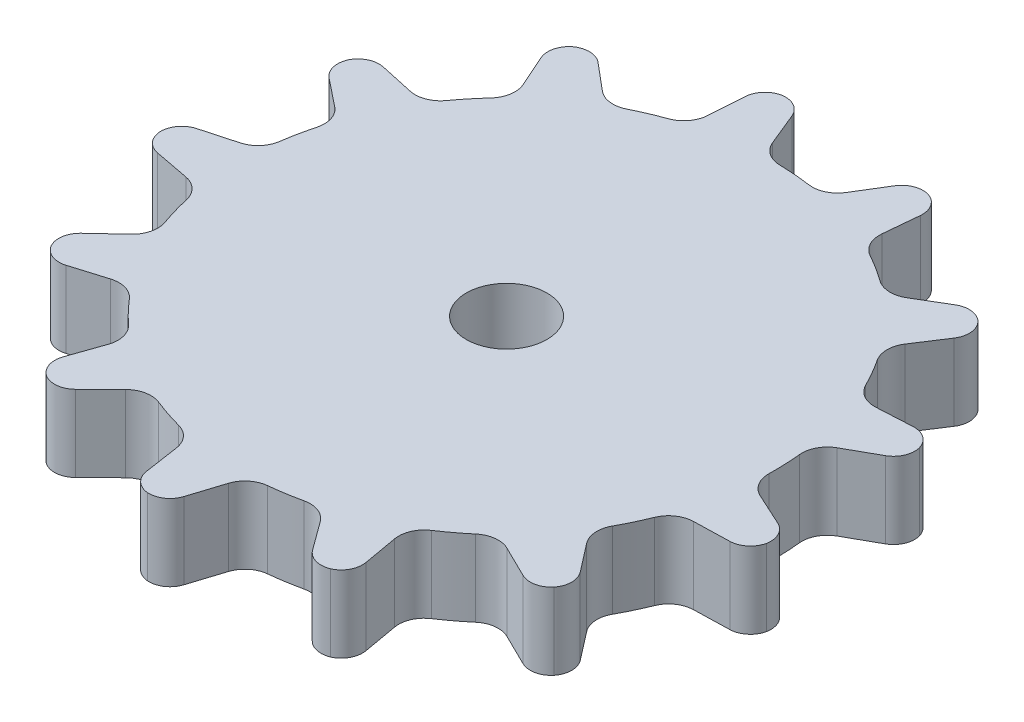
ISO-10303-21;
HEADER;
FILE_DESCRIPTION(('STEP AP214'),'2;1');
FILE_NAME('part.step','',(''),(''),'','','');
FILE_SCHEMA(('AUTOMOTIVE_DESIGN { 1 0 10303 214 1 1 1 1 }'));
ENDSEC;
DATA;
#1=APPLICATION_CONTEXT('core data for automotive mechanical design processes');
#2=APPLICATION_PROTOCOL_DEFINITION('international standard','automotive_design',2000,#1);
#3=PRODUCT_CONTEXT('',#1,'mechanical');
#4=PRODUCT('Part','Part','',(#3));
#5=PRODUCT_RELATED_PRODUCT_CATEGORY('part','',(#4));
#6=PRODUCT_DEFINITION_FORMATION('','',#4);
#7=PRODUCT_DEFINITION_CONTEXT('part definition',#1,'design');
#8=PRODUCT_DEFINITION('design','',#6,#7);
#9=PRODUCT_DEFINITION_SHAPE('','',#8);
#10=(LENGTH_UNIT() NAMED_UNIT(*) SI_UNIT(.MILLI.,.METRE.));
#11=(NAMED_UNIT(*) PLANE_ANGLE_UNIT() SI_UNIT($,.RADIAN.));
#12=(NAMED_UNIT(*) SI_UNIT($,.STERADIAN.) SOLID_ANGLE_UNIT());
#13=UNCERTAINTY_MEASURE_WITH_UNIT(LENGTH_MEASURE(1.E-05),#10,'distance_accuracy_value','');
#14=(GEOMETRIC_REPRESENTATION_CONTEXT(3) GLOBAL_UNCERTAINTY_ASSIGNED_CONTEXT((#13)) GLOBAL_UNIT_ASSIGNED_CONTEXT((#10,
#11,#12)) REPRESENTATION_CONTEXT('',''));
#15=CARTESIAN_POINT('',(0.,0.,0.));
#16=DIRECTION('',(0.,0.,1.));
#17=DIRECTION('',(1.,0.,0.));
#18=AXIS2_PLACEMENT_3D('',#15,#16,#17);
#19=CARTESIAN_POINT('',(-6.24500451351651E-13,9.,65.));
#20=DIRECTION('',(0.,1.,0.));
#21=DIRECTION('',(0.866025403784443,0.,-0.499999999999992));
#22=AXIS2_PLACEMENT_3D('',#19,#20,#21);
#23=PLANE('',#22);
#24=CARTESIAN_POINT('',(-6.24500451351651E-13,9.,65.));
#25=DIRECTION('',(0.,1.,0.));
#26=DIRECTION('',(0.866025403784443,0.,-0.499999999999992));
#27=AXIS2_PLACEMENT_3D('',#24,#25,#26);
#28=CIRCLE('',#27,4.75);
#29=CARTESIAN_POINT('',(4.11362066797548,9.,62.6250000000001));
#30=VERTEX_POINT('',#29);
#31=EDGE_CURVE('E1309',#30,#30,#28,.T.);
#32=ORIENTED_EDGE('',*,*,#31,.F.);
#33=EDGE_LOOP('',(#32));
#34=FACE_BOUND('',#33,.T.);
#35=CARTESIAN_POINT('',(-19.6057024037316,9.,96.0834189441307));
#36=DIRECTION('',(0.,1.,0.));
#37=DIRECTION('',(0.866025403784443,0.,-0.499999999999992));
#38=AXIS2_PLACEMENT_3D('',#35,#36,#37);
#39=CIRCLE('',#38,2.5);
#40=CARTESIAN_POINT('',(-21.9662014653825,9.,95.2599845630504));
#41=VERTEX_POINT('',#40);
#42=CARTESIAN_POINT('',(-20.977577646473,9.,98.1733850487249));
#43=VERTEX_POINT('',#42);
#44=EDGE_CURVE('E1221',#41,#43,#39,.T.);
#45=ORIENTED_EDGE('',*,*,#44,.T.);
#46=CARTESIAN_POINT('',(-19.677509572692,9.,96.0380108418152));
#47=DIRECTION('',(0.,1.,0.));
#48=DIRECTION('',(0.866025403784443,0.,-0.499999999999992));
#49=AXIS2_PLACEMENT_3D('',#46,#47,#48);
#50=CIRCLE('',#49,2.5);
#51=CARTESIAN_POINT('',(-17.9216490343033,9.,97.8176045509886));
#52=VERTEX_POINT('',#51);
#53=EDGE_CURVE('E1225',#43,#52,#50,.T.);
#54=ORIENTED_EDGE('',*,*,#53,.T.);
#55=DIRECTION('',(-0.711837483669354,0.,0.702344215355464));
#56=VECTOR('',#55,1.);
#57=CARTESIAN_POINT('',(-19.2996791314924,9.,99.1772568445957));
#58=LINE('',#57,#56);
#59=CARTESIAN_POINT('',(-14.9495209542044,9.,94.8851136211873));
#60=VERTEX_POINT('',#59);
#61=EDGE_CURVE('E612',#60,#52,#58,.T.);
#62=ORIENTED_EDGE('',*,*,#61,.F.);
#63=CARTESIAN_POINT('',(-12.842488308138,9.,97.0206260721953));
#64=DIRECTION('',(0.,1.,0.));
#65=DIRECTION('',(-0.53446582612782,0.,0.845190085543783));
#66=AXIS2_PLACEMENT_3D('',#63,#64,#65);
#67=CIRCLE('',#66,2.99999999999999);
#68=CARTESIAN_POINT('',(-11.7257501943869,9.,94.2362238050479));
#69=VERTEX_POINT('',#68);
#70=EDGE_CURVE('E1063',#69,#60,#67,.T.);
#71=ORIENTED_EDGE('',*,*,#70,.F.);
#72=CARTESIAN_POINT('',(-6.48786580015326E-13,9.,65.));
#73=DIRECTION('',(0.,-1.,0.));
#74=DIRECTION('',(0.0804665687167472,0.,-0.996757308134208));
#75=AXIS2_PLACEMENT_3D('',#72,#73,#74);
#76=CIRCLE('',#75,31.5);
#77=CARTESIAN_POINT('',(-8.18936914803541,9.,95.4168412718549));
#78=VERTEX_POINT('',#77);
#79=EDGE_CURVE('E601',#78,#69,#76,.T.);
#80=ORIENTED_EDGE('',*,*,#79,.F.);
#81=CARTESIAN_POINT('',(-8.96930906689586,9.,98.3136832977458));
#82=DIRECTION('',(0.,1.,0.));
#83=DIRECTION('',(0.0804665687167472,0.,-0.996757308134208));
#84=AXIS2_PLACEMENT_3D('',#81,#82,#83);
#85=CIRCLE('',#84,3.);
#86=CARTESIAN_POINT('',(-6.00196448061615,9.,97.8722468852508));
#87=VERTEX_POINT('',#86);
#88=EDGE_CURVE('E628',#87,#78,#85,.T.);
#89=ORIENTED_EDGE('',*,*,#88,.F.);
#90=DIRECTION('',(-0.147145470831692,0.,-0.989114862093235));
#91=VECTOR('',#90,1.);
#92=CARTESIAN_POINT('',(-5.102733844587,9.,103.916893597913));
#93=LINE('',#92,#91);
#94=CARTESIAN_POINT('',(-5.38758943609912,9.,102.002088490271));
#95=VERTEX_POINT('',#94);
#96=EDGE_CURVE('E626',#95,#87,#93,.T.);
#97=ORIENTED_EDGE('',*,*,#96,.F.);
#98=CARTESIAN_POINT('',(-2.91480228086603,9.,101.634224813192));
#99=DIRECTION('',(0.,1.,0.));
#100=DIRECTION('',(0.866025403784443,0.,-0.499999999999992));
#101=AXIS2_PLACEMENT_3D('',#98,#99,#100);
#102=CIRCLE('',#101,2.5);
#103=CARTESIAN_POINT('',(-3.15828180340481,9.,104.122340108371));
#104=VERTEX_POINT('',#103);
#105=EDGE_CURVE('E1205',#95,#104,#102,.T.);
#106=ORIENTED_EDGE('',*,*,#105,.T.);
#107=CARTESIAN_POINT('',(-2.99948656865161,9.,101.627388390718));
#108=DIRECTION('',(0.,1.,0.));
#109=DIRECTION('',(0.866025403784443,0.,-0.499999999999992));
#110=AXIS2_PLACEMENT_3D('',#107,#108,#109);
#111=CIRCLE('',#110,2.5);
#112=CARTESIAN_POINT('',(-0.617730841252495,9.,102.387151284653));
#113=VERTEX_POINT('',#112);
#114=EDGE_CURVE('E1210',#104,#113,#111,.T.);
#115=ORIENTED_EDGE('',*,*,#114,.T.);
#116=DIRECTION('',(-0.303905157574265,0.,0.952702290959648));
#117=VECTOR('',#116,1.);
#118=CARTESIAN_POINT('',(-1.20605396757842,9.,104.231466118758));
#119=LINE('',#118,#117);
#120=CARTESIAN_POINT('',(0.651161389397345,9.,98.4093427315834));
#121=VERTEX_POINT('',#120);
#122=EDGE_CURVE('E1249',#121,#113,#119,.T.);
#123=ORIENTED_EDGE('',*,*,#122,.F.);
#124=CARTESIAN_POINT('',(3.50926826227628,9.,99.3210582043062));
#125=DIRECTION('',(0.,1.,0.));
#126=DIRECTION('',(-0.0804665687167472,0.,0.996757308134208));
#127=AXIS2_PLACEMENT_3D('',#124,#125,#126);
#128=CIRCLE('',#127,2.99999999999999);
#129=CARTESIAN_POINT('',(3.20411450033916,9.,96.3366183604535));
#130=VERTEX_POINT('',#129);
#131=EDGE_CURVE('E1253',#130,#121,#128,.T.);
#132=ORIENTED_EDGE('',*,*,#131,.F.);
#133=CARTESIAN_POINT('',(-6.52256026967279E-13,9.,65.));
#134=DIRECTION('',(0.,-1.,0.));
#135=DIRECTION('',(-0.391966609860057,0.,-0.919979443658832));
#136=AXIS2_PLACEMENT_3D('',#133,#134,#135);
#137=CIRCLE('',#136,31.5);
#138=CARTESIAN_POINT('',(6.88408470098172,9.,95.7385649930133));
#139=VERTEX_POINT('',#138);
#140=EDGE_CURVE('E657',#139,#130,#137,.T.);
#141=ORIENTED_EDGE('',*,*,#140,.F.);
#142=CARTESIAN_POINT('',(7.53971181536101,9.,98.6660473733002));
#143=DIRECTION('',(0.,1.,0.));
#144=DIRECTION('',(-0.391966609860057,0.,-0.919979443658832));
#145=AXIS2_PLACEMENT_3D('',#142,#143,#144);
#146=CIRCLE('',#145,3.);
#147=CARTESIAN_POINT('',(9.96201922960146,9.,96.8961810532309));
#148=VERTEX_POINT('',#147);
#149=EDGE_CURVE('E666',#148,#139,#146,.T.);
#150=ORIENTED_EDGE('',*,*,#149,.F.);
#151=DIRECTION('',(-0.589955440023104,0.,-0.80743580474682));
#152=VECTOR('',#151,1.);
#153=CARTESIAN_POINT('',(13.567335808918,9.,101.830556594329));
#154=LINE('',#153,#152);
#155=CARTESIAN_POINT('',(12.4252544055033,9.,100.267459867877));
#156=VERTEX_POINT('',#155);
#157=EDGE_CURVE('E664',#156,#148,#154,.T.);
#158=ORIENTED_EDGE('',*,*,#157,.F.);
#159=CARTESIAN_POINT('',(14.4438439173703,9.,98.792571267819));
#160=DIRECTION('',(0.,1.,0.));
#161=DIRECTION('',(0.866025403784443,0.,-0.499999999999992));
#162=AXIS2_PLACEMENT_3D('',#159,#160,#161);
#163=CIRCLE('',#162,2.5);
#164=CARTESIAN_POINT('',(15.3845383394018,9.,101.108838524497));
#165=VERTEX_POINT('',#164);
#166=EDGE_CURVE('E1189',#156,#165,#163,.T.);
#167=ORIENTED_EDGE('',*,*,#166,.T.);
#168=CARTESIAN_POINT('',(14.365682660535,9.,98.8258726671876));
#169=DIRECTION('',(0.,1.,0.));
#170=DIRECTION('',(0.866025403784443,0.,-0.499999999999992));
#171=AXIS2_PLACEMENT_3D('',#168,#169,#170);
#172=CIRCLE('',#171,2.5);
#173=CARTESIAN_POINT('',(16.8277020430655,9.,98.3917522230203));
#174=VERTEX_POINT('',#173);
#175=EDGE_CURVE('E1194',#165,#174,#172,.T.);
#176=ORIENTED_EDGE('',*,*,#175,.T.);
#177=DIRECTION('',(0.173648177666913,0.,0.984807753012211));
#178=VECTOR('',#177,1.);
#179=CARTESIAN_POINT('',(17.1638636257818,9.,100.298219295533));
#180=LINE('',#179,#178);
#181=CARTESIAN_POINT('',(16.1026705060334,9.,94.2798940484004));
#182=VERTEX_POINT('',#181);
#183=EDGE_CURVE('E1280',#182,#174,#180,.T.);
#184=ORIENTED_EDGE('',*,*,#183,.F.);
#185=CARTESIAN_POINT('',(19.0570937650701,9.,93.7589495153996));
#186=DIRECTION('',(0.,1.,0.));
#187=DIRECTION('',(0.391966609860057,0.,0.919979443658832));
#188=AXIS2_PLACEMENT_3D('',#185,#186,#187);
#189=CIRCLE('',#188,2.99999999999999);
#190=CARTESIAN_POINT('',(17.399955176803,9.,91.2581712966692));
#191=VERTEX_POINT('',#190);
#192=EDGE_CURVE('E633',#191,#182,#189,.T.);
#193=ORIENTED_EDGE('',*,*,#192,.F.);
#194=CARTESIAN_POINT('',(-6.55725473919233E-13,9.,65.));
#195=DIRECTION('',(0.,-1.,0.));
#196=DIRECTION('',(-0.774604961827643,0.,-0.632445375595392));
#197=AXIS2_PLACEMENT_3D('',#194,#195,#196);
#198=CIRCLE('',#197,31.5);
#199=CARTESIAN_POINT('',(20.380477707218,9.,89.0184539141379));
#200=VERTEX_POINT('',#199);
#201=EDGE_CURVE('E696',#200,#191,#198,.T.);
#202=ORIENTED_EDGE('',*,*,#201,.F.);
#203=CARTESIAN_POINT('',(22.3214755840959,9.,91.3059257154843));
#204=DIRECTION('',(0.,1.,0.));
#205=DIRECTION('',(-0.774604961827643,0.,-0.632445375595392));
#206=AXIS2_PLACEMENT_3D('',#203,#204,#205);
#207=CIRCLE('',#206,3.);
#208=CARTESIAN_POINT('',(23.6438243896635,9.,88.6130845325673));
#209=VERTEX_POINT('',#208);
#210=EDGE_CURVE('E704',#209,#200,#207,.T.);
#211=ORIENTED_EDGE('',*,*,#210,.F.);
#212=DIRECTION('',(-0.897613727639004,0.,-0.440782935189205));
#213=VECTOR('',#212,1.);
#214=CARTESIAN_POINT('',(29.1292923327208,9.,91.306782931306));
#215=LINE('',#214,#213);
#216=CARTESIAN_POINT('',(27.3916222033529,9.,90.4534812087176));
#217=VERTEX_POINT('',#216);
#218=EDGE_CURVE('E651',#217,#209,#215,.T.);
#219=ORIENTED_EDGE('',*,*,#218,.F.);
#220=CARTESIAN_POINT('',(28.493579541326,9.,88.2094468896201));
#221=DIRECTION('',(0.,1.,0.));
#222=DIRECTION('',(0.866025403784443,0.,-0.499999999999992));
#223=AXIS2_PLACEMENT_3D('',#220,#221,#222);
#224=CIRCLE('',#223,2.5);
#225=CARTESIAN_POINT('',(30.4029461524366,9.,89.8232371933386));
#226=VERTEX_POINT('',#225);
#227=EDGE_CURVE('E1173',#217,#226,#224,.T.);
#228=ORIENTED_EDGE('',*,*,#227,.T.);
#229=CARTESIAN_POINT('',(28.4398471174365,9.,88.2752571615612));
#230=DIRECTION('',(0.,1.,0.));
#231=DIRECTION('',(0.866025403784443,0.,-0.499999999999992));
#232=AXIS2_PLACEMENT_3D('',#229,#230,#231);
#233=CIRCLE('',#232,2.5);
#234=CARTESIAN_POINT('',(30.4181111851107,9.,86.7467051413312));
#235=VERTEX_POINT('',#234);
#236=EDGE_CURVE('E1178',#226,#235,#233,.T.);
#237=ORIENTED_EDGE('',*,*,#236,.T.);
#238=DIRECTION('',(0.611420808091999,0.,0.791305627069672));
#239=VECTOR('',#238,1.);
#240=CARTESIAN_POINT('',(31.6017469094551,9.,88.2785758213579));
#241=LINE('',#240,#239);
#242=CARTESIAN_POINT('',(27.8652518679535,9.,83.4427744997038));
#243=VERTEX_POINT('',#242);
#244=EDGE_CURVE('E639',#243,#235,#241,.T.);
#245=ORIENTED_EDGE('',*,*,#244,.F.);
#246=CARTESIAN_POINT('',(30.2391687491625,9.,81.6085120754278));
#247=DIRECTION('',(0.,1.,0.));
#248=DIRECTION('',(0.774604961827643,0.,0.632445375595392));
#249=AXIS2_PLACEMENT_3D('',#246,#247,#248);
#250=CIRCLE('',#249,2.99999999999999);
#251=CARTESIAN_POINT('',(27.6096758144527,9.,80.1642936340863));
#252=VERTEX_POINT('',#251);
#253=EDGE_CURVE('E643',#252,#243,#250,.T.);
#254=ORIENTED_EDGE('',*,*,#253,.F.);
#255=CARTESIAN_POINT('',(-6.48786580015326E-13,9.,65.));
#256=DIRECTION('',(0.,-1.,0.));
#257=DIRECTION('',(-0.979790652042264,0.,-0.200025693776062));
#258=AXIS2_PLACEMENT_3D('',#255,#256,#257);
#259=CIRCLE('',#258,31.5);
#260=CARTESIAN_POINT('',(29.2079488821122,9.,76.7960044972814));
#261=VERTEX_POINT('',#260);
#262=EDGE_CURVE('E733',#261,#252,#259,.T.);
#263=ORIENTED_EDGE('',*,*,#262,.F.);
#264=CARTESIAN_POINT('',(31.9896582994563,9.,77.9194334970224));
#265=DIRECTION('',(0.,1.,0.));
#266=DIRECTION('',(-0.979790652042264,0.,-0.200025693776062));
#267=AXIS2_PLACEMENT_3D('',#264,#265,#266);
#268=CIRCLE('',#267,3.);
#269=CARTESIAN_POINT('',(31.9091143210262,9.,74.9205149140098));
#270=VERTEX_POINT('',#269);
#271=EDGE_CURVE('E741',#270,#261,#268,.T.);
#272=ORIENTED_EDGE('',*,*,#271,.F.);
#273=DIRECTION('',(-0.999639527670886,0.,0.0268479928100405));
#274=VECTOR('',#273,1.);
#275=CARTESIAN_POINT('',(38.0180790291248,9.,74.7564423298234));
#276=LINE('',#275,#274);
#277=CARTESIAN_POINT('',(36.0828994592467,9.,74.8084167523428));
#278=VERTEX_POINT('',#277);
#279=EDGE_CURVE('E690',#278,#270,#276,.T.);
#280=ORIENTED_EDGE('',*,*,#279,.F.);
#281=CARTESIAN_POINT('',(36.0157794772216,9.,72.3093179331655));
#282=DIRECTION('',(0.,1.,0.));
#283=DIRECTION('',(0.866025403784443,0.,-0.499999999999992));
#284=AXIS2_PLACEMENT_3D('',#281,#282,#283);
#285=CIRCLE('',#284,2.5);
#286=CARTESIAN_POINT('',(38.4564053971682,9.,72.8509313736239));
#287=VERTEX_POINT('',#286);
#288=EDGE_CURVE('E1157',#278,#287,#285,.T.);
#289=ORIENTED_EDGE('',*,*,#288,.T.);
#290=CARTESIAN_POINT('',(35.9987853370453,9.,72.3925607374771));
#291=DIRECTION('',(0.,1.,0.));
#292=DIRECTION('',(0.866025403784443,0.,-0.499999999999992));
#293=AXIS2_PLACEMENT_3D('',#290,#291,#292);
#294=CIRCLE('',#293,2.5);
#295=CARTESIAN_POINT('',(37.0400976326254,9.,70.1197499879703));
#296=VERTEX_POINT('',#295);
#297=EDGE_CURVE('E1162',#287,#296,#294,.T.);
#298=ORIENTED_EDGE('',*,*,#297,.T.);
#299=DIRECTION('',(0.909124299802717,0.,0.416524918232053));
#300=VECTOR('',#299,1.);
#301=CARTESIAN_POINT('',(38.8000508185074,9.,70.9260911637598));
#302=LINE('',#301,#300);
#303=CARTESIAN_POINT('',(33.244239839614,9.,68.3806375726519));
#304=VERTEX_POINT('',#303);
#305=EDGE_CURVE('E678',#304,#296,#302,.T.);
#306=ORIENTED_EDGE('',*,*,#305,.F.);
#307=CARTESIAN_POINT('',(34.4938145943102,9.,65.6532646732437));
#308=DIRECTION('',(0.,1.,0.));
#309=DIRECTION('',(0.979790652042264,0.,0.200025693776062));
#310=AXIS2_PLACEMENT_3D('',#307,#308,#309);
#311=CIRCLE('',#310,2.99999999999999);
#312=CARTESIAN_POINT('',(31.4943524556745,9.,65.5964590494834));
#313=VERTEX_POINT('',#312);
#314=EDGE_CURVE('E682',#313,#304,#311,.T.);
#315=ORIENTED_EDGE('',*,*,#314,.F.);
#316=CARTESIAN_POINT('',(-6.34908792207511E-13,9.,65.0000000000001));
#317=DIRECTION('',(0.,-1.,0.));
#318=DIRECTION('',(-0.960518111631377,0.,0.278217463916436));
#319=AXIS2_PLACEMENT_3D('',#316,#317,#318);
#320=CIRCLE('',#319,31.5);
#321=CARTESIAN_POINT('',(31.3442309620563,9.,61.8712326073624));
#322=VERTEX_POINT('',#321);
#323=EDGE_CURVE('E770',#322,#313,#320,.T.);
#324=ORIENTED_EDGE('',*,*,#323,.F.);
#325=CARTESIAN_POINT('',(34.3293958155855,9.,61.5732547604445));
#326=DIRECTION('',(0.,1.,0.));
#327=DIRECTION('',(-0.960518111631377,0.,0.278217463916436));
#328=AXIS2_PLACEMENT_3D('',#325,#326,#327);
#329=CIRCLE('',#328,3.);
#330=CARTESIAN_POINT('',(32.8644107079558,9.,58.9552748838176));
#331=VERTEX_POINT('',#330);
#332=EDGE_CURVE('E778',#331,#322,#329,.T.);
#333=ORIENTED_EDGE('',*,*,#332,.F.);
#334=DIRECTION('',(-0.872659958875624,0.,0.488328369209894));
#335=VECTOR('',#334,1.);
#336=CARTESIAN_POINT('',(38.1973819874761,9.,55.9710183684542));
#337=LINE('',#336,#335);
#338=CARTESIAN_POINT('',(36.5080192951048,9.,56.9163622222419));
#339=VERTEX_POINT('',#338);
#340=EDGE_CURVE('E727',#339,#331,#337,.T.);
#341=ORIENTED_EDGE('',*,*,#340,.F.);
#342=CARTESIAN_POINT('',(35.2871983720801,9.,54.7347123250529));
#343=DIRECTION('',(0.,1.,0.));
#344=DIRECTION('',(0.866025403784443,0.,-0.499999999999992));
#345=AXIS2_PLACEMENT_3D('',#342,#343,#344);
#346=CIRCLE('',#345,2.5);
#347=CARTESIAN_POINT('',(37.6999656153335,9.,54.0800717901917));
#348=VERTEX_POINT('',#347);
#349=EDGE_CURVE('E1141',#339,#348,#346,.T.);
#350=ORIENTED_EDGE('',*,*,#349,.T.);
#351=CARTESIAN_POINT('',(35.3108356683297,9.,54.8163177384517));
#352=DIRECTION('',(0.,1.,0.));
#353=DIRECTION('',(0.866025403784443,0.,-0.499999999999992));
#354=AXIS2_PLACEMENT_3D('',#351,#352,#353);
#355=CIRCLE('',#354,2.5);
#356=CARTESIAN_POINT('',(35.1766440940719,9.,52.3199218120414));
#357=VERTEX_POINT('',#356);
#358=EDGE_CURVE('E1146',#348,#357,#355,.T.);
#359=ORIENTED_EDGE('',*,*,#358,.T.);
#360=DIRECTION('',(0.998558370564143,0.,-0.0536766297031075));
#361=VECTOR('',#360,1.);
#362=CARTESIAN_POINT('',(37.1097306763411,9.,52.2160104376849));
#363=LINE('',#362,#361);
#364=CARTESIAN_POINT('',(31.0073731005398,9.,52.5440373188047));
#365=VERTEX_POINT('',#364);
#366=EDGE_CURVE('E715',#365,#357,#363,.T.);
#367=ORIENTED_EDGE('',*,*,#366,.F.);
#368=CARTESIAN_POINT('',(30.8463432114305,9.,49.5483622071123));
#369=DIRECTION('',(0.,1.,0.));
#370=DIRECTION('',(0.960518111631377,0.,-0.278217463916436));
#371=AXIS2_PLACEMENT_3D('',#368,#369,#370);
#372=CIRCLE('',#371,2.99999999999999);
#373=CARTESIAN_POINT('',(28.164052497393,9.,50.8919828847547));
#374=VERTEX_POINT('',#373);
#375=EDGE_CURVE('E719',#374,#365,#372,.T.);
#376=ORIENTED_EDGE('',*,*,#375,.F.);
#377=CARTESIAN_POINT('',(-6.24500451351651E-13,9.,65.0000000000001));
#378=DIRECTION('',(0.,-1.,0.));
#379=DIRECTION('',(-0.721202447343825,0.,0.692724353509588));
#380=AXIS2_PLACEMENT_3D('',#377,#378,#379);
#381=CIRCLE('',#380,31.5);
#382=CARTESIAN_POINT('',(26.2999274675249,9.,47.6632236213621));
#383=VERTEX_POINT('',#382);
#384=EDGE_CURVE('E807',#383,#374,#381,.T.);
#385=ORIENTED_EDGE('',*,*,#384,.F.);
#386=CARTESIAN_POINT('',(28.804682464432,9.,46.0121020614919));
#387=DIRECTION('',(0.,1.,0.));
#388=DIRECTION('',(-0.721202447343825,0.,0.692724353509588));
#389=AXIS2_PLACEMENT_3D('',#386,#387,#388);
#390=CIRCLE('',#389,3.);
#391=CARTESIAN_POINT('',(26.2908666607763,9.,44.3748085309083));
#392=VERTEX_POINT('',#391);
#393=EDGE_CURVE('E815',#392,#383,#390,.T.);
#394=ORIENTED_EDGE('',*,*,#393,.F.);
#395=DIRECTION('',(-0.54576451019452,0.,0.837938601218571));
#396=VECTOR('',#395,1.);
#397=CARTESIAN_POINT('',(29.6261250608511,9.,39.254025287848));
#398=LINE('',#397,#396);
#399=CARTESIAN_POINT('',(28.5695918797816,9.,40.8761716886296));
#400=VERTEX_POINT('',#399);
#401=EDGE_CURVE('E764',#400,#392,#398,.T.);
#402=ORIENTED_EDGE('',*,*,#401,.F.);
#403=CARTESIAN_POINT('',(26.4747453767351,9.,39.5117604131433));
#404=DIRECTION('',(0.,1.,0.));
#405=DIRECTION('',(0.866025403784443,0.,-0.499999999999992));
#406=AXIS2_PLACEMENT_3D('',#403,#404,#405);
#407=CIRCLE('',#406,2.5);
#408=CARTESIAN_POINT('',(28.3069180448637,9.,37.8108361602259));
#409=VERTEX_POINT('',#408);
#410=EDGE_CURVE('E1125',#400,#409,#407,.T.);
#411=ORIENTED_EDGE('',*,*,#410,.T.);
#412=CARTESIAN_POINT('',(26.5335990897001,9.,39.5730336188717));
#413=DIRECTION('',(0.,1.,0.));
#414=DIRECTION('',(0.866025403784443,0.,-0.499999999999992));
#415=AXIS2_PLACEMENT_3D('',#412,#413,#414);
#416=CIRCLE('',#415,2.5);
#417=CARTESIAN_POINT('',(25.2546453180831,9.,37.4249467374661));
#418=VERTEX_POINT('',#417);
#419=EDGE_CURVE('E1130',#409,#418,#416,.T.);
#420=ORIENTED_EDGE('',*,*,#419,.T.);
#421=DIRECTION('',(0.859234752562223,0.,-0.511581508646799));
#422=VECTOR('',#421,1.);
#423=CARTESIAN_POINT('',(26.9180184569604,9.,36.4345876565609));
#424=LINE('',#423,#422);
#425=CARTESIAN_POINT('',(21.6670908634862,9.,39.5609480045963));
#426=VERTEX_POINT('',#425);
#427=EDGE_CURVE('E752',#426,#418,#424,.T.);
#428=ORIENTED_EDGE('',*,*,#427,.F.);
#429=CARTESIAN_POINT('',(20.1323463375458,9.,36.9832437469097));
#430=DIRECTION('',(0.,1.,0.));
#431=DIRECTION('',(0.721202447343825,0.,-0.692724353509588));
#432=AXIS2_PLACEMENT_3D('',#429,#430,#431);
#433=CIRCLE('',#432,2.99999999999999);
#434=CARTESIAN_POINT('',(18.3817075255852,9.,39.4194834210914));
#435=VERTEX_POINT('',#434);
#436=EDGE_CURVE('E756',#435,#426,#433,.T.);
#437=ORIENTED_EDGE('',*,*,#436,.F.);
#438=CARTESIAN_POINT('',(-6.10622663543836E-13,9.,65.));
#439=DIRECTION('',(0.,-1.,0.));
#440=DIRECTION('',(-0.316667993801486,0.,0.948536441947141));
#441=AXIS2_PLACEMENT_3D('',#438,#439,#440);
#442=CIRCLE('',#441,31.5);
#443=CARTESIAN_POINT('',(15.2306275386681,9.,37.4268611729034));
#444=VERTEX_POINT('',#443);
#445=EDGE_CURVE('E844',#444,#435,#442,.T.);
#446=ORIENTED_EDGE('',*,*,#445,.F.);
#447=CARTESIAN_POINT('',(16.6811634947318,9.,34.8008479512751));
#448=DIRECTION('',(0.,1.,0.));
#449=DIRECTION('',(-0.316667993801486,0.,0.948536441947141));
#450=AXIS2_PLACEMENT_3D('',#447,#448,#449);
#451=CIRCLE('',#450,3.);
#452=CARTESIAN_POINT('',(13.694401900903,9.,34.5193249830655));
#453=VERTEX_POINT('',#452);
#454=EDGE_CURVE('E852',#453,#444,#451,.T.);
#455=ORIENTED_EDGE('',*,*,#454,.F.);
#456=DIRECTION('',(-0.0938409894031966,0.,0.995587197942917));
#457=VECTOR('',#456,1.);
#458=CARTESIAN_POINT('',(14.2678799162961,9.,28.4351247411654));
#459=LINE('',#458,#457);
#460=CARTESIAN_POINT('',(14.0862152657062,9.,30.3624594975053));
#461=VERTEX_POINT('',#460);
#462=EDGE_CURVE('E801',#461,#453,#459,.T.);
#463=ORIENTED_EDGE('',*,*,#462,.F.);
#464=CARTESIAN_POINT('',(11.5972472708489,9.,30.1278570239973));
#465=DIRECTION('',(0.,1.,0.));
#466=DIRECTION('',(0.866025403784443,0.,-0.499999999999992));
#467=AXIS2_PLACEMENT_3D('',#464,#465,#466);
#468=CIRCLE('',#467,2.5);
#469=CARTESIAN_POINT('',(12.429096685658,9.,27.7703103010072));
#470=VERTEX_POINT('',#469);
#471=EDGE_CURVE('E1109',#461,#470,#468,.T.);
#472=ORIENTED_EDGE('',*,*,#471,.T.);
#473=CARTESIAN_POINT('',(11.6778347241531,9.,30.1547610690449));
#474=DIRECTION('',(0.,1.,0.));
#475=DIRECTION('',(0.866025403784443,0.,-0.499999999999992));
#476=AXIS2_PLACEMENT_3D('',#473,#474,#475);
#477=CIRCLE('',#476,2.5);
#478=CARTESIAN_POINT('',(9.54711165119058,9.,28.847084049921));
#479=VERTEX_POINT('',#478);
#480=EDGE_CURVE('E1114',#470,#479,#477,.T.);
#481=ORIENTED_EDGE('',*,*,#480,.T.);
#482=DIRECTION('',(0.523070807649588,0.,-0.852289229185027));
#483=VECTOR('',#482,1.);
#484=CARTESIAN_POINT('',(10.5597126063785,9.,27.1971565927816));
#485=LINE('',#484,#483);
#486=CARTESIAN_POINT('',(7.363139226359,9.,32.4056389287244));
#487=VERTEX_POINT('',#486);
#488=EDGE_CURVE('E789',#487,#479,#485,.T.);
#489=ORIENTED_EDGE('',*,*,#488,.F.);
#490=CARTESIAN_POINT('',(4.80627153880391,9.,30.8364265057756));
#491=DIRECTION('',(0.,1.,0.));
#492=DIRECTION('',(0.316667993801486,0.,-0.948536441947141));
#493=AXIS2_PLACEMENT_3D('',#490,#491,#492);
#494=CIRCLE('',#493,2.99999999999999);
#495=CARTESIAN_POINT('',(4.38833488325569,9.,33.8071720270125));
#496=VERTEX_POINT('',#495);
#497=EDGE_CURVE('E793',#496,#487,#494,.T.);
#498=ORIENTED_EDGE('',*,*,#497,.F.);
#499=CARTESIAN_POINT('',(-6.00214322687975E-13,9.,65.));
#500=DIRECTION('',(0.,-1.,0.));
#501=DIRECTION('',(0.160411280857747,0.,0.987050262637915));
#502=AXIS2_PLACEMENT_3D('',#499,#500,#501);
#503=CIRCLE('',#502,31.5);
#504=CARTESIAN_POINT('',(0.672174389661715,9.,33.5071725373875));
#505=VERTEX_POINT('',#504);
#506=EDGE_CURVE('E881',#505,#496,#503,.T.);
#507=ORIENTED_EDGE('',*,*,#506,.F.);
#508=CARTESIAN_POINT('',(0.736190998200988,9.,30.5078556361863));
#509=DIRECTION('',(0.,1.,0.));
#510=DIRECTION('',(0.160411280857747,0.,0.987050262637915));
#511=AXIS2_PLACEMENT_3D('',#508,#509,#510);
#512=CIRCLE('',#511,3.);
#513=CARTESIAN_POINT('',(-2.03928529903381,9.,31.646596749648));
#514=VERTEX_POINT('',#513);
#515=EDGE_CURVE('E889',#514,#505,#512,.T.);
#516=ORIENTED_EDGE('',*,*,#515,.F.);
#517=DIRECTION('',(0.379580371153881,0.,0.92515876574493));
#518=VECTOR('',#517,1.);
#519=CARTESIAN_POINT('',(-4.35896457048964,9.,25.992796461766));
#520=LINE('',#519,#518);
#521=CARTESIAN_POINT('',(-3.62414350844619,9.,27.7837904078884));
#522=VERTEX_POINT('',#521);
#523=EDGE_CURVE('E838',#522,#514,#520,.T.);
#524=ORIENTED_EDGE('',*,*,#523,.F.);
#525=CARTESIAN_POINT('',(-5.93704042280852,9.,28.7327413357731));
#526=DIRECTION('',(0.,1.,0.));
#527=DIRECTION('',(0.866025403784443,0.,-0.499999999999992));
#528=AXIS2_PLACEMENT_3D('',#525,#526,#527);
#529=CIRCLE('',#528,2.5);
#530=CARTESIAN_POINT('',(-6.29608093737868,9.,26.2586576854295));
#531=VERTEX_POINT('',#530);
#532=EDGE_CURVE('E1093',#522,#531,#529,.T.);
#533=ORIENTED_EDGE('',*,*,#532,.T.);
#534=CARTESIAN_POINT('',(-5.85318084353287,9.,28.7191128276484));
#535=DIRECTION('',(0.,1.,0.));
#536=DIRECTION('',(0.866025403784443,0.,-0.499999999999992));
#537=AXIS2_PLACEMENT_3D('',#534,#535,#536);
#538=CIRCLE('',#537,2.5);
#539=CARTESIAN_POINT('',(-8.34755023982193,9.,28.5514187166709));
#540=VERTEX_POINT('',#539);
#541=EDGE_CURVE('E1098',#531,#540,#538,.T.);
#542=ORIENTED_EDGE('',*,*,#541,.T.);
#543=DIRECTION('',(0.0670776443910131,0.,-0.997747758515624));
#544=VECTOR('',#543,1.);
#545=CARTESIAN_POINT('',(-8.21769614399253,9.,26.6199013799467));
#546=LINE('',#545,#544);
#547=CARTESIAN_POINT('',(-8.62761887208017,9.,32.7173051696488));
#548=VERTEX_POINT('',#547);
#549=EDGE_CURVE('E826',#548,#540,#546,.T.);
#550=ORIENTED_EDGE('',*,*,#549,.F.);
#551=CARTESIAN_POINT('',(-11.620862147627,9.,32.5160722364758));
#552=DIRECTION('',(0.,1.,0.));
#553=DIRECTION('',(-0.160411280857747,0.,-0.987050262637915));
#554=AXIS2_PLACEMENT_3D('',#551,#552,#553);
#555=CIRCLE('',#554,2.99999999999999);
#556=CARTESIAN_POINT('',(-10.6103523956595,9.,35.340761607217));
#557=VERTEX_POINT('',#556);
#558=EDGE_CURVE('E830',#557,#548,#555,.T.);
#559=ORIENTED_EDGE('',*,*,#558,.F.);
#560=CARTESIAN_POINT('',(-6.00214322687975E-13,9.,65.));
#561=DIRECTION('',(0.,-1.,0.));
#562=DIRECTION('',(0.600742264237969,0.,0.799442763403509));
#563=AXIS2_PLACEMENT_3D('',#560,#561,#562);
#564=CIRCLE('',#563,31.5);
#565=CARTESIAN_POINT('',(-14.0402658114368,9.,36.8021111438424));
#566=VERTEX_POINT('',#565);
#567=EDGE_CURVE('E918',#566,#557,#564,.T.);
#568=ORIENTED_EDGE('',*,*,#567,.F.);
#569=CARTESIAN_POINT('',(-15.3774339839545,9.,34.1165979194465));
#570=DIRECTION('',(0.,1.,0.));
#571=DIRECTION('',(0.600742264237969,0.,0.799442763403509));
#572=AXIS2_PLACEMENT_3D('',#569,#570,#571);
#573=CIRCLE('',#572,3.);
#574=CARTESIAN_POINT('',(-17.3057968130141,9.,36.4147312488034));
#575=VERTEX_POINT('',#574);
#576=EDGE_CURVE('E926',#575,#566,#573,.T.);
#577=ORIENTED_EDGE('',*,*,#576,.F.);
#578=DIRECTION('',(0.766044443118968,0.,0.642787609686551));
#579=VECTOR('',#578,1.);
#580=CARTESIAN_POINT('',(-21.9872228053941,9.,32.4865484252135));
#581=LINE('',#580,#579);
#582=CARTESIAN_POINT('',(-20.5042546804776,9.,33.7309064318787));
#583=VERTEX_POINT('',#582);
#584=EDGE_CURVE('E875',#583,#575,#581,.T.);
#585=ORIENTED_EDGE('',*,*,#584,.F.);
#586=CARTESIAN_POINT('',(-22.111223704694,9.,35.6460175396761));
#587=DIRECTION('',(0.,1.,0.));
#588=DIRECTION('',(0.866025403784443,0.,-0.499999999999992));
#589=AXIS2_PLACEMENT_3D('',#586,#587,#588);
#590=CIRCLE('',#589,2.5);
#591=CARTESIAN_POINT('',(-23.5789022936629,9.,33.6221797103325));
#592=VERTEX_POINT('',#591);
#593=EDGE_CURVE('E1077',#583,#592,#590,.T.);
#594=ORIENTED_EDGE('',*,*,#593,.T.);
#595=CARTESIAN_POINT('',(-22.0433032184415,9.,35.5949786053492));
#596=DIRECTION('',(0.,1.,0.));
#597=DIRECTION('',(0.866025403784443,0.,-0.499999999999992));
#598=AXIS2_PLACEMENT_3D('',#595,#596,#597);
#599=CIRCLE('',#598,2.5);
#600=CARTESIAN_POINT('',(-24.3298889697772,9.,36.60568410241));
#601=VERTEX_POINT('',#600);
#602=EDGE_CURVE('E1082',#592,#601,#599,.T.);
#603=ORIENTED_EDGE('',*,*,#602,.T.);
#604=DIRECTION('',(-0.404282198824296,0.,-0.914634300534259));
#605=VECTOR('',#604,1.);
#606=CARTESIAN_POINT('',(-25.1125297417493,9.,34.8350642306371));
#607=LINE('',#606,#605);
#608=CARTESIAN_POINT('',(-22.6418934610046,9.,40.4245477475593));
#609=VERTEX_POINT('',#608);
#610=EDGE_CURVE('E863',#609,#601,#607,.T.);
#611=ORIENTED_EDGE('',*,*,#610,.F.);
#612=CARTESIAN_POINT('',(-25.3857963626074,9.,41.6373943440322));
#613=DIRECTION('',(0.,1.,0.));
#614=DIRECTION('',(-0.600742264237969,0.,-0.799442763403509));
#615=AXIS2_PLACEMENT_3D('',#612,#613,#614);
#616=CIRCLE('',#615,2.99999999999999);
#617=CARTESIAN_POINT('',(-23.1783358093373,9.,43.6689252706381));
#618=VERTEX_POINT('',#617);
#619=EDGE_CURVE('E867',#618,#609,#616,.T.);
#620=ORIENTED_EDGE('',*,*,#619,.F.);
#621=CARTESIAN_POINT('',(-6.00214322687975E-13,9.,65.));
#622=DIRECTION('',(0.,-1.,0.));
#623=DIRECTION('',(0.903450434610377,0.,0.428692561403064));
#624=AXIS2_PLACEMENT_3D('',#621,#622,#623);
#625=CIRCLE('',#624,31.5);
#626=CARTESIAN_POINT('',(-25.5362503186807,9.,46.5568462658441));
#627=VERTEX_POINT('',#626);
#628=EDGE_CURVE('E955',#627,#618,#625,.T.);
#629=ORIENTED_EDGE('',*,*,#628,.F.);
#630=CARTESIAN_POINT('',(-27.968274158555,9.,44.8003554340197));
#631=DIRECTION('',(0.,1.,0.));
#632=DIRECTION('',(0.903450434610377,0.,0.428692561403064));
#633=AXIS2_PLACEMENT_3D('',#630,#631,#632);
#634=CIRCLE('',#633,3.);
#635=CARTESIAN_POINT('',(-28.6077588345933,9.,47.7314063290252));
#636=VERTEX_POINT('',#635);
#637=EDGE_CURVE('E963',#636,#627,#634,.T.);
#638=ORIENTED_EDGE('',*,*,#637,.F.);
#639=DIRECTION('',(0.977016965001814,0.,0.21316155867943));
#640=VECTOR('',#639,1.);
#641=CARTESIAN_POINT('',(-34.5784732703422,9.,46.4287403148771));
#642=LINE('',#641,#640);
#643=CARTESIAN_POINT('',(-32.6870882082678,9.,46.8413949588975));
#644=VERTEX_POINT('',#643);
#645=EDGE_CURVE('E912',#644,#636,#642,.T.);
#646=ORIENTED_EDGE('',*,*,#645,.F.);
#647=CARTESIAN_POINT('',(-33.2199921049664,9.,49.283937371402));
#648=DIRECTION('',(0.,1.,0.));
#649=DIRECTION('',(0.866025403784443,0.,-0.499999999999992));
#650=AXIS2_PLACEMENT_3D('',#647,#648,#649);
#651=CIRCLE('',#650,2.5);
#652=CARTESIAN_POINT('',(-35.4600812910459,9.,48.1739822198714));
#653=VERTEX_POINT('',#652);
#654=EDGE_CURVE('E1059',#644,#653,#651,.T.);
#655=ORIENTED_EDGE('',*,*,#654,.T.);
#656=CARTESIAN_POINT('',(-33.1835704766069,9.,49.2071804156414));
#657=DIRECTION('',(0.,1.,0.));
#658=DIRECTION('',(0.866025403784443,0.,-0.499999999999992));
#659=AXIS2_PLACEMENT_3D('',#656,#657,#658);
#660=CIRCLE('',#659,2.5);
#661=CARTESIAN_POINT('',(-34.7385433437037,9.,51.1647450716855));
#662=VERTEX_POINT('',#661);
#663=EDGE_CURVE('E1066',#653,#662,#660,.T.);
#664=ORIENTED_EDGE('',*,*,#663,.T.);
#665=DIRECTION('',(-0.783025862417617,0.,-0.621989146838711));
#666=VECTOR('',#665,1.);
#667=CARTESIAN_POINT('',(-36.2543854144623,9.,49.9606503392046));
#668=LINE('',#667,#666);
#669=CARTESIAN_POINT('',(-31.469183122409,9.,53.7617302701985));
#670=VERTEX_POINT('',#669);
#671=EDGE_CURVE('E900',#670,#662,#668,.T.);
#672=ORIENTED_EDGE('',*,*,#671,.F.);
#673=CARTESIAN_POINT('',(-33.3351505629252,9.,56.1108078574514));
#674=DIRECTION('',(0.,1.,0.));
#675=DIRECTION('',(-0.903450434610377,0.,-0.428692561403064));
#676=AXIS2_PLACEMENT_3D('',#673,#674,#675);
#677=CIRCLE('',#676,2.99999999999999);
#678=CARTESIAN_POINT('',(-30.436441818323,9.,56.8837810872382));
#679=VERTEX_POINT('',#678);
#680=EDGE_CURVE('E904',#679,#670,#677,.T.);
#681=ORIENTED_EDGE('',*,*,#680,.F.);
#682=CARTESIAN_POINT('',(-6.1409211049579E-13,9.,65.));
#683=DIRECTION('',(0.,-1.,0.));
#684=DIRECTION('',(0.99918899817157,0.,-0.0402659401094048));
#685=AXIS2_PLACEMENT_3D('',#682,#683,#684);
#686=CIRCLE('',#685,31.5);
#687=CARTESIAN_POINT('',(-31.1821876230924,9.,60.5366856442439));
#688=VERTEX_POINT('',#687);
#689=EDGE_CURVE('E973',#688,#679,#686,.T.);
#690=ORIENTED_EDGE('',*,*,#689,.F.);
#691=CARTESIAN_POINT('',(-34.1519197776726,9.,60.1116080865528));
#692=DIRECTION('',(0.,1.,0.));
#693=DIRECTION('',(0.99918899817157,0.,-0.0402659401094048));
#694=AXIS2_PLACEMENT_3D('',#691,#692,#693);
#695=CIRCLE('',#694,3.);
#696=CARTESIAN_POINT('',(-33.3560280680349,9.,63.0041081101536));
#697=VERTEX_POINT('',#696);
#698=EDGE_CURVE('E981',#697,#688,#695,.T.);
#699=ORIENTED_EDGE('',*,*,#698,.F.);
#700=DIRECTION('',(0.964166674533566,0.,-0.265297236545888));
#701=VECTOR('',#700,1.);
#702=CARTESIAN_POINT('',(-39.2482122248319,9.,64.6253839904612));
#703=LINE('',#702,#701);
#704=CARTESIAN_POINT('',(-37.3817037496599,9.,64.1118010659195));
#705=VERTEX_POINT('',#704);
#706=EDGE_CURVE('E949',#705,#697,#703,.T.);
#707=ORIENTED_EDGE('',*,*,#706,.F.);
#708=CARTESIAN_POINT('',(-36.7184606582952,9.,66.5222177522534));
#709=DIRECTION('',(0.,1.,0.));
#710=DIRECTION('',(0.866025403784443,0.,-0.499999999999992));
#711=AXIS2_PLACEMENT_3D('',#708,#709,#710);
#712=CIRCLE('',#711,2.5);
#713=CARTESIAN_POINT('',(-39.2177830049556,9.,66.5804226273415));
#714=VERTEX_POINT('',#713);
#715=EDGE_CURVE('E1044',#705,#714,#712,.T.);
#716=ORIENTED_EDGE('',*,*,#715,.T.);
#717=CARTESIAN_POINT('',(-36.7218816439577,9.,66.4373268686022));
#718=DIRECTION('',(0.,1.,0.));
#719=DIRECTION('',(0.866025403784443,0.,-0.499999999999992));
#720=AXIS2_PLACEMENT_3D('',#717,#718,#719);
#721=CIRCLE('',#720,2.5);
#722=CARTESIAN_POINT('',(-37.1890160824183,9.,68.8932962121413));
#723=VERTEX_POINT('',#722);
#724=EDGE_CURVE('E1048',#714,#723,#721,.T.);
#725=ORIENTED_EDGE('',*,*,#724,.T.);
#726=DIRECTION('',(-0.982387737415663,0.,-0.186853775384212));
#727=VECTOR('',#726,1.);
#728=CARTESIAN_POINT('',(-39.0907983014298,9.,68.5315702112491));
#729=LINE('',#728,#727);
#730=CARTESIAN_POINT('',(-33.0872621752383,9.,69.6734649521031));
#731=VERTEX_POINT('',#730);
#732=EDGE_CURVE('E937',#731,#723,#729,.T.);
#733=ORIENTED_EDGE('',*,*,#732,.F.);
#734=CARTESIAN_POINT('',(-33.6478235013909,9.,72.6206281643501));
#735=DIRECTION('',(0.,1.,0.));
#736=DIRECTION('',(-0.99918899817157,0.,0.0402659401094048));
#737=AXIS2_PLACEMENT_3D('',#734,#735,#736);
#738=CIRCLE('',#737,2.99999999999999);
#739=CARTESIAN_POINT('',(-30.7219258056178,9.,71.957964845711));
#740=VERTEX_POINT('',#739);
#741=EDGE_CURVE('E941',#740,#731,#738,.T.);
#742=ORIENTED_EDGE('',*,*,#741,.F.);
#743=CARTESIAN_POINT('',(-6.24500451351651E-13,9.,65.));
#744=DIRECTION('',(0.,-1.,0.));
#745=DIRECTION('',(0.866025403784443,0.,-0.499999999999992));
#746=AXIS2_PLACEMENT_3D('',#743,#744,#745);
#747=CIRCLE('',#746,31.5);
#748=CARTESIAN_POINT('',(-29.6846615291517,9.,75.5390165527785));
#749=VERTEX_POINT('',#748);
#750=EDGE_CURVE('E993',#749,#740,#747,.T.);
#751=ORIENTED_EDGE('',*,*,#750,.F.);
#752=CARTESIAN_POINT('',(-32.5117721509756,9.,76.5427324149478));
#753=DIRECTION('',(0.,1.,0.));
#754=DIRECTION('',(0.866025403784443,0.,-0.499999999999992));
#755=AXIS2_PLACEMENT_3D('',#752,#753,#754);
#756=CIRCLE('',#755,3.);
#757=CARTESIAN_POINT('',(-30.4628332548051,9.,78.734044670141));
#758=VERTEX_POINT('',#757);
#759=EDGE_CURVE('E1001',#758,#749,#756,.T.);
#760=ORIENTED_EDGE('',*,*,#759,.F.);
#761=DIRECTION('',(0.730437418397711,0.,-0.682979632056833));
#762=VECTOR('',#761,1.);
#763=CARTESIAN_POINT('',(-34.9266587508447,9.,82.9078476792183));
#764=LINE('',#763,#762);
#765=CARTESIAN_POINT('',(-33.5126214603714,9.,81.5856828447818));
#766=VERTEX_POINT('',#765);
#767=EDGE_CURVE('E999',#766,#758,#764,.T.);
#768=ORIENTED_EDGE('',*,*,#767,.F.);
#769=CARTESIAN_POINT('',(-31.8051723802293,9.,83.411776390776));
#770=DIRECTION('',(0.,1.,0.));
#771=DIRECTION('',(0.866025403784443,0.,-0.499999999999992));
#772=AXIS2_PLACEMENT_3D('',#769,#770,#771);
#773=CIRCLE('',#772,2.5);
#774=CARTESIAN_POINT('',(-33.99116325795,9.,84.6248072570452));
#775=VERTEX_POINT('',#774);
#776=EDGE_CURVE('E1008',#766,#775,#773,.T.);
#777=ORIENTED_EDGE('',*,*,#776,.T.);
#778=CARTESIAN_POINT('',(-31.8476522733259,9.,83.3381990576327));
#779=DIRECTION('',(0.,1.,0.));
#780=DIRECTION('',(0.866025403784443,0.,-0.499999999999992));
#781=AXIS2_PLACEMENT_3D('',#778,#779,#780);
#782=CIRCLE('',#781,2.5);
#783=CARTESIAN_POINT('',(-31.1199334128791,9.,85.7299401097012));
#784=VERTEX_POINT('',#783);
#785=EDGE_CURVE('E1033',#775,#784,#782,.T.);
#786=ORIENTED_EDGE('',*,*,#785,.T.);
#787=DIRECTION('',(-0.956696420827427,0.,0.291087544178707));
#788=VECTOR('',#787,1.);
#789=CARTESIAN_POINT('',(-32.9719803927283,9.,86.2934499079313));
#790=LINE('',#789,#788);
#791=CARTESIAN_POINT('',(-27.1254482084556,9.,84.5145651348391));
#792=VERTEX_POINT('',#791);
#793=EDGE_CURVE('E1015',#792,#784,#790,.T.);
#794=ORIENTED_EDGE('',*,*,#793,.F.);
#795=CARTESIAN_POINT('',(-26.2521855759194,9.,87.3846543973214));
#796=DIRECTION('',(0.,1.,0.));
#797=DIRECTION('',(-0.866025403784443,0.,0.499999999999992));
#798=AXIS2_PLACEMENT_3D('',#795,#796,#797);
#799=CIRCLE('',#798,2.99999999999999);
#800=CARTESIAN_POINT('',(-23.9693868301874,9.,85.4381627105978));
#801=VERTEX_POINT('',#800);
#802=EDGE_CURVE('E1025',#801,#792,#799,.T.);
#803=ORIENTED_EDGE('',*,*,#802,.F.);
#804=CARTESIAN_POINT('',(-6.24500451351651E-13,9.,65.));
#805=DIRECTION('',(0.,-1.,0.));
#806=DIRECTION('',(-0.866025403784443,0.,0.499999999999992));
#807=AXIS2_PLACEMENT_3D('',#804,#805,#806);
#808=CIRCLE('',#807,31.5);
#809=CARTESIAN_POINT('',(-21.3867372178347,9.,88.126985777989));
#810=VERTEX_POINT('',#809);
#811=EDGE_CURVE('E1022',#810,#801,#808,.T.);
#812=ORIENTED_EDGE('',*,*,#811,.F.);
#813=CARTESIAN_POINT('',(-23.4235693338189,9.,90.3295558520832));
#814=DIRECTION('',(0.,1.,0.));
#815=DIRECTION('',(0.53446582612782,0.,-0.845190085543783));
#816=AXIS2_PLACEMENT_3D('',#813,#814,#815);
#817=CIRCLE('',#816,3.);
#818=CARTESIAN_POINT('',(-20.5909704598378,9.,91.3176771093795));
#819=VERTEX_POINT('',#818);
#820=EDGE_CURVE('E1265',#819,#810,#817,.T.);
#821=ORIENTED_EDGE('',*,*,#820,.F.);
#822=DIRECTION('',(0.329373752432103,0.,-0.944199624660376));
#823=VECTOR('',#822,1.);
#824=CARTESIAN_POINT('',(-22.6038286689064,9.,97.087839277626));
#825=LINE('',#824,#823);
#826=EDGE_CURVE('E1243',#41,#819,#825,.T.);
#827=ORIENTED_EDGE('',*,*,#826,.F.);
#828=EDGE_LOOP('',(#45,#54,#62,#71,#80,#89,#97,#106,#115,#123,#132,#141,#150,#158,#167,#176,
#184,#193,#202,#211,#219,#228,#237,#245,#254,#263,#272,#280,#289,#298,#306,#315,#324,#333,#341,
#350,#359,#367,#376,#385,#394,#402,#411,#420,#428,#437,#446,#455,#463,#472,#481,#489,#498,#507,
#516,#524,#533,#542,#550,#559,#568,#577,#585,#594,#603,#611,#620,#629,#638,#646,#655,#664,#672,
#681,#690,#699,#707,#716,#725,#733,#742,#751,#760,#768,#777,#786,#794,#803,#812,#821,#827));
#829=FACE_BOUND('',#828,.T.);
#830=ADVANCED_FACE('F34',(#34,#829),#23,.T.);
#831=CARTESIAN_POINT('',(-6.24500451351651E-13,0.,65.));
#832=DIRECTION('',(0.,1.,0.));
#833=DIRECTION('',(0.866025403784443,0.,-0.499999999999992));
#834=AXIS2_PLACEMENT_3D('',#831,#832,#833);
#835=PLANE('',#834);
#836=CARTESIAN_POINT('',(-6.24500451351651E-13,0.,65.));
#837=DIRECTION('',(0.,1.,0.));
#838=DIRECTION('',(0.866025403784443,0.,-0.499999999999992));
#839=AXIS2_PLACEMENT_3D('',#836,#837,#838);
#840=CIRCLE('',#839,4.75);
#841=CARTESIAN_POINT('',(4.11362066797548,0.,62.6250000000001));
#842=VERTEX_POINT('',#841);
#843=EDGE_CURVE('E1307',#842,#842,#840,.T.);
#844=ORIENTED_EDGE('',*,*,#843,.T.);
#845=EDGE_LOOP('',(#844));
#846=FACE_BOUND('',#845,.T.);
#847=DIRECTION('',(-0.711837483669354,0.,0.702344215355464));
#848=VECTOR('',#847,1.);
#849=CARTESIAN_POINT('',(-19.2996791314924,0.,99.1772568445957));
#850=LINE('',#849,#848);
#851=CARTESIAN_POINT('',(-14.9495209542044,0.,94.8851136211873));
#852=VERTEX_POINT('',#851);
#853=CARTESIAN_POINT('',(-17.9216490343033,0.,97.8176045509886));
#854=VERTEX_POINT('',#853);
#855=EDGE_CURVE('E606',#852,#854,#850,.T.);
#856=ORIENTED_EDGE('',*,*,#855,.T.);
#857=CARTESIAN_POINT('',(-19.677509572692,0.,96.0380108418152));
#858=DIRECTION('',(0.,1.,0.));
#859=DIRECTION('',(0.866025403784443,0.,-0.499999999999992));
#860=AXIS2_PLACEMENT_3D('',#857,#858,#859);
#861=CIRCLE('',#860,2.5);
#862=CARTESIAN_POINT('',(-20.977577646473,0.,98.1733850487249));
#863=VERTEX_POINT('',#862);
#864=EDGE_CURVE('E43',#854,#863,#861,.F.);
#865=ORIENTED_EDGE('',*,*,#864,.T.);
#866=CARTESIAN_POINT('',(-19.6057024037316,0.,96.0834189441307));
#867=DIRECTION('',(0.,1.,0.));
#868=DIRECTION('',(0.866025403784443,0.,-0.499999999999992));
#869=AXIS2_PLACEMENT_3D('',#866,#867,#868);
#870=CIRCLE('',#869,2.5);
#871=CARTESIAN_POINT('',(-21.9662014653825,0.,95.2599845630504));
#872=VERTEX_POINT('',#871);
#873=EDGE_CURVE('E53',#863,#872,#870,.F.);
#874=ORIENTED_EDGE('',*,*,#873,.T.);
#875=DIRECTION('',(0.329373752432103,0.,-0.944199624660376));
#876=VECTOR('',#875,1.);
#877=CARTESIAN_POINT('',(-22.6038286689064,0.,97.087839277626));
#878=LINE('',#877,#876);
#879=CARTESIAN_POINT('',(-20.5909704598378,0.,91.3176771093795));
#880=VERTEX_POINT('',#879);
#881=EDGE_CURVE('E1262',#872,#880,#878,.T.);
#882=ORIENTED_EDGE('',*,*,#881,.T.);
#883=CARTESIAN_POINT('',(-23.4235693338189,0.,90.3295558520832));
#884=DIRECTION('',(0.,1.,0.));
#885=DIRECTION('',(0.53446582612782,0.,-0.845190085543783));
#886=AXIS2_PLACEMENT_3D('',#883,#884,#885);
#887=CIRCLE('',#886,3.);
#888=CARTESIAN_POINT('',(-21.3867372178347,0.,88.126985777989));
#889=VERTEX_POINT('',#888);
#890=EDGE_CURVE('E1264',#880,#889,#887,.T.);
#891=ORIENTED_EDGE('',*,*,#890,.T.);
#892=CARTESIAN_POINT('',(-6.24500451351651E-13,0.,65.));
#893=DIRECTION('',(0.,-1.,0.));
#894=DIRECTION('',(-0.866025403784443,0.,0.499999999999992));
#895=AXIS2_PLACEMENT_3D('',#892,#893,#894);
#896=CIRCLE('',#895,31.5);
#897=CARTESIAN_POINT('',(-23.9693868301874,0.,85.4381627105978));
#898=VERTEX_POINT('',#897);
#899=EDGE_CURVE('E1011',#889,#898,#896,.T.);
#900=ORIENTED_EDGE('',*,*,#899,.T.);
#901=CARTESIAN_POINT('',(-26.2521855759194,0.,87.3846543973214));
#902=DIRECTION('',(0.,1.,0.));
#903=DIRECTION('',(-0.866025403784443,0.,0.499999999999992));
#904=AXIS2_PLACEMENT_3D('',#901,#902,#903);
#905=CIRCLE('',#904,2.99999999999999);
#906=CARTESIAN_POINT('',(-27.1254482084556,0.,84.5145651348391));
#907=VERTEX_POINT('',#906);
#908=EDGE_CURVE('E1014',#898,#907,#905,.T.);
#909=ORIENTED_EDGE('',*,*,#908,.T.);
#910=DIRECTION('',(-0.956696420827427,0.,0.291087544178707));
#911=VECTOR('',#910,1.);
#912=CARTESIAN_POINT('',(-32.9719803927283,0.,86.2934499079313));
#913=LINE('',#912,#911);
#914=CARTESIAN_POINT('',(-31.1199334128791,0.,85.7299401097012));
#915=VERTEX_POINT('',#914);
#916=EDGE_CURVE('E1018',#907,#915,#913,.T.);
#917=ORIENTED_EDGE('',*,*,#916,.T.);
#918=CARTESIAN_POINT('',(-31.8476522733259,0.,83.3381990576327));
#919=DIRECTION('',(0.,1.,0.));
#920=DIRECTION('',(0.866025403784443,0.,-0.499999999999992));
#921=AXIS2_PLACEMENT_3D('',#918,#919,#920);
#922=CIRCLE('',#921,2.5);
#923=CARTESIAN_POINT('',(-33.99116325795,0.,84.6248072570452));
#924=VERTEX_POINT('',#923);
#925=EDGE_CURVE('E1040',#915,#924,#922,.F.);
#926=ORIENTED_EDGE('',*,*,#925,.T.);
#927=CARTESIAN_POINT('',(-31.8051723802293,0.,83.411776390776));
#928=DIRECTION('',(0.,1.,0.));
#929=DIRECTION('',(0.866025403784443,0.,-0.499999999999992));
#930=AXIS2_PLACEMENT_3D('',#927,#928,#929);
#931=CIRCLE('',#930,2.5);
#932=CARTESIAN_POINT('',(-33.5126214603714,0.,81.5856828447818));
#933=VERTEX_POINT('',#932);
#934=EDGE_CURVE('E1038',#924,#933,#931,.F.);
#935=ORIENTED_EDGE('',*,*,#934,.T.);
#936=DIRECTION('',(0.730437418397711,0.,-0.682979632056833));
#937=VECTOR('',#936,1.);
#938=CARTESIAN_POINT('',(-34.9266587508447,0.,82.9078476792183));
#939=LINE('',#938,#937);
#940=CARTESIAN_POINT('',(-30.4628332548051,0.,78.734044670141));
#941=VERTEX_POINT('',#940);
#942=EDGE_CURVE('E990',#933,#941,#939,.T.);
#943=ORIENTED_EDGE('',*,*,#942,.T.);
#944=CARTESIAN_POINT('',(-32.5117721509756,0.,76.5427324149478));
#945=DIRECTION('',(0.,1.,0.));
#946=DIRECTION('',(0.866025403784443,0.,-0.499999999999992));
#947=AXIS2_PLACEMENT_3D('',#944,#945,#946);
#948=CIRCLE('',#947,3.);
#949=CARTESIAN_POINT('',(-29.6846615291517,0.,75.5390165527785));
#950=VERTEX_POINT('',#949);
#951=EDGE_CURVE('E992',#941,#950,#948,.T.);
#952=ORIENTED_EDGE('',*,*,#951,.T.);
#953=CARTESIAN_POINT('',(-6.24500451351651E-13,0.,65.));
#954=DIRECTION('',(0.,-1.,0.));
#955=DIRECTION('',(0.866025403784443,0.,-0.499999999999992));
#956=AXIS2_PLACEMENT_3D('',#953,#954,#955);
#957=CIRCLE('',#956,31.5);
#958=CARTESIAN_POINT('',(-30.7219258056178,0.,71.957964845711));
#959=VERTEX_POINT('',#958);
#960=EDGE_CURVE('E996',#950,#959,#957,.T.);
#961=ORIENTED_EDGE('',*,*,#960,.T.);
#962=CARTESIAN_POINT('',(-33.6478235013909,0.,72.6206281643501));
#963=DIRECTION('',(0.,1.,0.));
#964=DIRECTION('',(-0.99918899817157,0.,0.0402659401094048));
#965=AXIS2_PLACEMENT_3D('',#962,#963,#964);
#966=CIRCLE('',#965,2.99999999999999);
#967=CARTESIAN_POINT('',(-33.0872621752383,0.,69.6734649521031));
#968=VERTEX_POINT('',#967);
#969=EDGE_CURVE('E933',#959,#968,#966,.T.);
#970=ORIENTED_EDGE('',*,*,#969,.T.);
#971=DIRECTION('',(-0.982387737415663,0.,-0.186853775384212));
#972=VECTOR('',#971,1.);
#973=CARTESIAN_POINT('',(-39.0907983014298,0.,68.5315702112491));
#974=LINE('',#973,#972);
#975=CARTESIAN_POINT('',(-37.1890160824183,0.,68.8932962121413));
#976=VERTEX_POINT('',#975);
#977=EDGE_CURVE('E936',#968,#976,#974,.T.);
#978=ORIENTED_EDGE('',*,*,#977,.T.);
#979=CARTESIAN_POINT('',(-36.7218816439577,0.,66.4373268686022));
#980=DIRECTION('',(0.,1.,0.));
#981=DIRECTION('',(0.866025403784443,0.,-0.499999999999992));
#982=AXIS2_PLACEMENT_3D('',#979,#980,#981);
#983=CIRCLE('',#982,2.5);
#984=CARTESIAN_POINT('',(-39.2177830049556,0.,66.5804226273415));
#985=VERTEX_POINT('',#984);
#986=EDGE_CURVE('E1055',#976,#985,#983,.F.);
#987=ORIENTED_EDGE('',*,*,#986,.T.);
#988=CARTESIAN_POINT('',(-36.7184606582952,0.,66.5222177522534));
#989=DIRECTION('',(0.,1.,0.));
#990=DIRECTION('',(0.866025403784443,0.,-0.499999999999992));
#991=AXIS2_PLACEMENT_3D('',#988,#989,#990);
#992=CIRCLE('',#991,2.5);
#993=CARTESIAN_POINT('',(-37.3817037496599,0.,64.1118010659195));
#994=VERTEX_POINT('',#993);
#995=EDGE_CURVE('E1053',#985,#994,#992,.F.);
#996=ORIENTED_EDGE('',*,*,#995,.T.);
#997=DIRECTION('',(0.964166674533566,0.,-0.265297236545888));
#998=VECTOR('',#997,1.);
#999=CARTESIAN_POINT('',(-39.2482122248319,0.,64.6253839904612));
#1000=LINE('',#999,#998);
#1001=CARTESIAN_POINT('',(-33.3560280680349,0.,63.0041081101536));
#1002=VERTEX_POINT('',#1001);
#1003=EDGE_CURVE('E970',#994,#1002,#1000,.T.);
#1004=ORIENTED_EDGE('',*,*,#1003,.T.);
#1005=CARTESIAN_POINT('',(-34.1519197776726,0.,60.1116080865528));
#1006=DIRECTION('',(0.,1.,0.));
#1007=DIRECTION('',(0.99918899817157,0.,-0.0402659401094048));
#1008=AXIS2_PLACEMENT_3D('',#1005,#1006,#1007);
#1009=CIRCLE('',#1008,3.);
#1010=CARTESIAN_POINT('',(-31.1821876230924,0.,60.5366856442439));
#1011=VERTEX_POINT('',#1010);
#1012=EDGE_CURVE('E972',#1002,#1011,#1009,.T.);
#1013=ORIENTED_EDGE('',*,*,#1012,.T.);
#1014=CARTESIAN_POINT('',(-6.1409211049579E-13,0.,65.));
#1015=DIRECTION('',(0.,-1.,0.));
#1016=DIRECTION('',(0.99918899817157,0.,-0.0402659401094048));
#1017=AXIS2_PLACEMENT_3D('',#1014,#1015,#1016);
#1018=CIRCLE('',#1017,31.5);
#1019=CARTESIAN_POINT('',(-30.436441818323,0.,56.8837810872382));
#1020=VERTEX_POINT('',#1019);
#1021=EDGE_CURVE('E976',#1011,#1020,#1018,.T.);
#1022=ORIENTED_EDGE('',*,*,#1021,.T.);
#1023=CARTESIAN_POINT('',(-33.3351505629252,0.,56.1108078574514));
#1024=DIRECTION('',(0.,1.,0.));
#1025=DIRECTION('',(-0.903450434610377,0.,-0.428692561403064));
#1026=AXIS2_PLACEMENT_3D('',#1023,#1024,#1025);
#1027=CIRCLE('',#1026,2.99999999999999);
#1028=CARTESIAN_POINT('',(-31.469183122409,0.,53.7617302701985));
#1029=VERTEX_POINT('',#1028);
#1030=EDGE_CURVE('E896',#1020,#1029,#1027,.T.);
#1031=ORIENTED_EDGE('',*,*,#1030,.T.);
#1032=DIRECTION('',(-0.783025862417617,0.,-0.621989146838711));
#1033=VECTOR('',#1032,1.);
#1034=CARTESIAN_POINT('',(-36.2543854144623,0.,49.9606503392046));
#1035=LINE('',#1034,#1033);
#1036=CARTESIAN_POINT('',(-34.7385433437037,0.,51.1647450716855));
#1037=VERTEX_POINT('',#1036);
#1038=EDGE_CURVE('E899',#1029,#1037,#1035,.T.);
#1039=ORIENTED_EDGE('',*,*,#1038,.T.);
#1040=CARTESIAN_POINT('',(-33.1835704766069,0.,49.2071804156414));
#1041=DIRECTION('',(0.,1.,0.));
#1042=DIRECTION('',(0.866025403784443,0.,-0.499999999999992));
#1043=AXIS2_PLACEMENT_3D('',#1040,#1041,#1042);
#1044=CIRCLE('',#1043,2.5);
#1045=CARTESIAN_POINT('',(-35.4600812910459,0.,48.1739822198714));
#1046=VERTEX_POINT('',#1045);
#1047=EDGE_CURVE('E1073',#1037,#1046,#1044,.F.);
#1048=ORIENTED_EDGE('',*,*,#1047,.T.);
#1049=CARTESIAN_POINT('',(-33.2199921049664,0.,49.283937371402));
#1050=DIRECTION('',(0.,1.,0.));
#1051=DIRECTION('',(0.866025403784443,0.,-0.499999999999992));
#1052=AXIS2_PLACEMENT_3D('',#1049,#1050,#1051);
#1053=CIRCLE('',#1052,2.5);
#1054=CARTESIAN_POINT('',(-32.6870882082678,0.,46.8413949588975));
#1055=VERTEX_POINT('',#1054);
#1056=EDGE_CURVE('E1071',#1046,#1055,#1053,.F.);
#1057=ORIENTED_EDGE('',*,*,#1056,.T.);
#1058=DIRECTION('',(0.977016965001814,0.,0.21316155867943));
#1059=VECTOR('',#1058,1.);
#1060=CARTESIAN_POINT('',(-34.5784732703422,0.,46.4287403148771));
#1061=LINE('',#1060,#1059);
#1062=CARTESIAN_POINT('',(-28.6077588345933,0.,47.7314063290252));
#1063=VERTEX_POINT('',#1062);
#1064=EDGE_CURVE('E952',#1055,#1063,#1061,.T.);
#1065=ORIENTED_EDGE('',*,*,#1064,.T.);
#1066=CARTESIAN_POINT('',(-27.968274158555,0.,44.8003554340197));
#1067=DIRECTION('',(0.,1.,0.));
#1068=DIRECTION('',(0.903450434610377,0.,0.428692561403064));
#1069=AXIS2_PLACEMENT_3D('',#1066,#1067,#1068);
#1070=CIRCLE('',#1069,3.);
#1071=CARTESIAN_POINT('',(-25.5362503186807,0.,46.5568462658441));
#1072=VERTEX_POINT('',#1071);
#1073=EDGE_CURVE('E954',#1063,#1072,#1070,.T.);
#1074=ORIENTED_EDGE('',*,*,#1073,.T.);
#1075=CARTESIAN_POINT('',(-6.00214322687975E-13,0.,65.));
#1076=DIRECTION('',(0.,-1.,0.));
#1077=DIRECTION('',(0.903450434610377,0.,0.428692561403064));
#1078=AXIS2_PLACEMENT_3D('',#1075,#1076,#1077);
#1079=CIRCLE('',#1078,31.5);
#1080=CARTESIAN_POINT('',(-23.1783358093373,0.,43.6689252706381));
#1081=VERTEX_POINT('',#1080);
#1082=EDGE_CURVE('E958',#1072,#1081,#1079,.T.);
#1083=ORIENTED_EDGE('',*,*,#1082,.T.);
#1084=CARTESIAN_POINT('',(-25.3857963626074,0.,41.6373943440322));
#1085=DIRECTION('',(0.,1.,0.));
#1086=DIRECTION('',(-0.600742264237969,0.,-0.799442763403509));
#1087=AXIS2_PLACEMENT_3D('',#1084,#1085,#1086);
#1088=CIRCLE('',#1087,2.99999999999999);
#1089=CARTESIAN_POINT('',(-22.6418934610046,0.,40.4245477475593));
#1090=VERTEX_POINT('',#1089);
#1091=EDGE_CURVE('E859',#1081,#1090,#1088,.T.);
#1092=ORIENTED_EDGE('',*,*,#1091,.T.);
#1093=DIRECTION('',(-0.404282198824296,0.,-0.914634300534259));
#1094=VECTOR('',#1093,1.);
#1095=CARTESIAN_POINT('',(-25.1125297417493,0.,34.8350642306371));
#1096=LINE('',#1095,#1094);
#1097=CARTESIAN_POINT('',(-24.3298889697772,0.,36.60568410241));
#1098=VERTEX_POINT('',#1097);
#1099=EDGE_CURVE('E862',#1090,#1098,#1096,.T.);
#1100=ORIENTED_EDGE('',*,*,#1099,.T.);
#1101=CARTESIAN_POINT('',(-22.0433032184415,0.,35.5949786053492));
#1102=DIRECTION('',(0.,1.,0.));
#1103=DIRECTION('',(0.866025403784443,0.,-0.499999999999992));
#1104=AXIS2_PLACEMENT_3D('',#1101,#1102,#1103);
#1105=CIRCLE('',#1104,2.5);
#1106=CARTESIAN_POINT('',(-23.5789022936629,0.,33.6221797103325));
#1107=VERTEX_POINT('',#1106);
#1108=EDGE_CURVE('E1089',#1098,#1107,#1105,.F.);
#1109=ORIENTED_EDGE('',*,*,#1108,.T.);
#1110=CARTESIAN_POINT('',(-22.111223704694,0.,35.6460175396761));
#1111=DIRECTION('',(0.,1.,0.));
#1112=DIRECTION('',(0.866025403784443,0.,-0.499999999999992));
#1113=AXIS2_PLACEMENT_3D('',#1110,#1111,#1112);
#1114=CIRCLE('',#1113,2.5);
#1115=CARTESIAN_POINT('',(-20.5042546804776,0.,33.7309064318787));
#1116=VERTEX_POINT('',#1115);
#1117=EDGE_CURVE('E1087',#1107,#1116,#1114,.F.);
#1118=ORIENTED_EDGE('',*,*,#1117,.T.);
#1119=DIRECTION('',(0.766044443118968,0.,0.642787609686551));
#1120=VECTOR('',#1119,1.);
#1121=CARTESIAN_POINT('',(-21.9872228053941,0.,32.4865484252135));
#1122=LINE('',#1121,#1120);
#1123=CARTESIAN_POINT('',(-17.3057968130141,0.,36.4147312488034));
#1124=VERTEX_POINT('',#1123);
#1125=EDGE_CURVE('E915',#1116,#1124,#1122,.T.);
#1126=ORIENTED_EDGE('',*,*,#1125,.T.);
#1127=CARTESIAN_POINT('',(-15.3774339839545,0.,34.1165979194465));
#1128=DIRECTION('',(0.,1.,0.));
#1129=DIRECTION('',(0.600742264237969,0.,0.799442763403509));
#1130=AXIS2_PLACEMENT_3D('',#1127,#1128,#1129);
#1131=CIRCLE('',#1130,3.);
#1132=CARTESIAN_POINT('',(-14.0402658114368,0.,36.8021111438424));
#1133=VERTEX_POINT('',#1132);
#1134=EDGE_CURVE('E917',#1124,#1133,#1131,.T.);
#1135=ORIENTED_EDGE('',*,*,#1134,.T.);
#1136=CARTESIAN_POINT('',(-6.00214322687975E-13,0.,65.));
#1137=DIRECTION('',(0.,-1.,0.));
#1138=DIRECTION('',(0.600742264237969,0.,0.799442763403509));
#1139=AXIS2_PLACEMENT_3D('',#1136,#1137,#1138);
#1140=CIRCLE('',#1139,31.5);
#1141=CARTESIAN_POINT('',(-10.6103523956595,0.,35.340761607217));
#1142=VERTEX_POINT('',#1141);
#1143=EDGE_CURVE('E921',#1133,#1142,#1140,.T.);
#1144=ORIENTED_EDGE('',*,*,#1143,.T.);
#1145=CARTESIAN_POINT('',(-11.620862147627,0.,32.5160722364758));
#1146=DIRECTION('',(0.,1.,0.));
#1147=DIRECTION('',(-0.160411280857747,0.,-0.987050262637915));
#1148=AXIS2_PLACEMENT_3D('',#1145,#1146,#1147);
#1149=CIRCLE('',#1148,2.99999999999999);
#1150=CARTESIAN_POINT('',(-8.62761887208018,0.,32.7173051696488));
#1151=VERTEX_POINT('',#1150);
#1152=EDGE_CURVE('E822',#1142,#1151,#1149,.T.);
#1153=ORIENTED_EDGE('',*,*,#1152,.T.);
#1154=DIRECTION('',(0.0670776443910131,0.,-0.997747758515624));
#1155=VECTOR('',#1154,1.);
#1156=CARTESIAN_POINT('',(-8.21769614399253,0.,26.6199013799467));
#1157=LINE('',#1156,#1155);
#1158=CARTESIAN_POINT('',(-8.34755023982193,0.,28.5514187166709));
#1159=VERTEX_POINT('',#1158);
#1160=EDGE_CURVE('E825',#1151,#1159,#1157,.T.);
#1161=ORIENTED_EDGE('',*,*,#1160,.T.);
#1162=CARTESIAN_POINT('',(-5.85318084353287,0.,28.7191128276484));
#1163=DIRECTION('',(0.,1.,0.));
#1164=DIRECTION('',(0.866025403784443,0.,-0.499999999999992));
#1165=AXIS2_PLACEMENT_3D('',#1162,#1163,#1164);
#1166=CIRCLE('',#1165,2.5);
#1167=CARTESIAN_POINT('',(-6.29608093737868,0.,26.2586576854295));
#1168=VERTEX_POINT('',#1167);
#1169=EDGE_CURVE('E1105',#1159,#1168,#1166,.F.);
#1170=ORIENTED_EDGE('',*,*,#1169,.T.);
#1171=CARTESIAN_POINT('',(-5.93704042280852,0.,28.7327413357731));
#1172=DIRECTION('',(0.,1.,0.));
#1173=DIRECTION('',(0.866025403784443,0.,-0.499999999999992));
#1174=AXIS2_PLACEMENT_3D('',#1171,#1172,#1173);
#1175=CIRCLE('',#1174,2.5);
#1176=CARTESIAN_POINT('',(-3.62414350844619,0.,27.7837904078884));
#1177=VERTEX_POINT('',#1176);
#1178=EDGE_CURVE('E1103',#1168,#1177,#1175,.F.);
#1179=ORIENTED_EDGE('',*,*,#1178,.T.);
#1180=DIRECTION('',(0.379580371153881,0.,0.92515876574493));
#1181=VECTOR('',#1180,1.);
#1182=CARTESIAN_POINT('',(-4.35896457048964,0.,25.992796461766));
#1183=LINE('',#1182,#1181);
#1184=CARTESIAN_POINT('',(-2.03928529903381,0.,31.646596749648));
#1185=VERTEX_POINT('',#1184);
#1186=EDGE_CURVE('E878',#1177,#1185,#1183,.T.);
#1187=ORIENTED_EDGE('',*,*,#1186,.T.);
#1188=CARTESIAN_POINT('',(0.736190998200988,0.,30.5078556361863));
#1189=DIRECTION('',(0.,1.,0.));
#1190=DIRECTION('',(0.160411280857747,0.,0.987050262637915));
#1191=AXIS2_PLACEMENT_3D('',#1188,#1189,#1190);
#1192=CIRCLE('',#1191,3.);
#1193=CARTESIAN_POINT('',(0.672174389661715,0.,33.5071725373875));
#1194=VERTEX_POINT('',#1193);
#1195=EDGE_CURVE('E880',#1185,#1194,#1192,.T.);
#1196=ORIENTED_EDGE('',*,*,#1195,.T.);
#1197=CARTESIAN_POINT('',(-6.00214322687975E-13,0.,65.));
#1198=DIRECTION('',(0.,-1.,0.));
#1199=DIRECTION('',(0.160411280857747,0.,0.987050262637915));
#1200=AXIS2_PLACEMENT_3D('',#1197,#1198,#1199);
#1201=CIRCLE('',#1200,31.5);
#1202=CARTESIAN_POINT('',(4.38833488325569,0.,33.8071720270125));
#1203=VERTEX_POINT('',#1202);
#1204=EDGE_CURVE('E884',#1194,#1203,#1201,.T.);
#1205=ORIENTED_EDGE('',*,*,#1204,.T.);
#1206=CARTESIAN_POINT('',(4.80627153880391,0.,30.8364265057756));
#1207=DIRECTION('',(0.,1.,0.));
#1208=DIRECTION('',(0.316667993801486,0.,-0.948536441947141));
#1209=AXIS2_PLACEMENT_3D('',#1206,#1207,#1208);
#1210=CIRCLE('',#1209,2.99999999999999);
#1211=CARTESIAN_POINT('',(7.36313922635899,0.,32.4056389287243));
#1212=VERTEX_POINT('',#1211);
#1213=EDGE_CURVE('E785',#1203,#1212,#1210,.T.);
#1214=ORIENTED_EDGE('',*,*,#1213,.T.);
#1215=DIRECTION('',(0.523070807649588,0.,-0.852289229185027));
#1216=VECTOR('',#1215,1.);
#1217=CARTESIAN_POINT('',(10.5597126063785,0.,27.1971565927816));
#1218=LINE('',#1217,#1216);
#1219=CARTESIAN_POINT('',(9.54711165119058,0.,28.847084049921));
#1220=VERTEX_POINT('',#1219);
#1221=EDGE_CURVE('E788',#1212,#1220,#1218,.T.);
#1222=ORIENTED_EDGE('',*,*,#1221,.T.);
#1223=CARTESIAN_POINT('',(11.6778347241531,0.,30.1547610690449));
#1224=DIRECTION('',(0.,1.,0.));
#1225=DIRECTION('',(0.866025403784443,0.,-0.499999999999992));
#1226=AXIS2_PLACEMENT_3D('',#1223,#1224,#1225);
#1227=CIRCLE('',#1226,2.5);
#1228=CARTESIAN_POINT('',(12.429096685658,0.,27.7703103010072));
#1229=VERTEX_POINT('',#1228);
#1230=EDGE_CURVE('E1121',#1220,#1229,#1227,.F.);
#1231=ORIENTED_EDGE('',*,*,#1230,.T.);
#1232=CARTESIAN_POINT('',(11.5972472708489,0.,30.1278570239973));
#1233=DIRECTION('',(0.,1.,0.));
#1234=DIRECTION('',(0.866025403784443,0.,-0.499999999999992));
#1235=AXIS2_PLACEMENT_3D('',#1232,#1233,#1234);
#1236=CIRCLE('',#1235,2.5);
#1237=CARTESIAN_POINT('',(14.0862152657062,0.,30.3624594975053));
#1238=VERTEX_POINT('',#1237);
#1239=EDGE_CURVE('E1119',#1229,#1238,#1236,.F.);
#1240=ORIENTED_EDGE('',*,*,#1239,.T.);
#1241=DIRECTION('',(-0.0938409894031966,0.,0.995587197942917));
#1242=VECTOR('',#1241,1.);
#1243=CARTESIAN_POINT('',(14.2678799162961,0.,28.4351247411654));
#1244=LINE('',#1243,#1242);
#1245=CARTESIAN_POINT('',(13.694401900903,0.,34.5193249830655));
#1246=VERTEX_POINT('',#1245);
#1247=EDGE_CURVE('E841',#1238,#1246,#1244,.T.);
#1248=ORIENTED_EDGE('',*,*,#1247,.T.);
#1249=CARTESIAN_POINT('',(16.6811634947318,0.,34.8008479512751));
#1250=DIRECTION('',(0.,1.,0.));
#1251=DIRECTION('',(-0.316667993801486,0.,0.948536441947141));
#1252=AXIS2_PLACEMENT_3D('',#1249,#1250,#1251);
#1253=CIRCLE('',#1252,3.);
#1254=CARTESIAN_POINT('',(15.2306275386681,0.,37.4268611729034));
#1255=VERTEX_POINT('',#1254);
#1256=EDGE_CURVE('E843',#1246,#1255,#1253,.T.);
#1257=ORIENTED_EDGE('',*,*,#1256,.T.);
#1258=CARTESIAN_POINT('',(-6.10622663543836E-13,0.,65.));
#1259=DIRECTION('',(0.,-1.,0.));
#1260=DIRECTION('',(-0.316667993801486,0.,0.948536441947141));
#1261=AXIS2_PLACEMENT_3D('',#1258,#1259,#1260);
#1262=CIRCLE('',#1261,31.5);
#1263=CARTESIAN_POINT('',(18.3817075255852,0.,39.4194834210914));
#1264=VERTEX_POINT('',#1263);
#1265=EDGE_CURVE('E847',#1255,#1264,#1262,.T.);
#1266=ORIENTED_EDGE('',*,*,#1265,.T.);
#1267=CARTESIAN_POINT('',(20.1323463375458,0.,36.9832437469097));
#1268=DIRECTION('',(0.,1.,0.));
#1269=DIRECTION('',(0.721202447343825,0.,-0.692724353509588));
#1270=AXIS2_PLACEMENT_3D('',#1267,#1268,#1269);
#1271=CIRCLE('',#1270,2.99999999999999);
#1272=CARTESIAN_POINT('',(21.6670908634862,0.,39.5609480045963));
#1273=VERTEX_POINT('',#1272);
#1274=EDGE_CURVE('E748',#1264,#1273,#1271,.T.);
#1275=ORIENTED_EDGE('',*,*,#1274,.T.);
#1276=DIRECTION('',(0.859234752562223,0.,-0.511581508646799));
#1277=VECTOR('',#1276,1.);
#1278=CARTESIAN_POINT('',(26.9180184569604,0.,36.4345876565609));
#1279=LINE('',#1278,#1277);
#1280=CARTESIAN_POINT('',(25.2546453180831,0.,37.4249467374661));
#1281=VERTEX_POINT('',#1280);
#1282=EDGE_CURVE('E751',#1273,#1281,#1279,.T.);
#1283=ORIENTED_EDGE('',*,*,#1282,.T.);
#1284=CARTESIAN_POINT('',(26.5335990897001,0.,39.5730336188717));
#1285=DIRECTION('',(0.,1.,0.));
#1286=DIRECTION('',(0.866025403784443,0.,-0.499999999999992));
#1287=AXIS2_PLACEMENT_3D('',#1284,#1285,#1286);
#1288=CIRCLE('',#1287,2.5);
#1289=CARTESIAN_POINT('',(28.3069180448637,0.,37.8108361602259));
#1290=VERTEX_POINT('',#1289);
#1291=EDGE_CURVE('E1137',#1281,#1290,#1288,.F.);
#1292=ORIENTED_EDGE('',*,*,#1291,.T.);
#1293=CARTESIAN_POINT('',(26.4747453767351,0.,39.5117604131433));
#1294=DIRECTION('',(0.,1.,0.));
#1295=DIRECTION('',(0.866025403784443,0.,-0.499999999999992));
#1296=AXIS2_PLACEMENT_3D('',#1293,#1294,#1295);
#1297=CIRCLE('',#1296,2.5);
#1298=CARTESIAN_POINT('',(28.5695918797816,0.,40.8761716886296));
#1299=VERTEX_POINT('',#1298);
#1300=EDGE_CURVE('E1135',#1290,#1299,#1297,.F.);
#1301=ORIENTED_EDGE('',*,*,#1300,.T.);
#1302=DIRECTION('',(-0.54576451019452,0.,0.837938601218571));
#1303=VECTOR('',#1302,1.);
#1304=CARTESIAN_POINT('',(29.6261250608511,0.,39.254025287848));
#1305=LINE('',#1304,#1303);
#1306=CARTESIAN_POINT('',(26.2908666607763,0.,44.3748085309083));
#1307=VERTEX_POINT('',#1306);
#1308=EDGE_CURVE('E804',#1299,#1307,#1305,.T.);
#1309=ORIENTED_EDGE('',*,*,#1308,.T.);
#1310=CARTESIAN_POINT('',(28.804682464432,0.,46.0121020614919));
#1311=DIRECTION('',(0.,1.,0.));
#1312=DIRECTION('',(-0.721202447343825,0.,0.692724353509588));
#1313=AXIS2_PLACEMENT_3D('',#1310,#1311,#1312);
#1314=CIRCLE('',#1313,3.);
#1315=CARTESIAN_POINT('',(26.2999274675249,0.,47.6632236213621));
#1316=VERTEX_POINT('',#1315);
#1317=EDGE_CURVE('E806',#1307,#1316,#1314,.T.);
#1318=ORIENTED_EDGE('',*,*,#1317,.T.);
#1319=CARTESIAN_POINT('',(-6.24500451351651E-13,0.,65.0000000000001));
#1320=DIRECTION('',(0.,-1.,0.));
#1321=DIRECTION('',(-0.721202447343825,0.,0.692724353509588));
#1322=AXIS2_PLACEMENT_3D('',#1319,#1320,#1321);
#1323=CIRCLE('',#1322,31.5);
#1324=CARTESIAN_POINT('',(28.164052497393,0.,50.8919828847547));
#1325=VERTEX_POINT('',#1324);
#1326=EDGE_CURVE('E810',#1316,#1325,#1323,.T.);
#1327=ORIENTED_EDGE('',*,*,#1326,.T.);
#1328=CARTESIAN_POINT('',(30.8463432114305,0.,49.5483622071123));
#1329=DIRECTION('',(0.,1.,0.));
#1330=DIRECTION('',(0.960518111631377,0.,-0.278217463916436));
#1331=AXIS2_PLACEMENT_3D('',#1328,#1329,#1330);
#1332=CIRCLE('',#1331,2.99999999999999);
#1333=CARTESIAN_POINT('',(31.0073731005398,0.,52.5440373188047));
#1334=VERTEX_POINT('',#1333);
#1335=EDGE_CURVE('E711',#1325,#1334,#1332,.T.);
#1336=ORIENTED_EDGE('',*,*,#1335,.T.);
#1337=DIRECTION('',(0.998558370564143,0.,-0.0536766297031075));
#1338=VECTOR('',#1337,1.);
#1339=CARTESIAN_POINT('',(37.1097306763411,0.,52.2160104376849));
#1340=LINE('',#1339,#1338);
#1341=CARTESIAN_POINT('',(35.1766440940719,0.,52.3199218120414));
#1342=VERTEX_POINT('',#1341);
#1343=EDGE_CURVE('E714',#1334,#1342,#1340,.T.);
#1344=ORIENTED_EDGE('',*,*,#1343,.T.);
#1345=CARTESIAN_POINT('',(35.3108356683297,0.,54.8163177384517));
#1346=DIRECTION('',(0.,1.,0.));
#1347=DIRECTION('',(0.866025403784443,0.,-0.499999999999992));
#1348=AXIS2_PLACEMENT_3D('',#1345,#1346,#1347);
#1349=CIRCLE('',#1348,2.5);
#1350=CARTESIAN_POINT('',(37.6999656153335,0.,54.0800717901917));
#1351=VERTEX_POINT('',#1350);
#1352=EDGE_CURVE('E1153',#1342,#1351,#1349,.F.);
#1353=ORIENTED_EDGE('',*,*,#1352,.T.);
#1354=CARTESIAN_POINT('',(35.2871983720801,0.,54.7347123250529));
#1355=DIRECTION('',(0.,1.,0.));
#1356=DIRECTION('',(0.866025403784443,0.,-0.499999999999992));
#1357=AXIS2_PLACEMENT_3D('',#1354,#1355,#1356);
#1358=CIRCLE('',#1357,2.5);
#1359=CARTESIAN_POINT('',(36.5080192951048,0.,56.9163622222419));
#1360=VERTEX_POINT('',#1359);
#1361=EDGE_CURVE('E1151',#1351,#1360,#1358,.F.);
#1362=ORIENTED_EDGE('',*,*,#1361,.T.);
#1363=DIRECTION('',(-0.872659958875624,0.,0.488328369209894));
#1364=VECTOR('',#1363,1.);
#1365=CARTESIAN_POINT('',(38.1973819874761,0.,55.9710183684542));
#1366=LINE('',#1365,#1364);
#1367=CARTESIAN_POINT('',(32.8644107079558,0.,58.9552748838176));
#1368=VERTEX_POINT('',#1367);
#1369=EDGE_CURVE('E767',#1360,#1368,#1366,.T.);
#1370=ORIENTED_EDGE('',*,*,#1369,.T.);
#1371=CARTESIAN_POINT('',(34.3293958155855,0.,61.5732547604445));
#1372=DIRECTION('',(0.,1.,0.));
#1373=DIRECTION('',(-0.960518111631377,0.,0.278217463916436));
#1374=AXIS2_PLACEMENT_3D('',#1371,#1372,#1373);
#1375=CIRCLE('',#1374,3.);
#1376=CARTESIAN_POINT('',(31.3442309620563,0.,61.8712326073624));
#1377=VERTEX_POINT('',#1376);
#1378=EDGE_CURVE('E769',#1368,#1377,#1375,.T.);
#1379=ORIENTED_EDGE('',*,*,#1378,.T.);
#1380=CARTESIAN_POINT('',(-6.34908792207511E-13,0.,65.0000000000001));
#1381=DIRECTION('',(0.,-1.,0.));
#1382=DIRECTION('',(-0.960518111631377,0.,0.278217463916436));
#1383=AXIS2_PLACEMENT_3D('',#1380,#1381,#1382);
#1384=CIRCLE('',#1383,31.5);
#1385=CARTESIAN_POINT('',(31.4943524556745,0.,65.5964590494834));
#1386=VERTEX_POINT('',#1385);
#1387=EDGE_CURVE('E773',#1377,#1386,#1384,.T.);
#1388=ORIENTED_EDGE('',*,*,#1387,.T.);
#1389=CARTESIAN_POINT('',(34.4938145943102,0.,65.6532646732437));
#1390=DIRECTION('',(0.,1.,0.));
#1391=DIRECTION('',(0.979790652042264,0.,0.200025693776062));
#1392=AXIS2_PLACEMENT_3D('',#1389,#1390,#1391);
#1393=CIRCLE('',#1392,2.99999999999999);
#1394=CARTESIAN_POINT('',(33.244239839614,0.,68.3806375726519));
#1395=VERTEX_POINT('',#1394);
#1396=EDGE_CURVE('E674',#1386,#1395,#1393,.T.);
#1397=ORIENTED_EDGE('',*,*,#1396,.T.);
#1398=DIRECTION('',(0.909124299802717,0.,0.416524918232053));
#1399=VECTOR('',#1398,1.);
#1400=CARTESIAN_POINT('',(38.8000508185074,0.,70.9260911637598));
#1401=LINE('',#1400,#1399);
#1402=CARTESIAN_POINT('',(37.0400976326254,0.,70.1197499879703));
#1403=VERTEX_POINT('',#1402);
#1404=EDGE_CURVE('E677',#1395,#1403,#1401,.T.);
#1405=ORIENTED_EDGE('',*,*,#1404,.T.);
#1406=CARTESIAN_POINT('',(35.9987853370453,0.,72.3925607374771));
#1407=DIRECTION('',(0.,1.,0.));
#1408=DIRECTION('',(0.866025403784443,0.,-0.499999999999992));
#1409=AXIS2_PLACEMENT_3D('',#1406,#1407,#1408);
#1410=CIRCLE('',#1409,2.5);
#1411=CARTESIAN_POINT('',(38.4564053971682,0.,72.8509313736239));
#1412=VERTEX_POINT('',#1411);
#1413=EDGE_CURVE('E1169',#1403,#1412,#1410,.F.);
#1414=ORIENTED_EDGE('',*,*,#1413,.T.);
#1415=CARTESIAN_POINT('',(36.0157794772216,0.,72.3093179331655));
#1416=DIRECTION('',(0.,1.,0.));
#1417=DIRECTION('',(0.866025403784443,0.,-0.499999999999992));
#1418=AXIS2_PLACEMENT_3D('',#1415,#1416,#1417);
#1419=CIRCLE('',#1418,2.5);
#1420=CARTESIAN_POINT('',(36.0828994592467,0.,74.8084167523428));
#1421=VERTEX_POINT('',#1420);
#1422=EDGE_CURVE('E1167',#1412,#1421,#1419,.F.);
#1423=ORIENTED_EDGE('',*,*,#1422,.T.);
#1424=DIRECTION('',(-0.999639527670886,0.,0.0268479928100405));
#1425=VECTOR('',#1424,1.);
#1426=CARTESIAN_POINT('',(38.0180790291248,0.,74.7564423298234));
#1427=LINE('',#1426,#1425);
#1428=CARTESIAN_POINT('',(31.9091143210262,0.,74.9205149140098));
#1429=VERTEX_POINT('',#1428);
#1430=EDGE_CURVE('E730',#1421,#1429,#1427,.T.);
#1431=ORIENTED_EDGE('',*,*,#1430,.T.);
#1432=CARTESIAN_POINT('',(31.9896582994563,0.,77.9194334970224));
#1433=DIRECTION('',(0.,1.,0.));
#1434=DIRECTION('',(-0.979790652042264,0.,-0.200025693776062));
#1435=AXIS2_PLACEMENT_3D('',#1432,#1433,#1434);
#1436=CIRCLE('',#1435,3.);
#1437=CARTESIAN_POINT('',(29.2079488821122,0.,76.7960044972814));
#1438=VERTEX_POINT('',#1437);
#1439=EDGE_CURVE('E732',#1429,#1438,#1436,.T.);
#1440=ORIENTED_EDGE('',*,*,#1439,.T.);
#1441=CARTESIAN_POINT('',(-6.48786580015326E-13,0.,65.));
#1442=DIRECTION('',(0.,-1.,0.));
#1443=DIRECTION('',(-0.979790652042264,0.,-0.200025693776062));
#1444=AXIS2_PLACEMENT_3D('',#1441,#1442,#1443);
#1445=CIRCLE('',#1444,31.5);
#1446=CARTESIAN_POINT('',(27.6096758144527,0.,80.1642936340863));
#1447=VERTEX_POINT('',#1446);
#1448=EDGE_CURVE('E736',#1438,#1447,#1445,.T.);
#1449=ORIENTED_EDGE('',*,*,#1448,.T.);
#1450=CARTESIAN_POINT('',(30.2391687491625,0.,81.6085120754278));
#1451=DIRECTION('',(0.,1.,0.));
#1452=DIRECTION('',(0.774604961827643,0.,0.632445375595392));
#1453=AXIS2_PLACEMENT_3D('',#1450,#1451,#1452);
#1454=CIRCLE('',#1453,2.99999999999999);
#1455=CARTESIAN_POINT('',(27.8652518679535,0.,83.4427744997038));
#1456=VERTEX_POINT('',#1455);
#1457=EDGE_CURVE('E635',#1447,#1456,#1454,.T.);
#1458=ORIENTED_EDGE('',*,*,#1457,.T.);
#1459=DIRECTION('',(0.611420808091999,0.,0.791305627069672));
#1460=VECTOR('',#1459,1.);
#1461=CARTESIAN_POINT('',(31.6017469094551,0.,88.2785758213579));
#1462=LINE('',#1461,#1460);
#1463=CARTESIAN_POINT('',(30.4181111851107,0.,86.7467051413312));
#1464=VERTEX_POINT('',#1463);
#1465=EDGE_CURVE('E638',#1456,#1464,#1462,.T.);
#1466=ORIENTED_EDGE('',*,*,#1465,.T.);
#1467=CARTESIAN_POINT('',(28.4398471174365,0.,88.2752571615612));
#1468=DIRECTION('',(0.,1.,0.));
#1469=DIRECTION('',(0.866025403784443,0.,-0.499999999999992));
#1470=AXIS2_PLACEMENT_3D('',#1467,#1468,#1469);
#1471=CIRCLE('',#1470,2.5);
#1472=CARTESIAN_POINT('',(30.4029461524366,0.,89.8232371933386));
#1473=VERTEX_POINT('',#1472);
#1474=EDGE_CURVE('E1185',#1464,#1473,#1471,.F.);
#1475=ORIENTED_EDGE('',*,*,#1474,.T.);
#1476=CARTESIAN_POINT('',(28.493579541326,0.,88.2094468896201));
#1477=DIRECTION('',(0.,1.,0.));
#1478=DIRECTION('',(0.866025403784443,0.,-0.499999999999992));
#1479=AXIS2_PLACEMENT_3D('',#1476,#1477,#1478);
#1480=CIRCLE('',#1479,2.5);
#1481=CARTESIAN_POINT('',(27.3916222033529,0.,90.4534812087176));
#1482=VERTEX_POINT('',#1481);
#1483=EDGE_CURVE('E1183',#1473,#1482,#1480,.F.);
#1484=ORIENTED_EDGE('',*,*,#1483,.T.);
#1485=DIRECTION('',(-0.897613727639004,0.,-0.440782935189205));
#1486=VECTOR('',#1485,1.);
#1487=CARTESIAN_POINT('',(29.1292923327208,0.,91.306782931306));
#1488=LINE('',#1487,#1486);
#1489=CARTESIAN_POINT('',(23.6438243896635,0.,88.6130845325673));
#1490=VERTEX_POINT('',#1489);
#1491=EDGE_CURVE('E693',#1482,#1490,#1488,.T.);
#1492=ORIENTED_EDGE('',*,*,#1491,.T.);
#1493=CARTESIAN_POINT('',(22.3214755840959,0.,91.3059257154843));
#1494=DIRECTION('',(0.,1.,0.));
#1495=DIRECTION('',(-0.774604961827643,0.,-0.632445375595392));
#1496=AXIS2_PLACEMENT_3D('',#1493,#1494,#1495);
#1497=CIRCLE('',#1496,3.);
#1498=CARTESIAN_POINT('',(20.380477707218,0.,89.0184539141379));
#1499=VERTEX_POINT('',#1498);
#1500=EDGE_CURVE('E695',#1490,#1499,#1497,.T.);
#1501=ORIENTED_EDGE('',*,*,#1500,.T.);
#1502=CARTESIAN_POINT('',(-6.55725473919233E-13,0.,65.));
#1503=DIRECTION('',(0.,-1.,0.));
#1504=DIRECTION('',(-0.774604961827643,0.,-0.632445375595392));
#1505=AXIS2_PLACEMENT_3D('',#1502,#1503,#1504);
#1506=CIRCLE('',#1505,31.5);
#1507=CARTESIAN_POINT('',(17.399955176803,0.,91.2581712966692));
#1508=VERTEX_POINT('',#1507);
#1509=EDGE_CURVE('E699',#1499,#1508,#1506,.T.);
#1510=ORIENTED_EDGE('',*,*,#1509,.T.);
#1511=CARTESIAN_POINT('',(19.0570937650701,0.,93.7589495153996));
#1512=DIRECTION('',(0.,1.,0.));
#1513=DIRECTION('',(0.391966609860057,0.,0.919979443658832));
#1514=AXIS2_PLACEMENT_3D('',#1511,#1512,#1513);
#1515=CIRCLE('',#1514,2.99999999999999);
#1516=CARTESIAN_POINT('',(16.1026705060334,0.,94.2798940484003));
#1517=VERTEX_POINT('',#1516);
#1518=EDGE_CURVE('E1276',#1508,#1517,#1515,.T.);
#1519=ORIENTED_EDGE('',*,*,#1518,.T.);
#1520=DIRECTION('',(0.173648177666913,0.,0.984807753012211));
#1521=VECTOR('',#1520,1.);
#1522=CARTESIAN_POINT('',(17.1638636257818,0.,100.298219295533));
#1523=LINE('',#1522,#1521);
#1524=CARTESIAN_POINT('',(16.8277020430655,0.,98.3917522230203));
#1525=VERTEX_POINT('',#1524);
#1526=EDGE_CURVE('E1279',#1517,#1525,#1523,.T.);
#1527=ORIENTED_EDGE('',*,*,#1526,.T.);
#1528=CARTESIAN_POINT('',(14.365682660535,0.,98.8258726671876));
#1529=DIRECTION('',(0.,1.,0.));
#1530=DIRECTION('',(0.866025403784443,0.,-0.499999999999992));
#1531=AXIS2_PLACEMENT_3D('',#1528,#1529,#1530);
#1532=CIRCLE('',#1531,2.5);
#1533=CARTESIAN_POINT('',(15.3845383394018,0.,101.108838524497));
#1534=VERTEX_POINT('',#1533);
#1535=EDGE_CURVE('E1201',#1525,#1534,#1532,.F.);
#1536=ORIENTED_EDGE('',*,*,#1535,.T.);
#1537=CARTESIAN_POINT('',(14.4438439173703,0.,98.792571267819));
#1538=DIRECTION('',(0.,1.,0.));
#1539=DIRECTION('',(0.866025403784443,0.,-0.499999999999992));
#1540=AXIS2_PLACEMENT_3D('',#1537,#1538,#1539);
#1541=CIRCLE('',#1540,2.5);
#1542=CARTESIAN_POINT('',(12.4252544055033,0.,100.267459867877));
#1543=VERTEX_POINT('',#1542);
#1544=EDGE_CURVE('E1199',#1534,#1543,#1541,.F.);
#1545=ORIENTED_EDGE('',*,*,#1544,.T.);
#1546=DIRECTION('',(-0.589955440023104,0.,-0.80743580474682));
#1547=VECTOR('',#1546,1.);
#1548=CARTESIAN_POINT('',(13.567335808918,0.,101.830556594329));
#1549=LINE('',#1548,#1547);
#1550=CARTESIAN_POINT('',(9.96201922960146,0.,96.8961810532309));
#1551=VERTEX_POINT('',#1550);
#1552=EDGE_CURVE('E654',#1543,#1551,#1549,.T.);
#1553=ORIENTED_EDGE('',*,*,#1552,.T.);
#1554=CARTESIAN_POINT('',(7.53971181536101,0.,98.6660473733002));
#1555=DIRECTION('',(0.,1.,0.));
#1556=DIRECTION('',(-0.391966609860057,0.,-0.919979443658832));
#1557=AXIS2_PLACEMENT_3D('',#1554,#1555,#1556);
#1558=CIRCLE('',#1557,3.);
#1559=CARTESIAN_POINT('',(6.88408470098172,0.,95.7385649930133));
#1560=VERTEX_POINT('',#1559);
#1561=EDGE_CURVE('E656',#1551,#1560,#1558,.T.);
#1562=ORIENTED_EDGE('',*,*,#1561,.T.);
#1563=CARTESIAN_POINT('',(-6.52256026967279E-13,0.,65.));
#1564=DIRECTION('',(0.,-1.,0.));
#1565=DIRECTION('',(-0.391966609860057,0.,-0.919979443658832));
#1566=AXIS2_PLACEMENT_3D('',#1563,#1564,#1565);
#1567=CIRCLE('',#1566,31.5);
#1568=CARTESIAN_POINT('',(3.20411450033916,0.,96.3366183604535));
#1569=VERTEX_POINT('',#1568);
#1570=EDGE_CURVE('E660',#1560,#1569,#1567,.T.);
#1571=ORIENTED_EDGE('',*,*,#1570,.T.);
#1572=CARTESIAN_POINT('',(3.50926826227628,0.,99.3210582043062));
#1573=DIRECTION('',(0.,1.,0.));
#1574=DIRECTION('',(-0.0804665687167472,0.,0.996757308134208));
#1575=AXIS2_PLACEMENT_3D('',#1572,#1573,#1574);
#1576=CIRCLE('',#1575,2.99999999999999);
#1577=CARTESIAN_POINT('',(0.651161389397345,0.,98.4093427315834));
#1578=VERTEX_POINT('',#1577);
#1579=EDGE_CURVE('E1245',#1569,#1578,#1576,.T.);
#1580=ORIENTED_EDGE('',*,*,#1579,.T.);
#1581=DIRECTION('',(-0.303905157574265,0.,0.952702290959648));
#1582=VECTOR('',#1581,1.);
#1583=CARTESIAN_POINT('',(-1.20605396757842,0.,104.231466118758));
#1584=LINE('',#1583,#1582);
#1585=CARTESIAN_POINT('',(-0.617730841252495,0.,102.387151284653));
#1586=VERTEX_POINT('',#1585);
#1587=EDGE_CURVE('E1248',#1578,#1586,#1584,.T.);
#1588=ORIENTED_EDGE('',*,*,#1587,.T.);
#1589=CARTESIAN_POINT('',(-2.99948656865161,0.,101.627388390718));
#1590=DIRECTION('',(0.,1.,0.));
#1591=DIRECTION('',(0.866025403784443,0.,-0.499999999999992));
#1592=AXIS2_PLACEMENT_3D('',#1589,#1590,#1591);
#1593=CIRCLE('',#1592,2.5);
#1594=CARTESIAN_POINT('',(-3.15828180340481,0.,104.122340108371));
#1595=VERTEX_POINT('',#1594);
#1596=EDGE_CURVE('E1217',#1586,#1595,#1593,.F.);
#1597=ORIENTED_EDGE('',*,*,#1596,.T.);
#1598=CARTESIAN_POINT('',(-2.91480228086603,0.,101.634224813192));
#1599=DIRECTION('',(0.,1.,0.));
#1600=DIRECTION('',(0.866025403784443,0.,-0.499999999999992));
#1601=AXIS2_PLACEMENT_3D('',#1598,#1599,#1600);
#1602=CIRCLE('',#1601,2.5);
#1603=CARTESIAN_POINT('',(-5.38758943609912,0.,102.002088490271));
#1604=VERTEX_POINT('',#1603);
#1605=EDGE_CURVE('E1215',#1595,#1604,#1602,.F.);
#1606=ORIENTED_EDGE('',*,*,#1605,.T.);
#1607=DIRECTION('',(-0.147145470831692,0.,-0.989114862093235));
#1608=VECTOR('',#1607,1.);
#1609=CARTESIAN_POINT('',(-5.102733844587,0.,103.916893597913));
#1610=LINE('',#1609,#1608);
#1611=CARTESIAN_POINT('',(-6.00196448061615,0.,97.8722468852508));
#1612=VERTEX_POINT('',#1611);
#1613=EDGE_CURVE('E622',#1604,#1612,#1610,.T.);
#1614=ORIENTED_EDGE('',*,*,#1613,.T.);
#1615=CARTESIAN_POINT('',(-8.96930906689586,0.,98.3136832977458));
#1616=DIRECTION('',(0.,1.,0.));
#1617=DIRECTION('',(0.0804665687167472,0.,-0.996757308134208));
#1618=AXIS2_PLACEMENT_3D('',#1615,#1616,#1617);
#1619=CIRCLE('',#1618,3.);
#1620=CARTESIAN_POINT('',(-8.18936914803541,0.,95.4168412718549));
#1621=VERTEX_POINT('',#1620);
#1622=EDGE_CURVE('E616',#1612,#1621,#1619,.T.);
#1623=ORIENTED_EDGE('',*,*,#1622,.T.);
#1624=CARTESIAN_POINT('',(-6.48786580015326E-13,0.,65.));
#1625=DIRECTION('',(0.,-1.,0.));
#1626=DIRECTION('',(0.0804665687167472,0.,-0.996757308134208));
#1627=AXIS2_PLACEMENT_3D('',#1624,#1625,#1626);
#1628=CIRCLE('',#1627,31.5);
#1629=CARTESIAN_POINT('',(-11.7257501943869,0.,94.2362238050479));
#1630=VERTEX_POINT('',#1629);
#1631=EDGE_CURVE('E598',#1621,#1630,#1628,.T.);
#1632=ORIENTED_EDGE('',*,*,#1631,.T.);
#1633=CARTESIAN_POINT('',(-12.842488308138,0.,97.0206260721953));
#1634=DIRECTION('',(0.,1.,0.));
#1635=DIRECTION('',(-0.53446582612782,0.,0.845190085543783));
#1636=AXIS2_PLACEMENT_3D('',#1633,#1634,#1635);
#1637=CIRCLE('',#1636,2.99999999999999);
#1638=EDGE_CURVE('E610',#1630,#852,#1637,.T.);
#1639=ORIENTED_EDGE('',*,*,#1638,.T.);
#1640=EDGE_LOOP('',(#856,#865,#874,#882,#891,#900,#909,#917,#926,#935,#943,#952,#961,#970,#978,
#987,#996,#1004,#1013,#1022,#1031,#1039,#1048,#1057,#1065,#1074,#1083,#1092,#1100,#1109,#1118,
#1126,#1135,#1144,#1153,#1161,#1170,#1179,#1187,#1196,#1205,#1214,#1222,#1231,#1240,#1248,#1257,
#1266,#1275,#1283,#1292,#1301,#1309,#1318,#1327,#1336,#1344,#1353,#1362,#1370,#1379,#1388,#1397,
#1405,#1414,#1423,#1431,#1440,#1449,#1458,#1466,#1475,#1484,#1492,#1501,#1510,#1519,#1527,#1536,
#1545,#1553,#1562,#1571,#1580,#1588,#1597,#1606,#1614,#1623,#1632,#1639));
#1641=FACE_BOUND('',#1640,.T.);
#1642=ADVANCED_FACE('F614',(#846,#1641),#835,.F.);
#1643=CARTESIAN_POINT('',(-6.24500451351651E-13,0.,65.));
#1644=DIRECTION('',(0.,1.,0.));
#1645=DIRECTION('',(0.866025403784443,0.,-0.499999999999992));
#1646=AXIS2_PLACEMENT_3D('',#1643,#1644,#1645);
#1647=CYLINDRICAL_SURFACE('',#1646,31.5);
#1648=ORIENTED_EDGE('',*,*,#811,.T.);
#1649=DIRECTION('',(0.,1.,0.));
#1650=VECTOR('',#1649,1.);
#1651=CARTESIAN_POINT('',(-23.9693868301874,0.,85.4381627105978));
#1652=LINE('',#1651,#1650);
#1653=EDGE_CURVE('E1021',#898,#801,#1652,.T.);
#1654=ORIENTED_EDGE('',*,*,#1653,.F.);
#1655=ORIENTED_EDGE('',*,*,#899,.F.);
#1656=DIRECTION('',(0.,1.,0.));
#1657=VECTOR('',#1656,1.);
#1658=CARTESIAN_POINT('',(-21.3867372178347,0.,88.126985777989));
#1659=LINE('',#1658,#1657);
#1660=EDGE_CURVE('E1256',#889,#810,#1659,.T.);
#1661=ORIENTED_EDGE('',*,*,#1660,.T.);
#1662=EDGE_LOOP('',(#1648,#1654,#1655,#1661));
#1663=FACE_BOUND('',#1662,.T.);
#1664=ADVANCED_FACE('F1323',(#1663),#1647,.T.);
#1665=CARTESIAN_POINT('',(-32.9719803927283,0.,86.2934499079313));
#1666=DIRECTION('',(-0.291087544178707,0.,-0.956696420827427));
#1667=DIRECTION('',(-0.956696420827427,0.,0.291087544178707));
#1668=AXIS2_PLACEMENT_3D('',#1665,#1666,#1667);
#1669=PLANE('',#1668);
#1670=ORIENTED_EDGE('',*,*,#793,.T.);
#1671=DIRECTION('',(0.,-1.,0.));
#1672=VECTOR('',#1671,1.);
#1673=CARTESIAN_POINT('',(-31.1199334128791,0.,85.7299401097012));
#1674=LINE('',#1673,#1672);
#1675=EDGE_CURVE('E1035',#784,#915,#1674,.T.);
#1676=ORIENTED_EDGE('',*,*,#1675,.T.);
#1677=ORIENTED_EDGE('',*,*,#916,.F.);
#1678=DIRECTION('',(0.,1.,0.));
#1679=VECTOR('',#1678,1.);
#1680=CARTESIAN_POINT('',(-27.1254482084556,0.,84.5145651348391));
#1681=LINE('',#1680,#1679);
#1682=EDGE_CURVE('E1002',#907,#792,#1681,.T.);
#1683=ORIENTED_EDGE('',*,*,#1682,.T.);
#1684=EDGE_LOOP('',(#1670,#1676,#1677,#1683));
#1685=FACE_BOUND('',#1684,.T.);
#1686=ADVANCED_FACE('F1452',(#1685),#1669,.F.);
#1687=CARTESIAN_POINT('',(-26.2521855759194,0.,87.3846543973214));
#1688=DIRECTION('',(0.,1.,0.));
#1689=DIRECTION('',(0.866025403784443,0.,-0.499999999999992));
#1690=AXIS2_PLACEMENT_3D('',#1687,#1688,#1689);
#1691=CYLINDRICAL_SURFACE('',#1690,2.99999999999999);
#1692=ORIENTED_EDGE('',*,*,#802,.T.);
#1693=ORIENTED_EDGE('',*,*,#1682,.F.);
#1694=ORIENTED_EDGE('',*,*,#908,.F.);
#1695=ORIENTED_EDGE('',*,*,#1653,.T.);
#1696=EDGE_LOOP('',(#1692,#1693,#1694,#1695));
#1697=FACE_BOUND('',#1696,.T.);
#1698=ADVANCED_FACE('F1449',(#1697),#1691,.F.);
#1699=CARTESIAN_POINT('',(-6.24500451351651E-13,0.,65.));
#1700=DIRECTION('',(0.,1.,0.));
#1701=DIRECTION('',(0.866025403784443,0.,-0.499999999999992));
#1702=AXIS2_PLACEMENT_3D('',#1699,#1700,#1701);
#1703=CYLINDRICAL_SURFACE('',#1702,31.5);
#1704=ORIENTED_EDGE('',*,*,#750,.T.);
#1705=DIRECTION('',(0.,1.,0.));
#1706=VECTOR('',#1705,1.);
#1707=CARTESIAN_POINT('',(-30.7219258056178,0.,71.957964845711));
#1708=LINE('',#1707,#1706);
#1709=EDGE_CURVE('E940',#959,#740,#1708,.T.);
#1710=ORIENTED_EDGE('',*,*,#1709,.F.);
#1711=ORIENTED_EDGE('',*,*,#960,.F.);
#1712=DIRECTION('',(0.,1.,0.));
#1713=VECTOR('',#1712,1.);
#1714=CARTESIAN_POINT('',(-29.6846615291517,0.,75.5390165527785));
#1715=LINE('',#1714,#1713);
#1716=EDGE_CURVE('E1006',#950,#749,#1715,.T.);
#1717=ORIENTED_EDGE('',*,*,#1716,.T.);
#1718=EDGE_LOOP('',(#1704,#1710,#1711,#1717));
#1719=FACE_BOUND('',#1718,.T.);
#1720=ADVANCED_FACE('F1472',(#1719),#1703,.T.);
#1721=CARTESIAN_POINT('',(-32.5117721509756,0.,76.5427324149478));
#1722=DIRECTION('',(0.,1.,0.));
#1723=DIRECTION('',(0.866025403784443,0.,-0.499999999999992));
#1724=AXIS2_PLACEMENT_3D('',#1721,#1722,#1723);
#1725=CYLINDRICAL_SURFACE('',#1724,3.);
#1726=ORIENTED_EDGE('',*,*,#759,.T.);
#1727=ORIENTED_EDGE('',*,*,#1716,.F.);
#1728=ORIENTED_EDGE('',*,*,#951,.F.);
#1729=DIRECTION('',(0.,1.,0.));
#1730=VECTOR('',#1729,1.);
#1731=CARTESIAN_POINT('',(-30.4628332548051,0.,78.734044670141));
#1732=LINE('',#1731,#1730);
#1733=EDGE_CURVE('E998',#941,#758,#1732,.T.);
#1734=ORIENTED_EDGE('',*,*,#1733,.T.);
#1735=EDGE_LOOP('',(#1726,#1727,#1728,#1734));
#1736=FACE_BOUND('',#1735,.T.);
#1737=ADVANCED_FACE('F1467',(#1736),#1725,.F.);
#1738=CARTESIAN_POINT('',(-34.9266587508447,0.,82.9078476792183));
#1739=DIRECTION('',(0.682979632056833,0.,0.730437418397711));
#1740=DIRECTION('',(0.730437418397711,0.,-0.682979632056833));
#1741=AXIS2_PLACEMENT_3D('',#1738,#1739,#1740);
#1742=PLANE('',#1741);
#1743=ORIENTED_EDGE('',*,*,#942,.F.);
#1744=DIRECTION('',(0.,-1.,0.));
#1745=VECTOR('',#1744,1.);
#1746=CARTESIAN_POINT('',(-33.5126214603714,0.,81.5856828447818));
#1747=LINE('',#1746,#1745);
#1748=EDGE_CURVE('E1042',#933,#766,#1747,.F.);
#1749=ORIENTED_EDGE('',*,*,#1748,.T.);
#1750=ORIENTED_EDGE('',*,*,#767,.T.);
#1751=ORIENTED_EDGE('',*,*,#1733,.F.);
#1752=EDGE_LOOP('',(#1743,#1749,#1750,#1751));
#1753=FACE_BOUND('',#1752,.T.);
#1754=ADVANCED_FACE('F1336',(#1753),#1742,.F.);
#1755=CARTESIAN_POINT('',(-31.8051723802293,9.,83.411776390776));
#1756=DIRECTION('',(0.,-1.,0.));
#1757=DIRECTION('',(-0.866025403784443,0.,0.499999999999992));
#1758=AXIS2_PLACEMENT_3D('',#1755,#1756,#1757);
#1759=CYLINDRICAL_SURFACE('',#1758,2.5);
#1760=ORIENTED_EDGE('',*,*,#1748,.F.);
#1761=ORIENTED_EDGE('',*,*,#934,.F.);
#1762=DIRECTION('',(0.,-1.,0.));
#1763=VECTOR('',#1762,1.);
#1764=CARTESIAN_POINT('',(-33.9911632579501,4.5,84.6248072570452));
#1765=LINE('',#1764,#1763);
#1766=EDGE_CURVE('E987',#775,#924,#1765,.T.);
#1767=ORIENTED_EDGE('',*,*,#1766,.F.);
#1768=ORIENTED_EDGE('',*,*,#776,.F.);
#1769=EDGE_LOOP('',(#1760,#1761,#1767,#1768));
#1770=FACE_BOUND('',#1769,.T.);
#1771=ADVANCED_FACE('F1332',(#1770),#1759,.T.);
#1772=CARTESIAN_POINT('',(-31.8476522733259,9.,83.3381990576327));
#1773=DIRECTION('',(0.,-1.,0.));
#1774=DIRECTION('',(-0.866025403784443,0.,0.499999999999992));
#1775=AXIS2_PLACEMENT_3D('',#1772,#1773,#1774);
#1776=CYLINDRICAL_SURFACE('',#1775,2.5);
#1777=ORIENTED_EDGE('',*,*,#925,.F.);
#1778=ORIENTED_EDGE('',*,*,#1675,.F.);
#1779=ORIENTED_EDGE('',*,*,#785,.F.);
#1780=ORIENTED_EDGE('',*,*,#1766,.T.);
#1781=EDGE_LOOP('',(#1777,#1778,#1779,#1780));
#1782=FACE_BOUND('',#1781,.T.);
#1783=ADVANCED_FACE('F1328',(#1782),#1776,.T.);
#1784=CARTESIAN_POINT('',(-39.0907983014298,0.,68.5315702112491));
#1785=DIRECTION('',(0.186853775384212,0.,-0.982387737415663));
#1786=DIRECTION('',(-0.982387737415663,0.,-0.186853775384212));
#1787=AXIS2_PLACEMENT_3D('',#1784,#1785,#1786);
#1788=PLANE('',#1787);
#1789=ORIENTED_EDGE('',*,*,#732,.T.);
#1790=DIRECTION('',(0.,-1.,0.));
#1791=VECTOR('',#1790,1.);
#1792=CARTESIAN_POINT('',(-37.1890160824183,0.,68.8932962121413));
#1793=LINE('',#1792,#1791);
#1794=EDGE_CURVE('E1050',#723,#976,#1793,.T.);
#1795=ORIENTED_EDGE('',*,*,#1794,.T.);
#1796=ORIENTED_EDGE('',*,*,#977,.F.);
#1797=DIRECTION('',(0.,1.,0.));
#1798=VECTOR('',#1797,1.);
#1799=CARTESIAN_POINT('',(-33.0872621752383,0.,69.6734649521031));
#1800=LINE('',#1799,#1798);
#1801=EDGE_CURVE('E947',#968,#731,#1800,.T.);
#1802=ORIENTED_EDGE('',*,*,#1801,.T.);
#1803=EDGE_LOOP('',(#1789,#1795,#1796,#1802));
#1804=FACE_BOUND('',#1803,.T.);
#1805=ADVANCED_FACE('F1331',(#1804),#1788,.F.);
#1806=CARTESIAN_POINT('',(-33.6478235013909,0.,72.6206281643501));
#1807=DIRECTION('',(0.,1.,0.));
#1808=DIRECTION('',(0.866025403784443,0.,-0.499999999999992));
#1809=AXIS2_PLACEMENT_3D('',#1806,#1807,#1808);
#1810=CYLINDRICAL_SURFACE('',#1809,2.99999999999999);
#1811=ORIENTED_EDGE('',*,*,#741,.T.);
#1812=ORIENTED_EDGE('',*,*,#1801,.F.);
#1813=ORIENTED_EDGE('',*,*,#969,.F.);
#1814=ORIENTED_EDGE('',*,*,#1709,.T.);
#1815=EDGE_LOOP('',(#1811,#1812,#1813,#1814));
#1816=FACE_BOUND('',#1815,.T.);
#1817=ADVANCED_FACE('F1475',(#1816),#1810,.F.);
#1818=CARTESIAN_POINT('',(-23.4235693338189,0.,90.3295558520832));
#1819=DIRECTION('',(0.,1.,0.));
#1820=DIRECTION('',(0.866025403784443,0.,-0.499999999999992));
#1821=AXIS2_PLACEMENT_3D('',#1818,#1819,#1820);
#1822=CYLINDRICAL_SURFACE('',#1821,3.);
#1823=ORIENTED_EDGE('',*,*,#820,.T.);
#1824=ORIENTED_EDGE('',*,*,#1660,.F.);
#1825=ORIENTED_EDGE('',*,*,#890,.F.);
#1826=DIRECTION('',(0.,1.,0.));
#1827=VECTOR('',#1826,1.);
#1828=CARTESIAN_POINT('',(-20.5909704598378,0.,91.3176771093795));
#1829=LINE('',#1828,#1827);
#1830=EDGE_CURVE('E1268',#880,#819,#1829,.T.);
#1831=ORIENTED_EDGE('',*,*,#1830,.T.);
#1832=EDGE_LOOP('',(#1823,#1824,#1825,#1831));
#1833=FACE_BOUND('',#1832,.T.);
#1834=ADVANCED_FACE('F1443',(#1833),#1822,.F.);
#1835=CARTESIAN_POINT('',(-22.6038286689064,0.,97.087839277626));
#1836=DIRECTION('',(0.944199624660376,0.,0.329373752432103));
#1837=DIRECTION('',(0.329373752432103,0.,-0.944199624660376));
#1838=AXIS2_PLACEMENT_3D('',#1835,#1836,#1837);
#1839=PLANE('',#1838);
#1840=ORIENTED_EDGE('',*,*,#881,.F.);
#1841=DIRECTION('',(0.,-1.,0.));
#1842=VECTOR('',#1841,1.);
#1843=CARTESIAN_POINT('',(-21.9662014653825,0.,95.2599845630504));
#1844=LINE('',#1843,#1842);
#1845=EDGE_CURVE('E11',#872,#41,#1844,.F.);
#1846=ORIENTED_EDGE('',*,*,#1845,.T.);
#1847=ORIENTED_EDGE('',*,*,#826,.T.);
#1848=ORIENTED_EDGE('',*,*,#1830,.F.);
#1849=EDGE_LOOP('',(#1840,#1846,#1847,#1848));
#1850=FACE_BOUND('',#1849,.T.);
#1851=ADVANCED_FACE('F1437',(#1850),#1839,.F.);
#1852=CARTESIAN_POINT('',(-6.1409211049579E-13,0.,65.));
#1853=DIRECTION('',(0.,1.,0.));
#1854=DIRECTION('',(0.866025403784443,0.,-0.499999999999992));
#1855=AXIS2_PLACEMENT_3D('',#1852,#1853,#1854);
#1856=CYLINDRICAL_SURFACE('',#1855,31.5);
#1857=ORIENTED_EDGE('',*,*,#689,.T.);
#1858=DIRECTION('',(0.,1.,0.));
#1859=VECTOR('',#1858,1.);
#1860=CARTESIAN_POINT('',(-30.436441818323,0.,56.8837810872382));
#1861=LINE('',#1860,#1859);
#1862=EDGE_CURVE('E903',#1020,#679,#1861,.T.);
#1863=ORIENTED_EDGE('',*,*,#1862,.F.);
#1864=ORIENTED_EDGE('',*,*,#1021,.F.);
#1865=DIRECTION('',(0.,1.,0.));
#1866=VECTOR('',#1865,1.);
#1867=CARTESIAN_POINT('',(-31.1821876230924,0.,60.5366856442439));
#1868=LINE('',#1867,#1866);
#1869=EDGE_CURVE('E985',#1011,#688,#1868,.T.);
#1870=ORIENTED_EDGE('',*,*,#1869,.T.);
#1871=EDGE_LOOP('',(#1857,#1863,#1864,#1870));
#1872=FACE_BOUND('',#1871,.T.);
#1873=ADVANCED_FACE('F1498',(#1872),#1856,.T.);
#1874=CARTESIAN_POINT('',(-34.1519197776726,0.,60.1116080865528));
#1875=DIRECTION('',(0.,1.,0.));
#1876=DIRECTION('',(0.866025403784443,0.,-0.499999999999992));
#1877=AXIS2_PLACEMENT_3D('',#1874,#1875,#1876);
#1878=CYLINDRICAL_SURFACE('',#1877,3.);
#1879=ORIENTED_EDGE('',*,*,#698,.T.);
#1880=ORIENTED_EDGE('',*,*,#1869,.F.);
#1881=ORIENTED_EDGE('',*,*,#1012,.F.);
#1882=DIRECTION('',(0.,1.,0.));
#1883=VECTOR('',#1882,1.);
#1884=CARTESIAN_POINT('',(-33.3560280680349,0.,63.0041081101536));
#1885=LINE('',#1884,#1883);
#1886=EDGE_CURVE('E979',#1002,#697,#1885,.T.);
#1887=ORIENTED_EDGE('',*,*,#1886,.T.);
#1888=EDGE_LOOP('',(#1879,#1880,#1881,#1887));
#1889=FACE_BOUND('',#1888,.T.);
#1890=ADVANCED_FACE('F1494',(#1889),#1878,.F.);
#1891=CARTESIAN_POINT('',(-39.2482122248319,0.,64.6253839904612));
#1892=DIRECTION('',(0.265297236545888,0.,0.964166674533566));
#1893=DIRECTION('',(0.964166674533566,0.,-0.265297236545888));
#1894=AXIS2_PLACEMENT_3D('',#1891,#1892,#1893);
#1895=PLANE('',#1894);
#1896=ORIENTED_EDGE('',*,*,#1003,.F.);
#1897=DIRECTION('',(0.,-1.,0.));
#1898=VECTOR('',#1897,1.);
#1899=CARTESIAN_POINT('',(-37.3817037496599,0.,64.1118010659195));
#1900=LINE('',#1899,#1898);
#1901=EDGE_CURVE('E1057',#994,#705,#1900,.F.);
#1902=ORIENTED_EDGE('',*,*,#1901,.T.);
#1903=ORIENTED_EDGE('',*,*,#706,.T.);
#1904=ORIENTED_EDGE('',*,*,#1886,.F.);
#1905=EDGE_LOOP('',(#1896,#1902,#1903,#1904));
#1906=FACE_BOUND('',#1905,.T.);
#1907=ADVANCED_FACE('F1491',(#1906),#1895,.F.);
#1908=CARTESIAN_POINT('',(-36.2543854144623,0.,49.9606503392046));
#1909=DIRECTION('',(0.621989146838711,0.,-0.783025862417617));
#1910=DIRECTION('',(-0.783025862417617,0.,-0.621989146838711));
#1911=AXIS2_PLACEMENT_3D('',#1908,#1909,#1910);
#1912=PLANE('',#1911);
#1913=ORIENTED_EDGE('',*,*,#671,.T.);
#1914=DIRECTION('',(0.,-1.,0.));
#1915=VECTOR('',#1914,1.);
#1916=CARTESIAN_POINT('',(-34.7385433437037,0.,51.1647450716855));
#1917=LINE('',#1916,#1915);
#1918=EDGE_CURVE('E1068',#662,#1037,#1917,.T.);
#1919=ORIENTED_EDGE('',*,*,#1918,.T.);
#1920=ORIENTED_EDGE('',*,*,#1038,.F.);
#1921=DIRECTION('',(0.,1.,0.));
#1922=VECTOR('',#1921,1.);
#1923=CARTESIAN_POINT('',(-31.469183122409,0.,53.7617302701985));
#1924=LINE('',#1923,#1922);
#1925=EDGE_CURVE('E910',#1029,#670,#1924,.T.);
#1926=ORIENTED_EDGE('',*,*,#1925,.T.);
#1927=EDGE_LOOP('',(#1913,#1919,#1920,#1926));
#1928=FACE_BOUND('',#1927,.T.);
#1929=ADVANCED_FACE('F1505',(#1928),#1912,.F.);
#1930=CARTESIAN_POINT('',(-33.3351505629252,0.,56.1108078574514));
#1931=DIRECTION('',(0.,1.,0.));
#1932=DIRECTION('',(0.866025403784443,0.,-0.499999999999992));
#1933=AXIS2_PLACEMENT_3D('',#1930,#1931,#1932);
#1934=CYLINDRICAL_SURFACE('',#1933,2.99999999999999);
#1935=ORIENTED_EDGE('',*,*,#680,.T.);
#1936=ORIENTED_EDGE('',*,*,#1925,.F.);
#1937=ORIENTED_EDGE('',*,*,#1030,.F.);
#1938=ORIENTED_EDGE('',*,*,#1862,.T.);
#1939=EDGE_LOOP('',(#1935,#1936,#1937,#1938));
#1940=FACE_BOUND('',#1939,.T.);
#1941=ADVANCED_FACE('F1502',(#1940),#1934,.F.);
#1942=CARTESIAN_POINT('',(-6.48786580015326E-13,0.,65.));
#1943=DIRECTION('',(0.,1.,0.));
#1944=DIRECTION('',(0.866025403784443,0.,-0.499999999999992));
#1945=AXIS2_PLACEMENT_3D('',#1942,#1943,#1944);
#1946=CYLINDRICAL_SURFACE('',#1945,31.5);
#1947=ORIENTED_EDGE('',*,*,#79,.T.);
#1948=DIRECTION('',(0.,1.,0.));
#1949=VECTOR('',#1948,1.);
#1950=CARTESIAN_POINT('',(-11.7257501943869,0.,94.2362238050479));
#1951=LINE('',#1950,#1949);
#1952=EDGE_CURVE('E594',#1630,#69,#1951,.T.);
#1953=ORIENTED_EDGE('',*,*,#1952,.F.);
#1954=ORIENTED_EDGE('',*,*,#1631,.F.);
#1955=DIRECTION('',(0.,1.,0.));
#1956=VECTOR('',#1955,1.);
#1957=CARTESIAN_POINT('',(-8.18936914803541,0.,95.4168412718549));
#1958=LINE('',#1957,#1956);
#1959=EDGE_CURVE('E620',#1621,#78,#1958,.T.);
#1960=ORIENTED_EDGE('',*,*,#1959,.T.);
#1961=EDGE_LOOP('',(#1947,#1953,#1954,#1960));
#1962=FACE_BOUND('',#1961,.T.);
#1963=ADVANCED_FACE('F596',(#1962),#1946,.T.);
#1964=CARTESIAN_POINT('',(-8.96930906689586,0.,98.3136832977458));
#1965=DIRECTION('',(0.,1.,0.));
#1966=DIRECTION('',(0.866025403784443,0.,-0.499999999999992));
#1967=AXIS2_PLACEMENT_3D('',#1964,#1965,#1966);
#1968=CYLINDRICAL_SURFACE('',#1967,3.);
#1969=ORIENTED_EDGE('',*,*,#88,.T.);
#1970=ORIENTED_EDGE('',*,*,#1959,.F.);
#1971=ORIENTED_EDGE('',*,*,#1622,.F.);
#1972=DIRECTION('',(0.,1.,0.));
#1973=VECTOR('',#1972,1.);
#1974=CARTESIAN_POINT('',(-6.00196448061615,0.,97.8722468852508));
#1975=LINE('',#1974,#1973);
#1976=EDGE_CURVE('E617',#1612,#87,#1975,.T.);
#1977=ORIENTED_EDGE('',*,*,#1976,.T.);
#1978=EDGE_LOOP('',(#1969,#1970,#1971,#1977));
#1979=FACE_BOUND('',#1978,.T.);
#1980=ADVANCED_FACE('F1299',(#1979),#1968,.F.);
#1981=CARTESIAN_POINT('',(-5.102733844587,0.,103.916893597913));
#1982=DIRECTION('',(0.989114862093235,0.,-0.147145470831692));
#1983=DIRECTION('',(-0.147145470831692,0.,-0.989114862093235));
#1984=AXIS2_PLACEMENT_3D('',#1981,#1982,#1983);
#1985=PLANE('',#1984);
#1986=ORIENTED_EDGE('',*,*,#1613,.F.);
#1987=DIRECTION('',(0.,-1.,0.));
#1988=VECTOR('',#1987,1.);
#1989=CARTESIAN_POINT('',(-5.38758943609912,0.,102.002088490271));
#1990=LINE('',#1989,#1988);
#1991=EDGE_CURVE('E1219',#1604,#95,#1990,.F.);
#1992=ORIENTED_EDGE('',*,*,#1991,.T.);
#1993=ORIENTED_EDGE('',*,*,#96,.T.);
#1994=ORIENTED_EDGE('',*,*,#1976,.F.);
#1995=EDGE_LOOP('',(#1986,#1992,#1993,#1994));
#1996=FACE_BOUND('',#1995,.T.);
#1997=ADVANCED_FACE('F1295',(#1996),#1985,.F.);
#1998=CARTESIAN_POINT('',(-19.2996791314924,0.,99.1772568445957));
#1999=DIRECTION('',(-0.702344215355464,0.,-0.711837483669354));
#2000=DIRECTION('',(-0.711837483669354,0.,0.702344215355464));
#2001=AXIS2_PLACEMENT_3D('',#1998,#1999,#2000);
#2002=PLANE('',#2001);
#2003=ORIENTED_EDGE('',*,*,#61,.T.);
#2004=DIRECTION('',(0.,-1.,0.));
#2005=VECTOR('',#2004,1.);
#2006=CARTESIAN_POINT('',(-17.9216490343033,0.,97.8176045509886));
#2007=LINE('',#2006,#2005);
#2008=EDGE_CURVE('E1227',#52,#854,#2007,.T.);
#2009=ORIENTED_EDGE('',*,*,#2008,.T.);
#2010=ORIENTED_EDGE('',*,*,#855,.F.);
#2011=DIRECTION('',(0.,1.,0.));
#2012=VECTOR('',#2011,1.);
#2013=CARTESIAN_POINT('',(-14.9495209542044,0.,94.8851136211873));
#2014=LINE('',#2013,#2012);
#2015=EDGE_CURVE('E605',#852,#60,#2014,.T.);
#2016=ORIENTED_EDGE('',*,*,#2015,.T.);
#2017=EDGE_LOOP('',(#2003,#2009,#2010,#2016));
#2018=FACE_BOUND('',#2017,.T.);
#2019=ADVANCED_FACE('F1234',(#2018),#2002,.F.);
#2020=CARTESIAN_POINT('',(-12.842488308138,0.,97.0206260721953));
#2021=DIRECTION('',(0.,1.,0.));
#2022=DIRECTION('',(0.866025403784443,0.,-0.499999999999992));
#2023=AXIS2_PLACEMENT_3D('',#2020,#2021,#2022);
#2024=CYLINDRICAL_SURFACE('',#2023,2.99999999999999);
#2025=ORIENTED_EDGE('',*,*,#70,.T.);
#2026=ORIENTED_EDGE('',*,*,#2015,.F.);
#2027=ORIENTED_EDGE('',*,*,#1638,.F.);
#2028=ORIENTED_EDGE('',*,*,#1952,.T.);
#2029=EDGE_LOOP('',(#2025,#2026,#2027,#2028));
#2030=FACE_BOUND('',#2029,.T.);
#2031=ADVANCED_FACE('F611',(#2030),#2024,.F.);
#2032=CARTESIAN_POINT('',(-6.52256026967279E-13,0.,65.));
#2033=DIRECTION('',(0.,1.,0.));
#2034=DIRECTION('',(0.866025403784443,0.,-0.499999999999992));
#2035=AXIS2_PLACEMENT_3D('',#2032,#2033,#2034);
#2036=CYLINDRICAL_SURFACE('',#2035,31.5);
#2037=ORIENTED_EDGE('',*,*,#140,.T.);
#2038=DIRECTION('',(0.,1.,0.));
#2039=VECTOR('',#2038,1.);
#2040=CARTESIAN_POINT('',(3.20411450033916,0.,96.3366183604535));
#2041=LINE('',#2040,#2039);
#2042=EDGE_CURVE('E1252',#1569,#130,#2041,.T.);
#2043=ORIENTED_EDGE('',*,*,#2042,.F.);
#2044=ORIENTED_EDGE('',*,*,#1570,.F.);
#2045=DIRECTION('',(0.,1.,0.));
#2046=VECTOR('',#2045,1.);
#2047=CARTESIAN_POINT('',(6.88408470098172,0.,95.7385649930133));
#2048=LINE('',#2047,#2046);
#2049=EDGE_CURVE('E646',#1560,#139,#2048,.T.);
#2050=ORIENTED_EDGE('',*,*,#2049,.T.);
#2051=EDGE_LOOP('',(#2037,#2043,#2044,#2050));
#2052=FACE_BOUND('',#2051,.T.);
#2053=ADVANCED_FACE('F1740',(#2052),#2036,.T.);
#2054=CARTESIAN_POINT('',(7.53971181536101,0.,98.6660473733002));
#2055=DIRECTION('',(0.,1.,0.));
#2056=DIRECTION('',(0.866025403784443,0.,-0.499999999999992));
#2057=AXIS2_PLACEMENT_3D('',#2054,#2055,#2056);
#2058=CYLINDRICAL_SURFACE('',#2057,3.);
#2059=ORIENTED_EDGE('',*,*,#149,.T.);
#2060=ORIENTED_EDGE('',*,*,#2049,.F.);
#2061=ORIENTED_EDGE('',*,*,#1561,.F.);
#2062=DIRECTION('',(0.,1.,0.));
#2063=VECTOR('',#2062,1.);
#2064=CARTESIAN_POINT('',(9.96201922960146,0.,96.8961810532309));
#2065=LINE('',#2064,#2063);
#2066=EDGE_CURVE('E663',#1551,#148,#2065,.T.);
#2067=ORIENTED_EDGE('',*,*,#2066,.T.);
#2068=EDGE_LOOP('',(#2059,#2060,#2061,#2067));
#2069=FACE_BOUND('',#2068,.T.);
#2070=ADVANCED_FACE('F1736',(#2069),#2058,.F.);
#2071=CARTESIAN_POINT('',(13.567335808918,0.,101.830556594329));
#2072=DIRECTION('',(0.80743580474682,0.,-0.589955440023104));
#2073=DIRECTION('',(-0.589955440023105,0.,-0.80743580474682));
#2074=AXIS2_PLACEMENT_3D('',#2071,#2072,#2073);
#2075=PLANE('',#2074);
#2076=ORIENTED_EDGE('',*,*,#1552,.F.);
#2077=DIRECTION('',(0.,-1.,0.));
#2078=VECTOR('',#2077,1.);
#2079=CARTESIAN_POINT('',(12.4252544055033,0.,100.267459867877));
#2080=LINE('',#2079,#2078);
#2081=EDGE_CURVE('E1203',#1543,#156,#2080,.F.);
#2082=ORIENTED_EDGE('',*,*,#2081,.T.);
#2083=ORIENTED_EDGE('',*,*,#157,.T.);
#2084=ORIENTED_EDGE('',*,*,#2066,.F.);
#2085=EDGE_LOOP('',(#2076,#2082,#2083,#2084));
#2086=FACE_BOUND('',#2085,.T.);
#2087=ADVANCED_FACE('F1733',(#2086),#2075,.F.);
#2088=CARTESIAN_POINT('',(-1.20605396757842,0.,104.231466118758));
#2089=DIRECTION('',(-0.952702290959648,0.,-0.303905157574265));
#2090=DIRECTION('',(-0.303905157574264,0.,0.952702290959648));
#2091=AXIS2_PLACEMENT_3D('',#2088,#2089,#2090);
#2092=PLANE('',#2091);
#2093=ORIENTED_EDGE('',*,*,#122,.T.);
#2094=DIRECTION('',(0.,-1.,0.));
#2095=VECTOR('',#2094,1.);
#2096=CARTESIAN_POINT('',(-0.617730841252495,0.,102.387151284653));
#2097=LINE('',#2096,#2095);
#2098=EDGE_CURVE('E1212',#113,#1586,#2097,.T.);
#2099=ORIENTED_EDGE('',*,*,#2098,.T.);
#2100=ORIENTED_EDGE('',*,*,#1587,.F.);
#2101=DIRECTION('',(0.,1.,0.));
#2102=VECTOR('',#2101,1.);
#2103=CARTESIAN_POINT('',(0.651161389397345,0.,98.4093427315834));
#2104=LINE('',#2103,#2102);
#2105=EDGE_CURVE('E629',#1578,#121,#2104,.T.);
#2106=ORIENTED_EDGE('',*,*,#2105,.T.);
#2107=EDGE_LOOP('',(#2093,#2099,#2100,#2106));
#2108=FACE_BOUND('',#2107,.T.);
#2109=ADVANCED_FACE('F1747',(#2108),#2092,.F.);
#2110=CARTESIAN_POINT('',(3.50926826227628,0.,99.3210582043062));
#2111=DIRECTION('',(0.,1.,0.));
#2112=DIRECTION('',(0.866025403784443,0.,-0.499999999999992));
#2113=AXIS2_PLACEMENT_3D('',#2110,#2111,#2112);
#2114=CYLINDRICAL_SURFACE('',#2113,2.99999999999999);
#2115=ORIENTED_EDGE('',*,*,#131,.T.);
#2116=ORIENTED_EDGE('',*,*,#2105,.F.);
#2117=ORIENTED_EDGE('',*,*,#1579,.F.);
#2118=ORIENTED_EDGE('',*,*,#2042,.T.);
#2119=EDGE_LOOP('',(#2115,#2116,#2117,#2118));
#2120=FACE_BOUND('',#2119,.T.);
#2121=ADVANCED_FACE('F1744',(#2120),#2114,.F.);
#2122=CARTESIAN_POINT('',(-6.00214322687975E-13,0.,65.));
#2123=DIRECTION('',(0.,1.,0.));
#2124=DIRECTION('',(0.866025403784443,0.,-0.499999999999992));
#2125=AXIS2_PLACEMENT_3D('',#2122,#2123,#2124);
#2126=CYLINDRICAL_SURFACE('',#2125,31.5);
#2127=ORIENTED_EDGE('',*,*,#506,.T.);
#2128=DIRECTION('',(0.,1.,0.));
#2129=VECTOR('',#2128,1.);
#2130=CARTESIAN_POINT('',(4.38833488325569,0.,33.8071720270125));
#2131=LINE('',#2130,#2129);
#2132=EDGE_CURVE('E792',#1203,#496,#2131,.T.);
#2133=ORIENTED_EDGE('',*,*,#2132,.F.);
#2134=ORIENTED_EDGE('',*,*,#1204,.F.);
#2135=DIRECTION('',(0.,1.,0.));
#2136=VECTOR('',#2135,1.);
#2137=CARTESIAN_POINT('',(0.672174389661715,0.,33.5071725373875));
#2138=LINE('',#2137,#2136);
#2139=EDGE_CURVE('E870',#1194,#505,#2138,.T.);
#2140=ORIENTED_EDGE('',*,*,#2139,.T.);
#2141=EDGE_LOOP('',(#2127,#2133,#2134,#2140));
#2142=FACE_BOUND('',#2141,.T.);
#2143=ADVANCED_FACE('F1579',(#2142),#2126,.T.);
#2144=CARTESIAN_POINT('',(0.736190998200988,0.,30.5078556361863));
#2145=DIRECTION('',(0.,1.,0.));
#2146=DIRECTION('',(0.866025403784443,0.,-0.499999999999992));
#2147=AXIS2_PLACEMENT_3D('',#2144,#2145,#2146);
#2148=CYLINDRICAL_SURFACE('',#2147,3.);
#2149=ORIENTED_EDGE('',*,*,#515,.T.);
#2150=ORIENTED_EDGE('',*,*,#2139,.F.);
#2151=ORIENTED_EDGE('',*,*,#1195,.F.);
#2152=DIRECTION('',(0.,1.,0.));
#2153=VECTOR('',#2152,1.);
#2154=CARTESIAN_POINT('',(-2.03928529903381,0.,31.646596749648));
#2155=LINE('',#2154,#2153);
#2156=EDGE_CURVE('E887',#1185,#514,#2155,.T.);
#2157=ORIENTED_EDGE('',*,*,#2156,.T.);
#2158=EDGE_LOOP('',(#2149,#2150,#2151,#2157));
#2159=FACE_BOUND('',#2158,.T.);
#2160=ADVANCED_FACE('F1575',(#2159),#2148,.F.);
#2161=CARTESIAN_POINT('',(-4.35896457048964,0.,25.992796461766));
#2162=DIRECTION('',(-0.92515876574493,0.,0.379580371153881));
#2163=DIRECTION('',(0.379580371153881,0.,0.92515876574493));
#2164=AXIS2_PLACEMENT_3D('',#2161,#2162,#2163);
#2165=PLANE('',#2164);
#2166=ORIENTED_EDGE('',*,*,#1186,.F.);
#2167=DIRECTION('',(0.,-1.,0.));
#2168=VECTOR('',#2167,1.);
#2169=CARTESIAN_POINT('',(-3.62414350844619,0.,27.7837904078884));
#2170=LINE('',#2169,#2168);
#2171=EDGE_CURVE('E1107',#1177,#522,#2170,.F.);
#2172=ORIENTED_EDGE('',*,*,#2171,.T.);
#2173=ORIENTED_EDGE('',*,*,#523,.T.);
#2174=ORIENTED_EDGE('',*,*,#2156,.F.);
#2175=EDGE_LOOP('',(#2166,#2172,#2173,#2174));
#2176=FACE_BOUND('',#2175,.T.);
#2177=ADVANCED_FACE('F1572',(#2176),#2165,.F.);
#2178=CARTESIAN_POINT('',(10.5597126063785,0.,27.1971565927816));
#2179=DIRECTION('',(0.852289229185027,0.,0.523070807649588));
#2180=DIRECTION('',(0.523070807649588,0.,-0.852289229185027));
#2181=AXIS2_PLACEMENT_3D('',#2178,#2179,#2180);
#2182=PLANE('',#2181);
#2183=ORIENTED_EDGE('',*,*,#488,.T.);
#2184=DIRECTION('',(0.,-1.,0.));
#2185=VECTOR('',#2184,1.);
#2186=CARTESIAN_POINT('',(9.54711165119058,0.,28.847084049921));
#2187=LINE('',#2186,#2185);
#2188=EDGE_CURVE('E1116',#479,#1220,#2187,.T.);
#2189=ORIENTED_EDGE('',*,*,#2188,.T.);
#2190=ORIENTED_EDGE('',*,*,#1221,.F.);
#2191=DIRECTION('',(0.,1.,0.));
#2192=VECTOR('',#2191,1.);
#2193=CARTESIAN_POINT('',(7.363139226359,0.,32.4056389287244));
#2194=LINE('',#2193,#2192);
#2195=EDGE_CURVE('E799',#1212,#487,#2194,.T.);
#2196=ORIENTED_EDGE('',*,*,#2195,.T.);
#2197=EDGE_LOOP('',(#2183,#2189,#2190,#2196));
#2198=FACE_BOUND('',#2197,.T.);
#2199=ADVANCED_FACE('F1586',(#2198),#2182,.F.);
#2200=CARTESIAN_POINT('',(4.80627153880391,0.,30.8364265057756));
#2201=DIRECTION('',(0.,1.,0.));
#2202=DIRECTION('',(0.866025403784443,0.,-0.499999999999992));
#2203=AXIS2_PLACEMENT_3D('',#2200,#2201,#2202);
#2204=CYLINDRICAL_SURFACE('',#2203,2.99999999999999);
#2205=ORIENTED_EDGE('',*,*,#497,.T.);
#2206=ORIENTED_EDGE('',*,*,#2195,.F.);
#2207=ORIENTED_EDGE('',*,*,#1213,.F.);
#2208=ORIENTED_EDGE('',*,*,#2132,.T.);
#2209=EDGE_LOOP('',(#2205,#2206,#2207,#2208));
#2210=FACE_BOUND('',#2209,.T.);
#2211=ADVANCED_FACE('F1583',(#2210),#2204,.F.);
#2212=CARTESIAN_POINT('',(-6.10622663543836E-13,0.,65.));
#2213=DIRECTION('',(0.,1.,0.));
#2214=DIRECTION('',(0.866025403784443,0.,-0.499999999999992));
#2215=AXIS2_PLACEMENT_3D('',#2212,#2213,#2214);
#2216=CYLINDRICAL_SURFACE('',#2215,31.5);
#2217=ORIENTED_EDGE('',*,*,#445,.T.);
#2218=DIRECTION('',(0.,1.,0.));
#2219=VECTOR('',#2218,1.);
#2220=CARTESIAN_POINT('',(18.3817075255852,0.,39.4194834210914));
#2221=LINE('',#2220,#2219);
#2222=EDGE_CURVE('E755',#1264,#435,#2221,.T.);
#2223=ORIENTED_EDGE('',*,*,#2222,.F.);
#2224=ORIENTED_EDGE('',*,*,#1265,.F.);
#2225=DIRECTION('',(0.,1.,0.));
#2226=VECTOR('',#2225,1.);
#2227=CARTESIAN_POINT('',(15.2306275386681,0.,37.4268611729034));
#2228=LINE('',#2227,#2226);
#2229=EDGE_CURVE('E833',#1255,#444,#2228,.T.);
#2230=ORIENTED_EDGE('',*,*,#2229,.T.);
#2231=EDGE_LOOP('',(#2217,#2223,#2224,#2230));
#2232=FACE_BOUND('',#2231,.T.);
#2233=ADVANCED_FACE('F1606',(#2232),#2216,.T.);
#2234=CARTESIAN_POINT('',(16.6811634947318,0.,34.8008479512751));
#2235=DIRECTION('',(0.,1.,0.));
#2236=DIRECTION('',(0.866025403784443,0.,-0.499999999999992));
#2237=AXIS2_PLACEMENT_3D('',#2234,#2235,#2236);
#2238=CYLINDRICAL_SURFACE('',#2237,3.);
#2239=ORIENTED_EDGE('',*,*,#454,.T.);
#2240=ORIENTED_EDGE('',*,*,#2229,.F.);
#2241=ORIENTED_EDGE('',*,*,#1256,.F.);
#2242=DIRECTION('',(0.,1.,0.));
#2243=VECTOR('',#2242,1.);
#2244=CARTESIAN_POINT('',(13.694401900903,0.,34.5193249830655));
#2245=LINE('',#2244,#2243);
#2246=EDGE_CURVE('E850',#1246,#453,#2245,.T.);
#2247=ORIENTED_EDGE('',*,*,#2246,.T.);
#2248=EDGE_LOOP('',(#2239,#2240,#2241,#2247));
#2249=FACE_BOUND('',#2248,.T.);
#2250=ADVANCED_FACE('F1602',(#2249),#2238,.F.);
#2251=CARTESIAN_POINT('',(14.2678799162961,0.,28.4351247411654));
#2252=DIRECTION('',(-0.995587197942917,0.,-0.0938409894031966));
#2253=DIRECTION('',(-0.0938409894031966,0.,0.995587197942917));
#2254=AXIS2_PLACEMENT_3D('',#2251,#2252,#2253);
#2255=PLANE('',#2254);
#2256=ORIENTED_EDGE('',*,*,#1247,.F.);
#2257=DIRECTION('',(0.,-1.,0.));
#2258=VECTOR('',#2257,1.);
#2259=CARTESIAN_POINT('',(14.0862152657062,0.,30.3624594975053));
#2260=LINE('',#2259,#2258);
#2261=EDGE_CURVE('E1123',#1238,#461,#2260,.F.);
#2262=ORIENTED_EDGE('',*,*,#2261,.T.);
#2263=ORIENTED_EDGE('',*,*,#462,.T.);
#2264=ORIENTED_EDGE('',*,*,#2246,.F.);
#2265=EDGE_LOOP('',(#2256,#2262,#2263,#2264));
#2266=FACE_BOUND('',#2265,.T.);
#2267=ADVANCED_FACE('F1599',(#2266),#2255,.F.);
#2268=CARTESIAN_POINT('',(26.9180184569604,0.,36.4345876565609));
#2269=DIRECTION('',(0.511581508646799,0.,0.859234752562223));
#2270=DIRECTION('',(0.859234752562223,0.,-0.511581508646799));
#2271=AXIS2_PLACEMENT_3D('',#2268,#2269,#2270);
#2272=PLANE('',#2271);
#2273=ORIENTED_EDGE('',*,*,#427,.T.);
#2274=DIRECTION('',(0.,-1.,0.));
#2275=VECTOR('',#2274,1.);
#2276=CARTESIAN_POINT('',(25.2546453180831,0.,37.4249467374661));
#2277=LINE('',#2276,#2275);
#2278=EDGE_CURVE('E1132',#418,#1281,#2277,.T.);
#2279=ORIENTED_EDGE('',*,*,#2278,.T.);
#2280=ORIENTED_EDGE('',*,*,#1282,.F.);
#2281=DIRECTION('',(0.,1.,0.));
#2282=VECTOR('',#2281,1.);
#2283=CARTESIAN_POINT('',(21.6670908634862,0.,39.5609480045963));
#2284=LINE('',#2283,#2282);
#2285=EDGE_CURVE('E762',#1273,#426,#2284,.T.);
#2286=ORIENTED_EDGE('',*,*,#2285,.T.);
#2287=EDGE_LOOP('',(#2273,#2279,#2280,#2286));
#2288=FACE_BOUND('',#2287,.T.);
#2289=ADVANCED_FACE('F1613',(#2288),#2272,.F.);
#2290=CARTESIAN_POINT('',(20.1323463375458,0.,36.9832437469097));
#2291=DIRECTION('',(0.,1.,0.));
#2292=DIRECTION('',(0.866025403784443,0.,-0.499999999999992));
#2293=AXIS2_PLACEMENT_3D('',#2290,#2291,#2292);
#2294=CYLINDRICAL_SURFACE('',#2293,2.99999999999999);
#2295=ORIENTED_EDGE('',*,*,#436,.T.);
#2296=ORIENTED_EDGE('',*,*,#2285,.F.);
#2297=ORIENTED_EDGE('',*,*,#1274,.F.);
#2298=ORIENTED_EDGE('',*,*,#2222,.T.);
#2299=EDGE_LOOP('',(#2295,#2296,#2297,#2298));
#2300=FACE_BOUND('',#2299,.T.);
#2301=ADVANCED_FACE('F1610',(#2300),#2294,.F.);
#2302=CARTESIAN_POINT('',(-6.00214322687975E-13,0.,65.));
#2303=DIRECTION('',(0.,1.,0.));
#2304=DIRECTION('',(0.866025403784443,0.,-0.499999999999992));
#2305=AXIS2_PLACEMENT_3D('',#2302,#2303,#2304);
#2306=CYLINDRICAL_SURFACE('',#2305,31.5);
#2307=ORIENTED_EDGE('',*,*,#628,.T.);
#2308=DIRECTION('',(0.,1.,0.));
#2309=VECTOR('',#2308,1.);
#2310=CARTESIAN_POINT('',(-23.1783358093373,0.,43.6689252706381));
#2311=LINE('',#2310,#2309);
#2312=EDGE_CURVE('E866',#1081,#618,#2311,.T.);
#2313=ORIENTED_EDGE('',*,*,#2312,.F.);
#2314=ORIENTED_EDGE('',*,*,#1082,.F.);
#2315=DIRECTION('',(0.,1.,0.));
#2316=VECTOR('',#2315,1.);
#2317=CARTESIAN_POINT('',(-25.5362503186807,0.,46.5568462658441));
#2318=LINE('',#2317,#2316);
#2319=EDGE_CURVE('E944',#1072,#627,#2318,.T.);
#2320=ORIENTED_EDGE('',*,*,#2319,.T.);
#2321=EDGE_LOOP('',(#2307,#2313,#2314,#2320));
#2322=FACE_BOUND('',#2321,.T.);
#2323=ADVANCED_FACE('F1525',(#2322),#2306,.T.);
#2324=CARTESIAN_POINT('',(-27.968274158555,0.,44.8003554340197));
#2325=DIRECTION('',(0.,1.,0.));
#2326=DIRECTION('',(0.866025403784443,0.,-0.499999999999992));
#2327=AXIS2_PLACEMENT_3D('',#2324,#2325,#2326);
#2328=CYLINDRICAL_SURFACE('',#2327,3.);
#2329=ORIENTED_EDGE('',*,*,#637,.T.);
#2330=ORIENTED_EDGE('',*,*,#2319,.F.);
#2331=ORIENTED_EDGE('',*,*,#1073,.F.);
#2332=DIRECTION('',(0.,1.,0.));
#2333=VECTOR('',#2332,1.);
#2334=CARTESIAN_POINT('',(-28.6077588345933,0.,47.7314063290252));
#2335=LINE('',#2334,#2333);
#2336=EDGE_CURVE('E961',#1063,#636,#2335,.T.);
#2337=ORIENTED_EDGE('',*,*,#2336,.T.);
#2338=EDGE_LOOP('',(#2329,#2330,#2331,#2337));
#2339=FACE_BOUND('',#2338,.T.);
#2340=ADVANCED_FACE('F1521',(#2339),#2328,.F.);
#2341=CARTESIAN_POINT('',(-34.5784732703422,0.,46.4287403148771));
#2342=DIRECTION('',(-0.21316155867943,0.,0.977016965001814));
#2343=DIRECTION('',(0.977016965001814,0.,0.21316155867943));
#2344=AXIS2_PLACEMENT_3D('',#2341,#2342,#2343);
#2345=PLANE('',#2344);
#2346=ORIENTED_EDGE('',*,*,#1064,.F.);
#2347=DIRECTION('',(0.,-1.,0.));
#2348=VECTOR('',#2347,1.);
#2349=CARTESIAN_POINT('',(-32.6870882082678,0.,46.8413949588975));
#2350=LINE('',#2349,#2348);
#2351=EDGE_CURVE('E1075',#1055,#644,#2350,.F.);
#2352=ORIENTED_EDGE('',*,*,#2351,.T.);
#2353=ORIENTED_EDGE('',*,*,#645,.T.);
#2354=ORIENTED_EDGE('',*,*,#2336,.F.);
#2355=EDGE_LOOP('',(#2346,#2352,#2353,#2354));
#2356=FACE_BOUND('',#2355,.T.);
#2357=ADVANCED_FACE('F1518',(#2356),#2345,.F.);
#2358=CARTESIAN_POINT('',(-25.1125297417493,0.,34.8350642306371));
#2359=DIRECTION('',(0.914634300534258,0.,-0.404282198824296));
#2360=DIRECTION('',(-0.404282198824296,0.,-0.914634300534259));
#2361=AXIS2_PLACEMENT_3D('',#2358,#2359,#2360);
#2362=PLANE('',#2361);
#2363=ORIENTED_EDGE('',*,*,#610,.T.);
#2364=DIRECTION('',(0.,-1.,0.));
#2365=VECTOR('',#2364,1.);
#2366=CARTESIAN_POINT('',(-24.3298889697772,0.,36.60568410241));
#2367=LINE('',#2366,#2365);
#2368=EDGE_CURVE('E1084',#601,#1098,#2367,.T.);
#2369=ORIENTED_EDGE('',*,*,#2368,.T.);
#2370=ORIENTED_EDGE('',*,*,#1099,.F.);
#2371=DIRECTION('',(0.,1.,0.));
#2372=VECTOR('',#2371,1.);
#2373=CARTESIAN_POINT('',(-22.6418934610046,0.,40.4245477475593));
#2374=LINE('',#2373,#2372);
#2375=EDGE_CURVE('E873',#1090,#609,#2374,.T.);
#2376=ORIENTED_EDGE('',*,*,#2375,.T.);
#2377=EDGE_LOOP('',(#2363,#2369,#2370,#2376));
#2378=FACE_BOUND('',#2377,.T.);
#2379=ADVANCED_FACE('F1532',(#2378),#2362,.F.);
#2380=CARTESIAN_POINT('',(-25.3857963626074,0.,41.6373943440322));
#2381=DIRECTION('',(0.,1.,0.));
#2382=DIRECTION('',(0.866025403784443,0.,-0.499999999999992));
#2383=AXIS2_PLACEMENT_3D('',#2380,#2381,#2382);
#2384=CYLINDRICAL_SURFACE('',#2383,2.99999999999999);
#2385=ORIENTED_EDGE('',*,*,#619,.T.);
#2386=ORIENTED_EDGE('',*,*,#2375,.F.);
#2387=ORIENTED_EDGE('',*,*,#1091,.F.);
#2388=ORIENTED_EDGE('',*,*,#2312,.T.);
#2389=EDGE_LOOP('',(#2385,#2386,#2387,#2388));
#2390=FACE_BOUND('',#2389,.T.);
#2391=ADVANCED_FACE('F1529',(#2390),#2384,.F.);
#2392=CARTESIAN_POINT('',(-6.00214322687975E-13,0.,65.));
#2393=DIRECTION('',(0.,1.,0.));
#2394=DIRECTION('',(0.866025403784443,0.,-0.499999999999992));
#2395=AXIS2_PLACEMENT_3D('',#2392,#2393,#2394);
#2396=CYLINDRICAL_SURFACE('',#2395,31.5);
#2397=ORIENTED_EDGE('',*,*,#567,.T.);
#2398=DIRECTION('',(0.,1.,0.));
#2399=VECTOR('',#2398,1.);
#2400=CARTESIAN_POINT('',(-10.6103523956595,0.,35.340761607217));
#2401=LINE('',#2400,#2399);
#2402=EDGE_CURVE('E829',#1142,#557,#2401,.T.);
#2403=ORIENTED_EDGE('',*,*,#2402,.F.);
#2404=ORIENTED_EDGE('',*,*,#1143,.F.);
#2405=DIRECTION('',(0.,1.,0.));
#2406=VECTOR('',#2405,1.);
#2407=CARTESIAN_POINT('',(-14.0402658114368,0.,36.8021111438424));
#2408=LINE('',#2407,#2406);
#2409=EDGE_CURVE('E907',#1133,#566,#2408,.T.);
#2410=ORIENTED_EDGE('',*,*,#2409,.T.);
#2411=EDGE_LOOP('',(#2397,#2403,#2404,#2410));
#2412=FACE_BOUND('',#2411,.T.);
#2413=ADVANCED_FACE('F1552',(#2412),#2396,.T.);
#2414=CARTESIAN_POINT('',(-15.3774339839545,0.,34.1165979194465));
#2415=DIRECTION('',(0.,1.,0.));
#2416=DIRECTION('',(0.866025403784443,0.,-0.499999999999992));
#2417=AXIS2_PLACEMENT_3D('',#2414,#2415,#2416);
#2418=CYLINDRICAL_SURFACE('',#2417,3.);
#2419=ORIENTED_EDGE('',*,*,#576,.T.);
#2420=ORIENTED_EDGE('',*,*,#2409,.F.);
#2421=ORIENTED_EDGE('',*,*,#1134,.F.);
#2422=DIRECTION('',(0.,1.,0.));
#2423=VECTOR('',#2422,1.);
#2424=CARTESIAN_POINT('',(-17.3057968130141,0.,36.4147312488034));
#2425=LINE('',#2424,#2423);
#2426=EDGE_CURVE('E924',#1124,#575,#2425,.T.);
#2427=ORIENTED_EDGE('',*,*,#2426,.T.);
#2428=EDGE_LOOP('',(#2419,#2420,#2421,#2427));
#2429=FACE_BOUND('',#2428,.T.);
#2430=ADVANCED_FACE('F1548',(#2429),#2418,.F.);
#2431=CARTESIAN_POINT('',(-21.9872228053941,0.,32.4865484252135));
#2432=DIRECTION('',(-0.642787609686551,0.,0.766044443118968));
#2433=DIRECTION('',(0.766044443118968,0.,0.642787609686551));
#2434=AXIS2_PLACEMENT_3D('',#2431,#2432,#2433);
#2435=PLANE('',#2434);
#2436=ORIENTED_EDGE('',*,*,#1125,.F.);
#2437=DIRECTION('',(0.,-1.,0.));
#2438=VECTOR('',#2437,1.);
#2439=CARTESIAN_POINT('',(-20.5042546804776,0.,33.7309064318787));
#2440=LINE('',#2439,#2438);
#2441=EDGE_CURVE('E1091',#1116,#583,#2440,.F.);
#2442=ORIENTED_EDGE('',*,*,#2441,.T.);
#2443=ORIENTED_EDGE('',*,*,#584,.T.);
#2444=ORIENTED_EDGE('',*,*,#2426,.F.);
#2445=EDGE_LOOP('',(#2436,#2442,#2443,#2444));
#2446=FACE_BOUND('',#2445,.T.);
#2447=ADVANCED_FACE('F1545',(#2446),#2435,.F.);
#2448=CARTESIAN_POINT('',(-8.21769614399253,0.,26.6199013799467));
#2449=DIRECTION('',(0.997747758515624,0.,0.0670776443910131));
#2450=DIRECTION('',(0.0670776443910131,0.,-0.997747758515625));
#2451=AXIS2_PLACEMENT_3D('',#2448,#2449,#2450);
#2452=PLANE('',#2451);
#2453=ORIENTED_EDGE('',*,*,#549,.T.);
#2454=DIRECTION('',(0.,-1.,0.));
#2455=VECTOR('',#2454,1.);
#2456=CARTESIAN_POINT('',(-8.34755023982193,0.,28.5514187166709));
#2457=LINE('',#2456,#2455);
#2458=EDGE_CURVE('E1100',#540,#1159,#2457,.T.);
#2459=ORIENTED_EDGE('',*,*,#2458,.T.);
#2460=ORIENTED_EDGE('',*,*,#1160,.F.);
#2461=DIRECTION('',(0.,1.,0.));
#2462=VECTOR('',#2461,1.);
#2463=CARTESIAN_POINT('',(-8.62761887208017,0.,32.7173051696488));
#2464=LINE('',#2463,#2462);
#2465=EDGE_CURVE('E836',#1151,#548,#2464,.T.);
#2466=ORIENTED_EDGE('',*,*,#2465,.T.);
#2467=EDGE_LOOP('',(#2453,#2459,#2460,#2466));
#2468=FACE_BOUND('',#2467,.T.);
#2469=ADVANCED_FACE('F1559',(#2468),#2452,.F.);
#2470=CARTESIAN_POINT('',(-11.620862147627,0.,32.5160722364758));
#2471=DIRECTION('',(0.,1.,0.));
#2472=DIRECTION('',(0.866025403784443,0.,-0.499999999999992));
#2473=AXIS2_PLACEMENT_3D('',#2470,#2471,#2472);
#2474=CYLINDRICAL_SURFACE('',#2473,2.99999999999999);
#2475=ORIENTED_EDGE('',*,*,#558,.T.);
#2476=ORIENTED_EDGE('',*,*,#2465,.F.);
#2477=ORIENTED_EDGE('',*,*,#1152,.F.);
#2478=ORIENTED_EDGE('',*,*,#2402,.T.);
#2479=EDGE_LOOP('',(#2475,#2476,#2477,#2478));
#2480=FACE_BOUND('',#2479,.T.);
#2481=ADVANCED_FACE('F1556',(#2480),#2474,.F.);
#2482=CARTESIAN_POINT('',(-6.48786580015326E-13,0.,65.));
#2483=DIRECTION('',(0.,1.,0.));
#2484=DIRECTION('',(0.866025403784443,0.,-0.499999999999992));
#2485=AXIS2_PLACEMENT_3D('',#2482,#2483,#2484);
#2486=CYLINDRICAL_SURFACE('',#2485,31.5);
#2487=ORIENTED_EDGE('',*,*,#262,.T.);
#2488=DIRECTION('',(0.,1.,0.));
#2489=VECTOR('',#2488,1.);
#2490=CARTESIAN_POINT('',(27.6096758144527,0.,80.1642936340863));
#2491=LINE('',#2490,#2489);
#2492=EDGE_CURVE('E642',#1447,#252,#2491,.T.);
#2493=ORIENTED_EDGE('',*,*,#2492,.F.);
#2494=ORIENTED_EDGE('',*,*,#1448,.F.);
#2495=DIRECTION('',(0.,1.,0.));
#2496=VECTOR('',#2495,1.);
#2497=CARTESIAN_POINT('',(29.2079488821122,0.,76.7960044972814));
#2498=LINE('',#2497,#2496);
#2499=EDGE_CURVE('E722',#1438,#261,#2498,.T.);
#2500=ORIENTED_EDGE('',*,*,#2499,.T.);
#2501=EDGE_LOOP('',(#2487,#2493,#2494,#2500));
#2502=FACE_BOUND('',#2501,.T.);
#2503=ADVANCED_FACE('F1686',(#2502),#2486,.T.);
#2504=CARTESIAN_POINT('',(31.9896582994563,0.,77.9194334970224));
#2505=DIRECTION('',(0.,1.,0.));
#2506=DIRECTION('',(0.866025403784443,0.,-0.499999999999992));
#2507=AXIS2_PLACEMENT_3D('',#2504,#2505,#2506);
#2508=CYLINDRICAL_SURFACE('',#2507,3.);
#2509=ORIENTED_EDGE('',*,*,#271,.T.);
#2510=ORIENTED_EDGE('',*,*,#2499,.F.);
#2511=ORIENTED_EDGE('',*,*,#1439,.F.);
#2512=DIRECTION('',(0.,1.,0.));
#2513=VECTOR('',#2512,1.);
#2514=CARTESIAN_POINT('',(31.9091143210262,0.,74.9205149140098));
#2515=LINE('',#2514,#2513);
#2516=EDGE_CURVE('E739',#1429,#270,#2515,.T.);
#2517=ORIENTED_EDGE('',*,*,#2516,.T.);
#2518=EDGE_LOOP('',(#2509,#2510,#2511,#2517));
#2519=FACE_BOUND('',#2518,.T.);
#2520=ADVANCED_FACE('F1682',(#2519),#2508,.F.);
#2521=CARTESIAN_POINT('',(38.0180790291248,0.,74.7564423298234));
#2522=DIRECTION('',(-0.0268479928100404,0.,-0.999639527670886));
#2523=DIRECTION('',(-0.999639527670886,0.,0.0268479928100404));
#2524=AXIS2_PLACEMENT_3D('',#2521,#2522,#2523);
#2525=PLANE('',#2524);
#2526=ORIENTED_EDGE('',*,*,#1430,.F.);
#2527=DIRECTION('',(0.,-1.,0.));
#2528=VECTOR('',#2527,1.);
#2529=CARTESIAN_POINT('',(36.0828994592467,0.,74.8084167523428));
#2530=LINE('',#2529,#2528);
#2531=EDGE_CURVE('E1171',#1421,#278,#2530,.F.);
#2532=ORIENTED_EDGE('',*,*,#2531,.T.);
#2533=ORIENTED_EDGE('',*,*,#279,.T.);
#2534=ORIENTED_EDGE('',*,*,#2516,.F.);
#2535=EDGE_LOOP('',(#2526,#2532,#2533,#2534));
#2536=FACE_BOUND('',#2535,.T.);
#2537=ADVANCED_FACE('F1679',(#2536),#2525,.F.);
#2538=CARTESIAN_POINT('',(31.6017469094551,0.,88.2785758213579));
#2539=DIRECTION('',(-0.791305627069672,0.,0.611420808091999));
#2540=DIRECTION('',(0.611420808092,0.,0.791305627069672));
#2541=AXIS2_PLACEMENT_3D('',#2538,#2539,#2540);
#2542=PLANE('',#2541);
#2543=ORIENTED_EDGE('',*,*,#244,.T.);
#2544=DIRECTION('',(0.,-1.,0.));
#2545=VECTOR('',#2544,1.);
#2546=CARTESIAN_POINT('',(30.4181111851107,0.,86.7467051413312));
#2547=LINE('',#2546,#2545);
#2548=EDGE_CURVE('E1180',#235,#1464,#2547,.T.);
#2549=ORIENTED_EDGE('',*,*,#2548,.T.);
#2550=ORIENTED_EDGE('',*,*,#1465,.F.);
#2551=DIRECTION('',(0.,1.,0.));
#2552=VECTOR('',#2551,1.);
#2553=CARTESIAN_POINT('',(27.8652518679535,0.,83.4427744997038));
#2554=LINE('',#2553,#2552);
#2555=EDGE_CURVE('E649',#1456,#243,#2554,.T.);
#2556=ORIENTED_EDGE('',*,*,#2555,.T.);
#2557=EDGE_LOOP('',(#2543,#2549,#2550,#2556));
#2558=FACE_BOUND('',#2557,.T.);
#2559=ADVANCED_FACE('F1693',(#2558),#2542,.F.);
#2560=CARTESIAN_POINT('',(30.2391687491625,0.,81.6085120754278));
#2561=DIRECTION('',(0.,1.,0.));
#2562=DIRECTION('',(0.866025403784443,0.,-0.499999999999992));
#2563=AXIS2_PLACEMENT_3D('',#2560,#2561,#2562);
#2564=CYLINDRICAL_SURFACE('',#2563,2.99999999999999);
#2565=ORIENTED_EDGE('',*,*,#253,.T.);
#2566=ORIENTED_EDGE('',*,*,#2555,.F.);
#2567=ORIENTED_EDGE('',*,*,#1457,.F.);
#2568=ORIENTED_EDGE('',*,*,#2492,.T.);
#2569=EDGE_LOOP('',(#2565,#2566,#2567,#2568));
#2570=FACE_BOUND('',#2569,.T.);
#2571=ADVANCED_FACE('F1690',(#2570),#2564,.F.);
#2572=CARTESIAN_POINT('',(-6.55725473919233E-13,0.,65.));
#2573=DIRECTION('',(0.,1.,0.));
#2574=DIRECTION('',(0.866025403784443,0.,-0.499999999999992));
#2575=AXIS2_PLACEMENT_3D('',#2572,#2573,#2574);
#2576=CYLINDRICAL_SURFACE('',#2575,31.5);
#2577=ORIENTED_EDGE('',*,*,#201,.T.);
#2578=DIRECTION('',(0.,1.,0.));
#2579=VECTOR('',#2578,1.);
#2580=CARTESIAN_POINT('',(17.399955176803,0.,91.2581712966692));
#2581=LINE('',#2580,#2579);
#2582=EDGE_CURVE('E1283',#1508,#191,#2581,.T.);
#2583=ORIENTED_EDGE('',*,*,#2582,.F.);
#2584=ORIENTED_EDGE('',*,*,#1509,.F.);
#2585=DIRECTION('',(0.,1.,0.));
#2586=VECTOR('',#2585,1.);
#2587=CARTESIAN_POINT('',(20.380477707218,0.,89.0184539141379));
#2588=LINE('',#2587,#2586);
#2589=EDGE_CURVE('E685',#1499,#200,#2588,.T.);
#2590=ORIENTED_EDGE('',*,*,#2589,.T.);
#2591=EDGE_LOOP('',(#2577,#2583,#2584,#2590));
#2592=FACE_BOUND('',#2591,.T.);
#2593=ADVANCED_FACE('F1713',(#2592),#2576,.T.);
#2594=CARTESIAN_POINT('',(22.3214755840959,0.,91.3059257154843));
#2595=DIRECTION('',(0.,1.,0.));
#2596=DIRECTION('',(0.866025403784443,0.,-0.499999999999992));
#2597=AXIS2_PLACEMENT_3D('',#2594,#2595,#2596);
#2598=CYLINDRICAL_SURFACE('',#2597,3.);
#2599=ORIENTED_EDGE('',*,*,#210,.T.);
#2600=ORIENTED_EDGE('',*,*,#2589,.F.);
#2601=ORIENTED_EDGE('',*,*,#1500,.F.);
#2602=DIRECTION('',(0.,1.,0.));
#2603=VECTOR('',#2602,1.);
#2604=CARTESIAN_POINT('',(23.6438243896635,0.,88.6130845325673));
#2605=LINE('',#2604,#2603);
#2606=EDGE_CURVE('E702',#1490,#209,#2605,.T.);
#2607=ORIENTED_EDGE('',*,*,#2606,.T.);
#2608=EDGE_LOOP('',(#2599,#2600,#2601,#2607));
#2609=FACE_BOUND('',#2608,.T.);
#2610=ADVANCED_FACE('F1709',(#2609),#2598,.F.);
#2611=CARTESIAN_POINT('',(29.1292923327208,0.,91.306782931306));
#2612=DIRECTION('',(0.440782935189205,0.,-0.897613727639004));
#2613=DIRECTION('',(-0.897613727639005,0.,-0.440782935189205));
#2614=AXIS2_PLACEMENT_3D('',#2611,#2612,#2613);
#2615=PLANE('',#2614);
#2616=ORIENTED_EDGE('',*,*,#1491,.F.);
#2617=DIRECTION('',(0.,-1.,0.));
#2618=VECTOR('',#2617,1.);
#2619=CARTESIAN_POINT('',(27.3916222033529,0.,90.4534812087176));
#2620=LINE('',#2619,#2618);
#2621=EDGE_CURVE('E1187',#1482,#217,#2620,.F.);
#2622=ORIENTED_EDGE('',*,*,#2621,.T.);
#2623=ORIENTED_EDGE('',*,*,#218,.T.);
#2624=ORIENTED_EDGE('',*,*,#2606,.F.);
#2625=EDGE_LOOP('',(#2616,#2622,#2623,#2624));
#2626=FACE_BOUND('',#2625,.T.);
#2627=ADVANCED_FACE('F1706',(#2626),#2615,.F.);
#2628=CARTESIAN_POINT('',(17.1638636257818,0.,100.298219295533));
#2629=DIRECTION('',(-0.984807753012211,0.,0.173648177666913));
#2630=DIRECTION('',(0.173648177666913,0.,0.984807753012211));
#2631=AXIS2_PLACEMENT_3D('',#2628,#2629,#2630);
#2632=PLANE('',#2631);
#2633=ORIENTED_EDGE('',*,*,#183,.T.);
#2634=DIRECTION('',(0.,-1.,0.));
#2635=VECTOR('',#2634,1.);
#2636=CARTESIAN_POINT('',(16.8277020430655,0.,98.3917522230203));
#2637=LINE('',#2636,#2635);
#2638=EDGE_CURVE('E1196',#174,#1525,#2637,.T.);
#2639=ORIENTED_EDGE('',*,*,#2638,.T.);
#2640=ORIENTED_EDGE('',*,*,#1526,.F.);
#2641=DIRECTION('',(0.,1.,0.));
#2642=VECTOR('',#2641,1.);
#2643=CARTESIAN_POINT('',(16.1026705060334,0.,94.2798940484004));
#2644=LINE('',#2643,#2642);
#2645=EDGE_CURVE('E667',#1517,#182,#2644,.T.);
#2646=ORIENTED_EDGE('',*,*,#2645,.T.);
#2647=EDGE_LOOP('',(#2633,#2639,#2640,#2646));
#2648=FACE_BOUND('',#2647,.T.);
#2649=ADVANCED_FACE('F1720',(#2648),#2632,.F.);
#2650=CARTESIAN_POINT('',(19.0570937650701,0.,93.7589495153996));
#2651=DIRECTION('',(0.,1.,0.));
#2652=DIRECTION('',(0.866025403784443,0.,-0.499999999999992));
#2653=AXIS2_PLACEMENT_3D('',#2650,#2651,#2652);
#2654=CYLINDRICAL_SURFACE('',#2653,2.99999999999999);
#2655=ORIENTED_EDGE('',*,*,#192,.T.);
#2656=ORIENTED_EDGE('',*,*,#2645,.F.);
#2657=ORIENTED_EDGE('',*,*,#1518,.F.);
#2658=ORIENTED_EDGE('',*,*,#2582,.T.);
#2659=EDGE_LOOP('',(#2655,#2656,#2657,#2658));
#2660=FACE_BOUND('',#2659,.T.);
#2661=ADVANCED_FACE('F1717',(#2660),#2654,.F.);
#2662=CARTESIAN_POINT('',(-6.24500451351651E-13,0.,65.0000000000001));
#2663=DIRECTION('',(0.,1.,0.));
#2664=DIRECTION('',(0.866025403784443,0.,-0.499999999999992));
#2665=AXIS2_PLACEMENT_3D('',#2662,#2663,#2664);
#2666=CYLINDRICAL_SURFACE('',#2665,31.5);
#2667=ORIENTED_EDGE('',*,*,#384,.T.);
#2668=DIRECTION('',(0.,1.,0.));
#2669=VECTOR('',#2668,1.);
#2670=CARTESIAN_POINT('',(28.164052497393,0.,50.8919828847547));
#2671=LINE('',#2670,#2669);
#2672=EDGE_CURVE('E718',#1325,#374,#2671,.T.);
#2673=ORIENTED_EDGE('',*,*,#2672,.F.);
#2674=ORIENTED_EDGE('',*,*,#1326,.F.);
#2675=DIRECTION('',(0.,1.,0.));
#2676=VECTOR('',#2675,1.);
#2677=CARTESIAN_POINT('',(26.2999274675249,0.,47.6632236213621));
#2678=LINE('',#2677,#2676);
#2679=EDGE_CURVE('E796',#1316,#383,#2678,.T.);
#2680=ORIENTED_EDGE('',*,*,#2679,.T.);
#2681=EDGE_LOOP('',(#2667,#2673,#2674,#2680));
#2682=FACE_BOUND('',#2681,.T.);
#2683=ADVANCED_FACE('F1633',(#2682),#2666,.T.);
#2684=CARTESIAN_POINT('',(28.804682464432,0.,46.0121020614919));
#2685=DIRECTION('',(0.,1.,0.));
#2686=DIRECTION('',(0.866025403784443,0.,-0.499999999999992));
#2687=AXIS2_PLACEMENT_3D('',#2684,#2685,#2686);
#2688=CYLINDRICAL_SURFACE('',#2687,3.);
#2689=ORIENTED_EDGE('',*,*,#393,.T.);
#2690=ORIENTED_EDGE('',*,*,#2679,.F.);
#2691=ORIENTED_EDGE('',*,*,#1317,.F.);
#2692=DIRECTION('',(0.,1.,0.));
#2693=VECTOR('',#2692,1.);
#2694=CARTESIAN_POINT('',(26.2908666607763,0.,44.3748085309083));
#2695=LINE('',#2694,#2693);
#2696=EDGE_CURVE('E813',#1307,#392,#2695,.T.);
#2697=ORIENTED_EDGE('',*,*,#2696,.T.);
#2698=EDGE_LOOP('',(#2689,#2690,#2691,#2697));
#2699=FACE_BOUND('',#2698,.T.);
#2700=ADVANCED_FACE('F1629',(#2699),#2688,.F.);
#2701=CARTESIAN_POINT('',(29.6261250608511,0.,39.254025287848));
#2702=DIRECTION('',(-0.837938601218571,0.,-0.54576451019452));
#2703=DIRECTION('',(-0.54576451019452,0.,0.837938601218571));
#2704=AXIS2_PLACEMENT_3D('',#2701,#2702,#2703);
#2705=PLANE('',#2704);
#2706=ORIENTED_EDGE('',*,*,#1308,.F.);
#2707=DIRECTION('',(0.,-1.,0.));
#2708=VECTOR('',#2707,1.);
#2709=CARTESIAN_POINT('',(28.5695918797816,0.,40.8761716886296));
#2710=LINE('',#2709,#2708);
#2711=EDGE_CURVE('E1139',#1299,#400,#2710,.F.);
#2712=ORIENTED_EDGE('',*,*,#2711,.T.);
#2713=ORIENTED_EDGE('',*,*,#401,.T.);
#2714=ORIENTED_EDGE('',*,*,#2696,.F.);
#2715=EDGE_LOOP('',(#2706,#2712,#2713,#2714));
#2716=FACE_BOUND('',#2715,.T.);
#2717=ADVANCED_FACE('F1626',(#2716),#2705,.F.);
#2718=CARTESIAN_POINT('',(37.1097306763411,0.,52.2160104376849));
#2719=DIRECTION('',(0.0536766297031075,0.,0.998558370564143));
#2720=DIRECTION('',(0.998558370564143,0.,-0.0536766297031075));
#2721=AXIS2_PLACEMENT_3D('',#2718,#2719,#2720);
#2722=PLANE('',#2721);
#2723=ORIENTED_EDGE('',*,*,#366,.T.);
#2724=DIRECTION('',(0.,-1.,0.));
#2725=VECTOR('',#2724,1.);
#2726=CARTESIAN_POINT('',(35.1766440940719,0.,52.3199218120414));
#2727=LINE('',#2726,#2725);
#2728=EDGE_CURVE('E1148',#357,#1342,#2727,.T.);
#2729=ORIENTED_EDGE('',*,*,#2728,.T.);
#2730=ORIENTED_EDGE('',*,*,#1343,.F.);
#2731=DIRECTION('',(0.,1.,0.));
#2732=VECTOR('',#2731,1.);
#2733=CARTESIAN_POINT('',(31.0073731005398,0.,52.5440373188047));
#2734=LINE('',#2733,#2732);
#2735=EDGE_CURVE('E725',#1334,#365,#2734,.T.);
#2736=ORIENTED_EDGE('',*,*,#2735,.T.);
#2737=EDGE_LOOP('',(#2723,#2729,#2730,#2736));
#2738=FACE_BOUND('',#2737,.T.);
#2739=ADVANCED_FACE('F1640',(#2738),#2722,.F.);
#2740=CARTESIAN_POINT('',(30.8463432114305,0.,49.5483622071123));
#2741=DIRECTION('',(0.,1.,0.));
#2742=DIRECTION('',(0.866025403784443,0.,-0.499999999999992));
#2743=AXIS2_PLACEMENT_3D('',#2740,#2741,#2742);
#2744=CYLINDRICAL_SURFACE('',#2743,2.99999999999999);
#2745=ORIENTED_EDGE('',*,*,#375,.T.);
#2746=ORIENTED_EDGE('',*,*,#2735,.F.);
#2747=ORIENTED_EDGE('',*,*,#1335,.F.);
#2748=ORIENTED_EDGE('',*,*,#2672,.T.);
#2749=EDGE_LOOP('',(#2745,#2746,#2747,#2748));
#2750=FACE_BOUND('',#2749,.T.);
#2751=ADVANCED_FACE('F1637',(#2750),#2744,.F.);
#2752=CARTESIAN_POINT('',(-6.34908792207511E-13,0.,65.0000000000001));
#2753=DIRECTION('',(0.,1.,0.));
#2754=DIRECTION('',(0.866025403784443,0.,-0.499999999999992));
#2755=AXIS2_PLACEMENT_3D('',#2752,#2753,#2754);
#2756=CYLINDRICAL_SURFACE('',#2755,31.5);
#2757=ORIENTED_EDGE('',*,*,#323,.T.);
#2758=DIRECTION('',(0.,1.,0.));
#2759=VECTOR('',#2758,1.);
#2760=CARTESIAN_POINT('',(31.4943524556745,0.,65.5964590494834));
#2761=LINE('',#2760,#2759);
#2762=EDGE_CURVE('E681',#1386,#313,#2761,.T.);
#2763=ORIENTED_EDGE('',*,*,#2762,.F.);
#2764=ORIENTED_EDGE('',*,*,#1387,.F.);
#2765=DIRECTION('',(0.,1.,0.));
#2766=VECTOR('',#2765,1.);
#2767=CARTESIAN_POINT('',(31.3442309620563,0.,61.8712326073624));
#2768=LINE('',#2767,#2766);
#2769=EDGE_CURVE('E759',#1377,#322,#2768,.T.);
#2770=ORIENTED_EDGE('',*,*,#2769,.T.);
#2771=EDGE_LOOP('',(#2757,#2763,#2764,#2770));
#2772=FACE_BOUND('',#2771,.T.);
#2773=ADVANCED_FACE('F1660',(#2772),#2756,.T.);
#2774=CARTESIAN_POINT('',(34.3293958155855,0.,61.5732547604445));
#2775=DIRECTION('',(0.,1.,0.));
#2776=DIRECTION('',(0.866025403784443,0.,-0.499999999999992));
#2777=AXIS2_PLACEMENT_3D('',#2774,#2775,#2776);
#2778=CYLINDRICAL_SURFACE('',#2777,3.);
#2779=ORIENTED_EDGE('',*,*,#332,.T.);
#2780=ORIENTED_EDGE('',*,*,#2769,.F.);
#2781=ORIENTED_EDGE('',*,*,#1378,.F.);
#2782=DIRECTION('',(0.,1.,0.));
#2783=VECTOR('',#2782,1.);
#2784=CARTESIAN_POINT('',(32.8644107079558,0.,58.9552748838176));
#2785=LINE('',#2784,#2783);
#2786=EDGE_CURVE('E776',#1368,#331,#2785,.T.);
#2787=ORIENTED_EDGE('',*,*,#2786,.T.);
#2788=EDGE_LOOP('',(#2779,#2780,#2781,#2787));
#2789=FACE_BOUND('',#2788,.T.);
#2790=ADVANCED_FACE('F1656',(#2789),#2778,.F.);
#2791=CARTESIAN_POINT('',(38.1973819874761,0.,55.9710183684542));
#2792=DIRECTION('',(-0.488328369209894,0.,-0.872659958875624));
#2793=DIRECTION('',(-0.872659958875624,0.,0.488328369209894));
#2794=AXIS2_PLACEMENT_3D('',#2791,#2792,#2793);
#2795=PLANE('',#2794);
#2796=ORIENTED_EDGE('',*,*,#1369,.F.);
#2797=DIRECTION('',(0.,-1.,0.));
#2798=VECTOR('',#2797,1.);
#2799=CARTESIAN_POINT('',(36.5080192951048,0.,56.9163622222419));
#2800=LINE('',#2799,#2798);
#2801=EDGE_CURVE('E1155',#1360,#339,#2800,.F.);
#2802=ORIENTED_EDGE('',*,*,#2801,.T.);
#2803=ORIENTED_EDGE('',*,*,#340,.T.);
#2804=ORIENTED_EDGE('',*,*,#2786,.F.);
#2805=EDGE_LOOP('',(#2796,#2802,#2803,#2804));
#2806=FACE_BOUND('',#2805,.T.);
#2807=ADVANCED_FACE('F1653',(#2806),#2795,.F.);
#2808=CARTESIAN_POINT('',(38.8000508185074,0.,70.9260911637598));
#2809=DIRECTION('',(-0.416524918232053,0.,0.909124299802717));
#2810=DIRECTION('',(0.909124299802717,0.,0.416524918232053));
#2811=AXIS2_PLACEMENT_3D('',#2808,#2809,#2810);
#2812=PLANE('',#2811);
#2813=ORIENTED_EDGE('',*,*,#305,.T.);
#2814=DIRECTION('',(0.,-1.,0.));
#2815=VECTOR('',#2814,1.);
#2816=CARTESIAN_POINT('',(37.0400976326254,0.,70.1197499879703));
#2817=LINE('',#2816,#2815);
#2818=EDGE_CURVE('E1164',#296,#1403,#2817,.T.);
#2819=ORIENTED_EDGE('',*,*,#2818,.T.);
#2820=ORIENTED_EDGE('',*,*,#1404,.F.);
#2821=DIRECTION('',(0.,1.,0.));
#2822=VECTOR('',#2821,1.);
#2823=CARTESIAN_POINT('',(33.244239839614,0.,68.3806375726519));
#2824=LINE('',#2823,#2822);
#2825=EDGE_CURVE('E688',#1395,#304,#2824,.T.);
#2826=ORIENTED_EDGE('',*,*,#2825,.T.);
#2827=EDGE_LOOP('',(#2813,#2819,#2820,#2826));
#2828=FACE_BOUND('',#2827,.T.);
#2829=ADVANCED_FACE('F1666',(#2828),#2812,.F.);
#2830=CARTESIAN_POINT('',(34.4938145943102,0.,65.6532646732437));
#2831=DIRECTION('',(0.,1.,0.));
#2832=DIRECTION('',(0.866025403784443,0.,-0.499999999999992));
#2833=AXIS2_PLACEMENT_3D('',#2830,#2831,#2832);
#2834=CYLINDRICAL_SURFACE('',#2833,2.99999999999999);
#2835=ORIENTED_EDGE('',*,*,#314,.T.);
#2836=ORIENTED_EDGE('',*,*,#2825,.F.);
#2837=ORIENTED_EDGE('',*,*,#1396,.F.);
#2838=ORIENTED_EDGE('',*,*,#2762,.T.);
#2839=EDGE_LOOP('',(#2835,#2836,#2837,#2838));
#2840=FACE_BOUND('',#2839,.T.);
#2841=ADVANCED_FACE('F1346',(#2840),#2834,.F.);
#2842=CARTESIAN_POINT('',(-36.7184606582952,9.,66.5222177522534));
#2843=DIRECTION('',(0.,-1.,0.));
#2844=DIRECTION('',(-0.866025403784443,0.,0.499999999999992));
#2845=AXIS2_PLACEMENT_3D('',#2842,#2843,#2844);
#2846=CYLINDRICAL_SURFACE('',#2845,2.5);
#2847=ORIENTED_EDGE('',*,*,#1901,.F.);
#2848=ORIENTED_EDGE('',*,*,#995,.F.);
#2849=DIRECTION('',(0.,-1.,0.));
#2850=VECTOR('',#2849,1.);
#2851=CARTESIAN_POINT('',(-39.2177830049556,4.5,66.5804226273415));
#2852=LINE('',#2851,#2850);
#2853=EDGE_CURVE('E1060',#714,#985,#2852,.T.);
#2854=ORIENTED_EDGE('',*,*,#2853,.F.);
#2855=ORIENTED_EDGE('',*,*,#715,.F.);
#2856=EDGE_LOOP('',(#2847,#2848,#2854,#2855));
#2857=FACE_BOUND('',#2856,.T.);
#2858=ADVANCED_FACE('F1342',(#2857),#2846,.T.);
#2859=CARTESIAN_POINT('',(-36.7218816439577,9.,66.4373268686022));
#2860=DIRECTION('',(0.,-1.,0.));
#2861=DIRECTION('',(-0.866025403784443,0.,0.499999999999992));
#2862=AXIS2_PLACEMENT_3D('',#2859,#2860,#2861);
#2863=CYLINDRICAL_SURFACE('',#2862,2.5);
#2864=ORIENTED_EDGE('',*,*,#986,.F.);
#2865=ORIENTED_EDGE('',*,*,#1794,.F.);
#2866=ORIENTED_EDGE('',*,*,#724,.F.);
#2867=ORIENTED_EDGE('',*,*,#2853,.T.);
#2868=EDGE_LOOP('',(#2864,#2865,#2866,#2867));
#2869=FACE_BOUND('',#2868,.T.);
#2870=ADVANCED_FACE('F1338',(#2869),#2863,.T.);
#2871=CARTESIAN_POINT('',(-33.2199921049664,9.,49.283937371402));
#2872=DIRECTION('',(0.,-1.,0.));
#2873=DIRECTION('',(-0.866025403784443,0.,0.499999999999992));
#2874=AXIS2_PLACEMENT_3D('',#2871,#2872,#2873);
#2875=CYLINDRICAL_SURFACE('',#2874,2.5);
#2876=ORIENTED_EDGE('',*,*,#2351,.F.);
#2877=ORIENTED_EDGE('',*,*,#1056,.F.);
#2878=DIRECTION('',(0.,-1.,0.));
#2879=VECTOR('',#2878,1.);
#2880=CARTESIAN_POINT('',(-35.4600812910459,4.5,48.1739822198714));
#2881=LINE('',#2880,#2879);
#2882=EDGE_CURVE('E1064',#653,#1046,#2881,.T.);
#2883=ORIENTED_EDGE('',*,*,#2882,.F.);
#2884=ORIENTED_EDGE('',*,*,#654,.F.);
#2885=EDGE_LOOP('',(#2876,#2877,#2883,#2884));
#2886=FACE_BOUND('',#2885,.T.);
#2887=ADVANCED_FACE('F1341',(#2886),#2875,.T.);
#2888=CARTESIAN_POINT('',(-33.1835704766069,9.,49.2071804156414));
#2889=DIRECTION('',(0.,-1.,0.));
#2890=DIRECTION('',(-0.866025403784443,0.,0.499999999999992));
#2891=AXIS2_PLACEMENT_3D('',#2888,#2889,#2890);
#2892=CYLINDRICAL_SURFACE('',#2891,2.5);
#2893=ORIENTED_EDGE('',*,*,#1047,.F.);
#2894=ORIENTED_EDGE('',*,*,#1918,.F.);
#2895=ORIENTED_EDGE('',*,*,#663,.F.);
#2896=ORIENTED_EDGE('',*,*,#2882,.T.);
#2897=EDGE_LOOP('',(#2893,#2894,#2895,#2896));
#2898=FACE_BOUND('',#2897,.T.);
#2899=ADVANCED_FACE('F1348',(#2898),#2892,.T.);
#2900=CARTESIAN_POINT('',(-22.111223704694,9.,35.6460175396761));
#2901=DIRECTION('',(0.,-1.,0.));
#2902=DIRECTION('',(-0.866025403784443,0.,0.499999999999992));
#2903=AXIS2_PLACEMENT_3D('',#2900,#2901,#2902);
#2904=CYLINDRICAL_SURFACE('',#2903,2.5);
#2905=ORIENTED_EDGE('',*,*,#2441,.F.);
#2906=ORIENTED_EDGE('',*,*,#1117,.F.);
#2907=DIRECTION('',(0.,-1.,0.));
#2908=VECTOR('',#2907,1.);
#2909=CARTESIAN_POINT('',(-23.5789022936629,4.5,33.6221797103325));
#2910=LINE('',#2909,#2908);
#2911=EDGE_CURVE('E1080',#592,#1107,#2910,.T.);
#2912=ORIENTED_EDGE('',*,*,#2911,.F.);
#2913=ORIENTED_EDGE('',*,*,#593,.F.);
#2914=EDGE_LOOP('',(#2905,#2906,#2912,#2913));
#2915=FACE_BOUND('',#2914,.T.);
#2916=ADVANCED_FACE('F1351',(#2915),#2904,.T.);
#2917=CARTESIAN_POINT('',(-22.0433032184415,9.,35.5949786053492));
#2918=DIRECTION('',(0.,-1.,0.));
#2919=DIRECTION('',(-0.866025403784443,0.,0.499999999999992));
#2920=AXIS2_PLACEMENT_3D('',#2917,#2918,#2919);
#2921=CYLINDRICAL_SURFACE('',#2920,2.5);
#2922=ORIENTED_EDGE('',*,*,#1108,.F.);
#2923=ORIENTED_EDGE('',*,*,#2368,.F.);
#2924=ORIENTED_EDGE('',*,*,#602,.F.);
#2925=ORIENTED_EDGE('',*,*,#2911,.T.);
#2926=EDGE_LOOP('',(#2922,#2923,#2924,#2925));
#2927=FACE_BOUND('',#2926,.T.);
#2928=ADVANCED_FACE('F1356',(#2927),#2921,.T.);
#2929=CARTESIAN_POINT('',(-5.93704042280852,9.,28.7327413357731));
#2930=DIRECTION('',(0.,-1.,0.));
#2931=DIRECTION('',(-0.866025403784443,0.,0.499999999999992));
#2932=AXIS2_PLACEMENT_3D('',#2929,#2930,#2931);
#2933=CYLINDRICAL_SURFACE('',#2932,2.5);
#2934=ORIENTED_EDGE('',*,*,#2171,.F.);
#2935=ORIENTED_EDGE('',*,*,#1178,.F.);
#2936=DIRECTION('',(0.,-1.,0.));
#2937=VECTOR('',#2936,1.);
#2938=CARTESIAN_POINT('',(-6.29608093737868,4.5,26.2586576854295));
#2939=LINE('',#2938,#2937);
#2940=EDGE_CURVE('E1096',#531,#1168,#2939,.T.);
#2941=ORIENTED_EDGE('',*,*,#2940,.F.);
#2942=ORIENTED_EDGE('',*,*,#532,.F.);
#2943=EDGE_LOOP('',(#2934,#2935,#2941,#2942));
#2944=FACE_BOUND('',#2943,.T.);
#2945=ADVANCED_FACE('F1359',(#2944),#2933,.T.);
#2946=CARTESIAN_POINT('',(-5.85318084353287,9.,28.7191128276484));
#2947=DIRECTION('',(0.,-1.,0.));
#2948=DIRECTION('',(-0.866025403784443,0.,0.499999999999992));
#2949=AXIS2_PLACEMENT_3D('',#2946,#2947,#2948);
#2950=CYLINDRICAL_SURFACE('',#2949,2.5);
#2951=ORIENTED_EDGE('',*,*,#1169,.F.);
#2952=ORIENTED_EDGE('',*,*,#2458,.F.);
#2953=ORIENTED_EDGE('',*,*,#541,.F.);
#2954=ORIENTED_EDGE('',*,*,#2940,.T.);
#2955=EDGE_LOOP('',(#2951,#2952,#2953,#2954));
#2956=FACE_BOUND('',#2955,.T.);
#2957=ADVANCED_FACE('F1364',(#2956),#2950,.T.);
#2958=CARTESIAN_POINT('',(11.5972472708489,9.,30.1278570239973));
#2959=DIRECTION('',(0.,-1.,0.));
#2960=DIRECTION('',(-0.866025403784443,0.,0.499999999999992));
#2961=AXIS2_PLACEMENT_3D('',#2958,#2959,#2960);
#2962=CYLINDRICAL_SURFACE('',#2961,2.5);
#2963=ORIENTED_EDGE('',*,*,#2261,.F.);
#2964=ORIENTED_EDGE('',*,*,#1239,.F.);
#2965=DIRECTION('',(0.,-1.,0.));
#2966=VECTOR('',#2965,1.);
#2967=CARTESIAN_POINT('',(12.429096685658,4.5,27.7703103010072));
#2968=LINE('',#2967,#2966);
#2969=EDGE_CURVE('E1112',#470,#1229,#2968,.T.);
#2970=ORIENTED_EDGE('',*,*,#2969,.F.);
#2971=ORIENTED_EDGE('',*,*,#471,.F.);
#2972=EDGE_LOOP('',(#2963,#2964,#2970,#2971));
#2973=FACE_BOUND('',#2972,.T.);
#2974=ADVANCED_FACE('F1367',(#2973),#2962,.T.);
#2975=CARTESIAN_POINT('',(11.6778347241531,9.,30.1547610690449));
#2976=DIRECTION('',(0.,-1.,0.));
#2977=DIRECTION('',(-0.866025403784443,0.,0.499999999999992));
#2978=AXIS2_PLACEMENT_3D('',#2975,#2976,#2977);
#2979=CYLINDRICAL_SURFACE('',#2978,2.5);
#2980=ORIENTED_EDGE('',*,*,#1230,.F.);
#2981=ORIENTED_EDGE('',*,*,#2188,.F.);
#2982=ORIENTED_EDGE('',*,*,#480,.F.);
#2983=ORIENTED_EDGE('',*,*,#2969,.T.);
#2984=EDGE_LOOP('',(#2980,#2981,#2982,#2983));
#2985=FACE_BOUND('',#2984,.T.);
#2986=ADVANCED_FACE('F1372',(#2985),#2979,.T.);
#2987=CARTESIAN_POINT('',(26.4747453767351,9.,39.5117604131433));
#2988=DIRECTION('',(0.,-1.,0.));
#2989=DIRECTION('',(-0.866025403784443,0.,0.499999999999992));
#2990=AXIS2_PLACEMENT_3D('',#2987,#2988,#2989);
#2991=CYLINDRICAL_SURFACE('',#2990,2.5);
#2992=ORIENTED_EDGE('',*,*,#2711,.F.);
#2993=ORIENTED_EDGE('',*,*,#1300,.F.);
#2994=DIRECTION('',(0.,-1.,0.));
#2995=VECTOR('',#2994,1.);
#2996=CARTESIAN_POINT('',(28.3069180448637,4.5,37.8108361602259));
#2997=LINE('',#2996,#2995);
#2998=EDGE_CURVE('E1128',#409,#1290,#2997,.T.);
#2999=ORIENTED_EDGE('',*,*,#2998,.F.);
#3000=ORIENTED_EDGE('',*,*,#410,.F.);
#3001=EDGE_LOOP('',(#2992,#2993,#2999,#3000));
#3002=FACE_BOUND('',#3001,.T.);
#3003=ADVANCED_FACE('F1375',(#3002),#2991,.T.);
#3004=CARTESIAN_POINT('',(26.5335990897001,9.,39.5730336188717));
#3005=DIRECTION('',(0.,-1.,0.));
#3006=DIRECTION('',(-0.866025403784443,0.,0.499999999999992));
#3007=AXIS2_PLACEMENT_3D('',#3004,#3005,#3006);
#3008=CYLINDRICAL_SURFACE('',#3007,2.5);
#3009=ORIENTED_EDGE('',*,*,#1291,.F.);
#3010=ORIENTED_EDGE('',*,*,#2278,.F.);
#3011=ORIENTED_EDGE('',*,*,#419,.F.);
#3012=ORIENTED_EDGE('',*,*,#2998,.T.);
#3013=EDGE_LOOP('',(#3009,#3010,#3011,#3012));
#3014=FACE_BOUND('',#3013,.T.);
#3015=ADVANCED_FACE('F1380',(#3014),#3008,.T.);
#3016=CARTESIAN_POINT('',(35.2871983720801,9.,54.7347123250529));
#3017=DIRECTION('',(0.,-1.,0.));
#3018=DIRECTION('',(-0.866025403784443,0.,0.499999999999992));
#3019=AXIS2_PLACEMENT_3D('',#3016,#3017,#3018);
#3020=CYLINDRICAL_SURFACE('',#3019,2.5);
#3021=ORIENTED_EDGE('',*,*,#2801,.F.);
#3022=ORIENTED_EDGE('',*,*,#1361,.F.);
#3023=DIRECTION('',(0.,-1.,0.));
#3024=VECTOR('',#3023,1.);
#3025=CARTESIAN_POINT('',(37.6999656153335,4.5,54.0800717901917));
#3026=LINE('',#3025,#3024);
#3027=EDGE_CURVE('E1144',#348,#1351,#3026,.T.);
#3028=ORIENTED_EDGE('',*,*,#3027,.F.);
#3029=ORIENTED_EDGE('',*,*,#349,.F.);
#3030=EDGE_LOOP('',(#3021,#3022,#3028,#3029));
#3031=FACE_BOUND('',#3030,.T.);
#3032=ADVANCED_FACE('F1383',(#3031),#3020,.T.);
#3033=CARTESIAN_POINT('',(35.3108356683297,9.,54.8163177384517));
#3034=DIRECTION('',(0.,-1.,0.));
#3035=DIRECTION('',(-0.866025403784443,0.,0.499999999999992));
#3036=AXIS2_PLACEMENT_3D('',#3033,#3034,#3035);
#3037=CYLINDRICAL_SURFACE('',#3036,2.5);
#3038=ORIENTED_EDGE('',*,*,#1352,.F.);
#3039=ORIENTED_EDGE('',*,*,#2728,.F.);
#3040=ORIENTED_EDGE('',*,*,#358,.F.);
#3041=ORIENTED_EDGE('',*,*,#3027,.T.);
#3042=EDGE_LOOP('',(#3038,#3039,#3040,#3041));
#3043=FACE_BOUND('',#3042,.T.);
#3044=ADVANCED_FACE('F1388',(#3043),#3037,.T.);
#3045=CARTESIAN_POINT('',(36.0157794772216,9.,72.3093179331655));
#3046=DIRECTION('',(0.,-1.,0.));
#3047=DIRECTION('',(-0.866025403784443,0.,0.499999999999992));
#3048=AXIS2_PLACEMENT_3D('',#3045,#3046,#3047);
#3049=CYLINDRICAL_SURFACE('',#3048,2.5);
#3050=ORIENTED_EDGE('',*,*,#2531,.F.);
#3051=ORIENTED_EDGE('',*,*,#1422,.F.);
#3052=DIRECTION('',(0.,-1.,0.));
#3053=VECTOR('',#3052,1.);
#3054=CARTESIAN_POINT('',(38.4564053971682,4.5,72.8509313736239));
#3055=LINE('',#3054,#3053);
#3056=EDGE_CURVE('E1160',#287,#1412,#3055,.T.);
#3057=ORIENTED_EDGE('',*,*,#3056,.F.);
#3058=ORIENTED_EDGE('',*,*,#288,.F.);
#3059=EDGE_LOOP('',(#3050,#3051,#3057,#3058));
#3060=FACE_BOUND('',#3059,.T.);
#3061=ADVANCED_FACE('F1391',(#3060),#3049,.T.);
#3062=CARTESIAN_POINT('',(35.9987853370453,9.,72.3925607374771));
#3063=DIRECTION('',(0.,-1.,0.));
#3064=DIRECTION('',(-0.866025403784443,0.,0.499999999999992));
#3065=AXIS2_PLACEMENT_3D('',#3062,#3063,#3064);
#3066=CYLINDRICAL_SURFACE('',#3065,2.5);
#3067=ORIENTED_EDGE('',*,*,#1413,.F.);
#3068=ORIENTED_EDGE('',*,*,#2818,.F.);
#3069=ORIENTED_EDGE('',*,*,#297,.F.);
#3070=ORIENTED_EDGE('',*,*,#3056,.T.);
#3071=EDGE_LOOP('',(#3067,#3068,#3069,#3070));
#3072=FACE_BOUND('',#3071,.T.);
#3073=ADVANCED_FACE('F1396',(#3072),#3066,.T.);
#3074=CARTESIAN_POINT('',(28.493579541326,9.,88.2094468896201));
#3075=DIRECTION('',(0.,-1.,0.));
#3076=DIRECTION('',(-0.866025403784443,0.,0.499999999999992));
#3077=AXIS2_PLACEMENT_3D('',#3074,#3075,#3076);
#3078=CYLINDRICAL_SURFACE('',#3077,2.5);
#3079=ORIENTED_EDGE('',*,*,#2621,.F.);
#3080=ORIENTED_EDGE('',*,*,#1483,.F.);
#3081=DIRECTION('',(0.,-1.,0.));
#3082=VECTOR('',#3081,1.);
#3083=CARTESIAN_POINT('',(30.4029461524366,4.5,89.8232371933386));
#3084=LINE('',#3083,#3082);
#3085=EDGE_CURVE('E1176',#226,#1473,#3084,.T.);
#3086=ORIENTED_EDGE('',*,*,#3085,.F.);
#3087=ORIENTED_EDGE('',*,*,#227,.F.);
#3088=EDGE_LOOP('',(#3079,#3080,#3086,#3087));
#3089=FACE_BOUND('',#3088,.T.);
#3090=ADVANCED_FACE('F1399',(#3089),#3078,.T.);
#3091=CARTESIAN_POINT('',(28.4398471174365,9.,88.2752571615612));
#3092=DIRECTION('',(0.,-1.,0.));
#3093=DIRECTION('',(-0.866025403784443,0.,0.499999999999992));
#3094=AXIS2_PLACEMENT_3D('',#3091,#3092,#3093);
#3095=CYLINDRICAL_SURFACE('',#3094,2.5);
#3096=ORIENTED_EDGE('',*,*,#1474,.F.);
#3097=ORIENTED_EDGE('',*,*,#2548,.F.);
#3098=ORIENTED_EDGE('',*,*,#236,.F.);
#3099=ORIENTED_EDGE('',*,*,#3085,.T.);
#3100=EDGE_LOOP('',(#3096,#3097,#3098,#3099));
#3101=FACE_BOUND('',#3100,.T.);
#3102=ADVANCED_FACE('F1404',(#3101),#3095,.T.);
#3103=CARTESIAN_POINT('',(14.4438439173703,9.,98.792571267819));
#3104=DIRECTION('',(0.,-1.,0.));
#3105=DIRECTION('',(-0.866025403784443,0.,0.499999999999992));
#3106=AXIS2_PLACEMENT_3D('',#3103,#3104,#3105);
#3107=CYLINDRICAL_SURFACE('',#3106,2.5);
#3108=ORIENTED_EDGE('',*,*,#2081,.F.);
#3109=ORIENTED_EDGE('',*,*,#1544,.F.);
#3110=DIRECTION('',(0.,-1.,0.));
#3111=VECTOR('',#3110,1.);
#3112=CARTESIAN_POINT('',(15.3845383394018,4.5,101.108838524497));
#3113=LINE('',#3112,#3111);
#3114=EDGE_CURVE('E1192',#165,#1534,#3113,.T.);
#3115=ORIENTED_EDGE('',*,*,#3114,.F.);
#3116=ORIENTED_EDGE('',*,*,#166,.F.);
#3117=EDGE_LOOP('',(#3108,#3109,#3115,#3116));
#3118=FACE_BOUND('',#3117,.T.);
#3119=ADVANCED_FACE('F1407',(#3118),#3107,.T.);
#3120=CARTESIAN_POINT('',(14.365682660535,9.,98.8258726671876));
#3121=DIRECTION('',(0.,-1.,0.));
#3122=DIRECTION('',(-0.866025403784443,0.,0.499999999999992));
#3123=AXIS2_PLACEMENT_3D('',#3120,#3121,#3122);
#3124=CYLINDRICAL_SURFACE('',#3123,2.5);
#3125=ORIENTED_EDGE('',*,*,#1535,.F.);
#3126=ORIENTED_EDGE('',*,*,#2638,.F.);
#3127=ORIENTED_EDGE('',*,*,#175,.F.);
#3128=ORIENTED_EDGE('',*,*,#3114,.T.);
#3129=EDGE_LOOP('',(#3125,#3126,#3127,#3128));
#3130=FACE_BOUND('',#3129,.T.);
#3131=ADVANCED_FACE('F1412',(#3130),#3124,.T.);
#3132=CARTESIAN_POINT('',(-2.91480228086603,9.,101.634224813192));
#3133=DIRECTION('',(0.,-1.,0.));
#3134=DIRECTION('',(-0.866025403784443,0.,0.499999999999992));
#3135=AXIS2_PLACEMENT_3D('',#3132,#3133,#3134);
#3136=CYLINDRICAL_SURFACE('',#3135,2.5);
#3137=ORIENTED_EDGE('',*,*,#1991,.F.);
#3138=ORIENTED_EDGE('',*,*,#1605,.F.);
#3139=DIRECTION('',(0.,-1.,0.));
#3140=VECTOR('',#3139,1.);
#3141=CARTESIAN_POINT('',(-3.15828180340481,4.5,104.122340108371));
#3142=LINE('',#3141,#3140);
#3143=EDGE_CURVE('E1208',#104,#1595,#3142,.T.);
#3144=ORIENTED_EDGE('',*,*,#3143,.F.);
#3145=ORIENTED_EDGE('',*,*,#105,.F.);
#3146=EDGE_LOOP('',(#3137,#3138,#3144,#3145));
#3147=FACE_BOUND('',#3146,.T.);
#3148=ADVANCED_FACE('F1415',(#3147),#3136,.T.);
#3149=CARTESIAN_POINT('',(-2.99948656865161,9.,101.627388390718));
#3150=DIRECTION('',(0.,-1.,0.));
#3151=DIRECTION('',(-0.866025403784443,0.,0.499999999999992));
#3152=AXIS2_PLACEMENT_3D('',#3149,#3150,#3151);
#3153=CYLINDRICAL_SURFACE('',#3152,2.5);
#3154=ORIENTED_EDGE('',*,*,#1596,.F.);
#3155=ORIENTED_EDGE('',*,*,#2098,.F.);
#3156=ORIENTED_EDGE('',*,*,#114,.F.);
#3157=ORIENTED_EDGE('',*,*,#3143,.T.);
#3158=EDGE_LOOP('',(#3154,#3155,#3156,#3157));
#3159=FACE_BOUND('',#3158,.T.);
#3160=ADVANCED_FACE('F1420',(#3159),#3153,.T.);
#3161=CARTESIAN_POINT('',(-19.6057024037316,9.,96.0834189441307));
#3162=DIRECTION('',(0.,-1.,0.));
#3163=DIRECTION('',(-0.866025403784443,0.,0.499999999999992));
#3164=AXIS2_PLACEMENT_3D('',#3161,#3162,#3163);
#3165=CYLINDRICAL_SURFACE('',#3164,2.5);
#3166=ORIENTED_EDGE('',*,*,#1845,.F.);
#3167=ORIENTED_EDGE('',*,*,#873,.F.);
#3168=DIRECTION('',(0.,-1.,0.));
#3169=VECTOR('',#3168,1.);
#3170=CARTESIAN_POINT('',(-20.977577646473,4.5,98.1733850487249));
#3171=LINE('',#3170,#3169);
#3172=EDGE_CURVE('E38',#43,#863,#3171,.T.);
#3173=ORIENTED_EDGE('',*,*,#3172,.F.);
#3174=ORIENTED_EDGE('',*,*,#44,.F.);
#3175=EDGE_LOOP('',(#3166,#3167,#3173,#3174));
#3176=FACE_BOUND('',#3175,.T.);
#3177=ADVANCED_FACE('F36',(#3176),#3165,.T.);
#3178=CARTESIAN_POINT('',(-19.677509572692,9.,96.0380108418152));
#3179=DIRECTION('',(0.,-1.,0.));
#3180=DIRECTION('',(-0.866025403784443,0.,0.499999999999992));
#3181=AXIS2_PLACEMENT_3D('',#3178,#3179,#3180);
#3182=CYLINDRICAL_SURFACE('',#3181,2.5);
#3183=ORIENTED_EDGE('',*,*,#864,.F.);
#3184=ORIENTED_EDGE('',*,*,#2008,.F.);
#3185=ORIENTED_EDGE('',*,*,#53,.F.);
#3186=ORIENTED_EDGE('',*,*,#3172,.T.);
#3187=EDGE_LOOP('',(#3183,#3184,#3185,#3186));
#3188=FACE_BOUND('',#3187,.T.);
#3189=ADVANCED_FACE('F1305',(#3188),#3182,.T.);
#3190=CARTESIAN_POINT('',(-6.24500451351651E-13,0.,65.));
#3191=DIRECTION('',(0.,1.,0.));
#3192=DIRECTION('',(0.866025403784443,0.,-0.499999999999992));
#3193=AXIS2_PLACEMENT_3D('',#3190,#3191,#3192);
#3194=CYLINDRICAL_SURFACE('',#3193,4.75);
#3195=ORIENTED_EDGE('',*,*,#843,.F.);
#3196=EDGE_LOOP('',(#3195));
#3197=FACE_BOUND('',#3196,.T.);
#3198=ORIENTED_EDGE('',*,*,#31,.T.);
#3199=EDGE_LOOP('',(#3198));
#3200=FACE_BOUND('',#3199,.T.);
#3201=ADVANCED_FACE('F1316',(#3197,#3200),#3194,.F.);
#3202=CLOSED_SHELL('',(#830,#1642,#1664,#1686,#1698,#1720,#1737,#1754,#1771,#1783,#1805,#1817,
#1834,#1851,#1873,#1890,#1907,#1929,#1941,#1963,#1980,#1997,#2019,#2031,#2053,#2070,#2087,#2109,
#2121,#2143,#2160,#2177,#2199,#2211,#2233,#2250,#2267,#2289,#2301,#2323,#2340,#2357,#2379,#2391,
#2413,#2430,#2447,#2469,#2481,#2503,#2520,#2537,#2559,#2571,#2593,#2610,#2627,#2649,#2661,#2683,
#2700,#2717,#2739,#2751,#2773,#2790,#2807,#2829,#2841,#2858,#2870,#2887,#2899,#2916,#2928,#2945,
#2957,#2974,#2986,#3003,#3015,#3032,#3044,#3061,#3073,#3090,#3102,#3119,#3131,#3148,#3160,#3177,
#3189,#3201));
#3203=MANIFOLD_SOLID_BREP('B2',#3202);
#3204=ADVANCED_BREP_SHAPE_REPRESENTATION('',(#18,#3203),#14);
#3205=SHAPE_DEFINITION_REPRESENTATION(#9,#3204);
ENDSEC;
END-ISO-10303-21;
